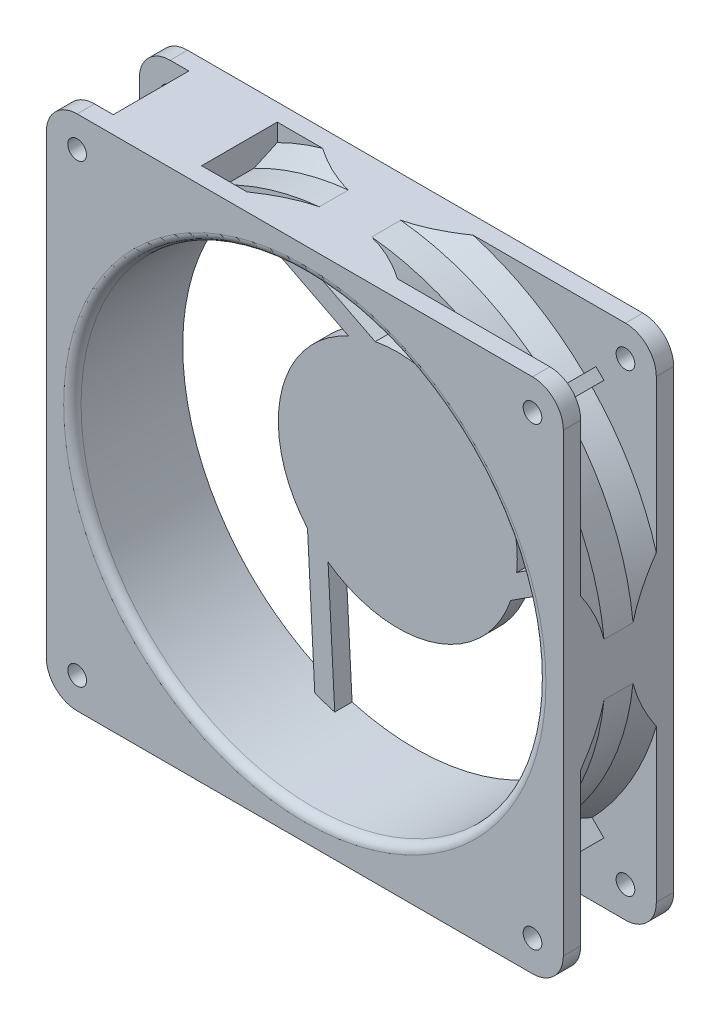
ISO-10303-21;
HEADER;
FILE_DESCRIPTION(('STEP AP214'),'2;1');
FILE_NAME('part.step','',(''),(''),'','','');
FILE_SCHEMA(('AUTOMOTIVE_DESIGN { 1 0 10303 214 1 1 1 1 }'));
ENDSEC;
DATA;
#1=APPLICATION_CONTEXT('core data for automotive mechanical design processes');
#2=APPLICATION_PROTOCOL_DEFINITION('international standard','automotive_design',2000,#1);
#3=PRODUCT_CONTEXT('',#1,'mechanical');
#4=PRODUCT('Part','Part','',(#3));
#5=PRODUCT_RELATED_PRODUCT_CATEGORY('part','',(#4));
#6=PRODUCT_DEFINITION_FORMATION('','',#4);
#7=PRODUCT_DEFINITION_CONTEXT('part definition',#1,'design');
#8=PRODUCT_DEFINITION('design','',#6,#7);
#9=PRODUCT_DEFINITION_SHAPE('','',#8);
#10=(LENGTH_UNIT() NAMED_UNIT(*) SI_UNIT(.MILLI.,.METRE.));
#11=(NAMED_UNIT(*) PLANE_ANGLE_UNIT() SI_UNIT($,.RADIAN.));
#12=(NAMED_UNIT(*) SI_UNIT($,.STERADIAN.) SOLID_ANGLE_UNIT());
#13=UNCERTAINTY_MEASURE_WITH_UNIT(LENGTH_MEASURE(1.E-05),#10,'distance_accuracy_value','');
#14=(GEOMETRIC_REPRESENTATION_CONTEXT(3) GLOBAL_UNCERTAINTY_ASSIGNED_CONTEXT((#13)) GLOBAL_UNIT_ASSIGNED_CONTEXT((#10,
#11,#12)) REPRESENTATION_CONTEXT('',''));
#15=CARTESIAN_POINT('',(0.,0.,0.));
#16=DIRECTION('',(0.,0.,1.));
#17=DIRECTION('',(1.,0.,0.));
#18=AXIS2_PLACEMENT_3D('',#15,#16,#17);
#19=CARTESIAN_POINT('',(0.,0.,193.691413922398));
#20=DIRECTION('',(0.,0.,-1.));
#21=DIRECTION('',(-1.,0.,0.));
#22=AXIS2_PLACEMENT_3D('',#19,#20,#21);
#23=CYLINDRICAL_SURFACE('',#22,53.5);
#24=CARTESIAN_POINT('',(0.,0.,23.4));
#25=DIRECTION('',(0.,0.,1.));
#26=DIRECTION('',(1.,0.,0.));
#27=AXIS2_PLACEMENT_3D('',#24,#25,#26);
#28=CIRCLE('',#27,53.5);
#29=CARTESIAN_POINT('',(53.5,0.,23.4));
#30=VERTEX_POINT('',#29);
#31=EDGE_CURVE('E36',#30,#30,#28,.T.);
#32=ORIENTED_EDGE('',*,*,#31,.T.);
#33=EDGE_LOOP('',(#32));
#34=FACE_BOUND('',#33,.T.);
#35=CARTESIAN_POINT('',(0.,0.,4.));
#36=DIRECTION('',(0.,0.,1.));
#37=DIRECTION('',(-0.499999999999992,0.866025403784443,0.));
#38=AXIS2_PLACEMENT_3D('',#35,#36,#37);
#39=CIRCLE('',#38,53.5);
#40=CARTESIAN_POINT('',(52.8301567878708,8.43946288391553,4.));
#41=VERTEX_POINT('',#40);
#42=CARTESIAN_POINT('',(51.8534442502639,13.1708131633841,4.));
#43=VERTEX_POINT('',#42);
#44=EDGE_CURVE('E2175',#41,#43,#39,.T.);
#45=ORIENTED_EDGE('',*,*,#44,.F.);
#46=DIRECTION('',(0.,0.,-1.));
#47=VECTOR('',#46,1.);
#48=CARTESIAN_POINT('',(52.8301567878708,8.43946288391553,4.));
#49=LINE('',#48,#47);
#50=CARTESIAN_POINT('',(52.8301567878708,8.43946288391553,0.));
#51=VERTEX_POINT('',#50);
#52=EDGE_CURVE('E2184',#41,#51,#49,.T.);
#53=ORIENTED_EDGE('',*,*,#52,.T.);
#54=CARTESIAN_POINT('',(0.,0.,0.));
#55=DIRECTION('',(0.,0.,1.));
#56=DIRECTION('',(1.,0.,0.));
#57=AXIS2_PLACEMENT_3D('',#54,#55,#56);
#58=CIRCLE('',#57,53.5);
#59=CARTESIAN_POINT('',(-14.5204633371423,-51.4918065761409,0.));
#60=VERTEX_POINT('',#59);
#61=EDGE_CURVE('E1127',#60,#51,#58,.T.);
#62=ORIENTED_EDGE('',*,*,#61,.F.);
#63=DIRECTION('',(0.,0.,-1.));
#64=VECTOR('',#63,1.);
#65=CARTESIAN_POINT('',(-14.5204633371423,-51.4918065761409,4.));
#66=LINE('',#65,#64);
#67=CARTESIAN_POINT('',(-14.5204633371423,-51.4918065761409,4.));
#68=VERTEX_POINT('',#67);
#69=EDGE_CURVE('E550',#68,#60,#66,.T.);
#70=ORIENTED_EDGE('',*,*,#69,.F.);
#71=CARTESIAN_POINT('',(0.,0.,4.));
#72=DIRECTION('',(0.,0.,1.));
#73=DIRECTION('',(1.,0.,0.));
#74=AXIS2_PLACEMENT_3D('',#71,#72,#73);
#75=CIRCLE('',#74,53.5);
#76=CARTESIAN_POINT('',(-19.1062891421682,-49.971989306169,4.));
#77=VERTEX_POINT('',#76);
#78=EDGE_CURVE('E544',#77,#68,#75,.T.);
#79=ORIENTED_EDGE('',*,*,#78,.F.);
#80=DIRECTION('',(0.,0.,-1.));
#81=VECTOR('',#80,1.);
#82=CARTESIAN_POINT('',(-19.1062891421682,-49.971989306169,4.));
#83=LINE('',#82,#81);
#84=CARTESIAN_POINT('',(-19.1062891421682,-49.971989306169,0.));
#85=VERTEX_POINT('',#84);
#86=EDGE_CURVE('E553',#77,#85,#83,.T.);
#87=ORIENTED_EDGE('',*,*,#86,.T.);
#88=CARTESIAN_POINT('',(-37.3329809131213,38.3209934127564,0.));
#89=VERTEX_POINT('',#88);
#90=EDGE_CURVE('E1126',#89,#85,#58,.T.);
#91=ORIENTED_EDGE('',*,*,#90,.F.);
#92=DIRECTION('',(0.,0.,-1.));
#93=VECTOR('',#92,1.);
#94=CARTESIAN_POINT('',(-37.3329809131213,38.3209934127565,4.));
#95=LINE('',#94,#93);
#96=CARTESIAN_POINT('',(-37.3329809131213,38.3209934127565,4.));
#97=VERTEX_POINT('',#96);
#98=EDGE_CURVE('E525',#97,#89,#95,.T.);
#99=ORIENTED_EDGE('',*,*,#98,.F.);
#100=CARTESIAN_POINT('',(0.,0.,4.));
#101=DIRECTION('',(0.,0.,1.));
#102=DIRECTION('',(-0.500000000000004,-0.866025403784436,0.));
#103=AXIS2_PLACEMENT_3D('',#100,#101,#102);
#104=CIRCLE('',#103,53.5);
#105=CARTESIAN_POINT('',(-33.7238676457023,41.5325264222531,4.));
#106=VERTEX_POINT('',#105);
#107=EDGE_CURVE('E520',#106,#97,#104,.T.);
#108=ORIENTED_EDGE('',*,*,#107,.F.);
#109=DIRECTION('',(0.,0.,-1.));
#110=VECTOR('',#109,1.);
#111=CARTESIAN_POINT('',(-33.7238676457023,41.5325264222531,4.));
#112=LINE('',#111,#110);
#113=CARTESIAN_POINT('',(-33.7238676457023,41.5325264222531,0.));
#114=VERTEX_POINT('',#113);
#115=EDGE_CURVE('E527',#106,#114,#112,.T.);
#116=ORIENTED_EDGE('',*,*,#115,.T.);
#117=CARTESIAN_POINT('',(51.8534442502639,13.1708131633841,0.));
#118=VERTEX_POINT('',#117);
#119=EDGE_CURVE('E1131',#118,#114,#58,.T.);
#120=ORIENTED_EDGE('',*,*,#119,.F.);
#121=DIRECTION('',(0.,0.,-1.));
#122=VECTOR('',#121,1.);
#123=CARTESIAN_POINT('',(51.8534442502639,13.1708131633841,4.));
#124=LINE('',#123,#122);
#125=EDGE_CURVE('E2182',#43,#118,#124,.T.);
#126=ORIENTED_EDGE('',*,*,#125,.F.);
#127=EDGE_LOOP('',(#45,#53,#62,#70,#79,#87,#91,#99,#108,#116,#120,#126));
#128=FACE_BOUND('',#127,.T.);
#129=ADVANCED_FACE('F28',(#34,#128),#23,.F.);
#130=CARTESIAN_POINT('',(0.,61.9686299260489,21.4));
#131=DIRECTION('',(0.,0.,-1.));
#132=DIRECTION('',(0.,1.,0.));
#133=AXIS2_PLACEMENT_3D('',#130,#131,#132);
#134=PLANE('',#133);
#135=CARTESIAN_POINT('',(-52.3999999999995,52.4000000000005,21.4));
#136=DIRECTION('',(0.,0.,-1.));
#137=DIRECTION('',(0.,1.,0.));
#138=AXIS2_PLACEMENT_3D('',#135,#136,#137);
#139=CIRCLE('',#138,2.15);
#140=CARTESIAN_POINT('',(-52.3999999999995,54.5500000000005,21.4));
#141=VERTEX_POINT('',#140);
#142=EDGE_CURVE('E927',#141,#141,#139,.F.);
#143=ORIENTED_EDGE('',*,*,#142,.T.);
#144=EDGE_LOOP('',(#143));
#145=FACE_BOUND('',#144,.T.);
#146=CARTESIAN_POINT('',(0.,0.,21.4));
#147=DIRECTION('',(0.,0.,1.));
#148=DIRECTION('',(0.,-1.,0.));
#149=AXIS2_PLACEMENT_3D('',#146,#147,#148);
#150=CIRCLE('',#149,61.9686299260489);
#151=CARTESIAN_POINT('',(-32.695305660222,52.6415053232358,21.4));
#152=VERTEX_POINT('',#151);
#153=CARTESIAN_POINT('',(-42.8949743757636,44.7228383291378,21.4));
#154=VERTEX_POINT('',#153);
#155=EDGE_CURVE('E1043',#152,#154,#150,.T.);
#156=ORIENTED_EDGE('',*,*,#155,.T.);
#157=DIRECTION('',(-0.70710678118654,0.707106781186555,0.));
#158=VECTOR('',#157,1.);
#159=CARTESIAN_POINT('',(-30.0703829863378,31.8982469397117,21.4));
#160=LINE('',#159,#158);
#161=CARTESIAN_POINT('',(-45.611762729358,47.4396266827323,21.4));
#162=VERTEX_POINT('',#161);
#163=EDGE_CURVE('E1360',#154,#162,#160,.T.);
#164=ORIENTED_EDGE('',*,*,#163,.T.);
#165=DIRECTION('',(-0.707106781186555,-0.70710678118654,0.));
#166=VECTOR('',#165,1.);
#167=CARTESIAN_POINT('',(-15.5413797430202,77.5100096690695,21.4));
#168=LINE('',#167,#166);
#169=CARTESIAN_POINT('',(-47.4396266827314,45.611762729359,21.4));
#170=VERTEX_POINT('',#169);
#171=EDGE_CURVE('E1355',#162,#170,#168,.T.);
#172=ORIENTED_EDGE('',*,*,#171,.T.);
#173=DIRECTION('',(0.707106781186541,-0.707106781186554,0.));
#174=VECTOR('',#173,1.);
#175=CARTESIAN_POINT('',(-31.8982469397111,30.0703829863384,21.4));
#176=LINE('',#175,#174);
#177=CARTESIAN_POINT('',(-44.7228383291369,42.8949743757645,21.4));
#178=VERTEX_POINT('',#177);
#179=EDGE_CURVE('E2282',#170,#178,#176,.T.);
#180=ORIENTED_EDGE('',*,*,#179,.T.);
#181=CARTESIAN_POINT('',(-59.5,17.3164977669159,21.4));
#182=VERTEX_POINT('',#181);
#183=EDGE_CURVE('E985',#178,#182,#150,.T.);
#184=ORIENTED_EDGE('',*,*,#183,.T.);
#185=DIRECTION('',(0.,1.,0.));
#186=VECTOR('',#185,1.);
#187=CARTESIAN_POINT('',(-59.5,52.4,21.4));
#188=LINE('',#187,#186);
#189=CARTESIAN_POINT('',(-59.5,52.3999999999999,21.4));
#190=VERTEX_POINT('',#189);
#191=EDGE_CURVE('E1206',#182,#190,#188,.T.);
#192=ORIENTED_EDGE('',*,*,#191,.T.);
#193=CARTESIAN_POINT('',(-52.4,52.4,21.4));
#194=DIRECTION('',(0.,0.,-1.));
#195=DIRECTION('',(0.,1.,0.));
#196=AXIS2_PLACEMENT_3D('',#193,#194,#195);
#197=CIRCLE('',#196,7.10000000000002);
#198=CARTESIAN_POINT('',(-52.4000000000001,59.5,21.4));
#199=VERTEX_POINT('',#198);
#200=EDGE_CURVE('E1209',#190,#199,#197,.T.);
#201=ORIENTED_EDGE('',*,*,#200,.T.);
#202=DIRECTION('',(1.,0.,0.));
#203=VECTOR('',#202,1.);
#204=CARTESIAN_POINT('',(52.4000000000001,59.5000000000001,21.4));
#205=LINE('',#204,#203);
#206=CARTESIAN_POINT('',(-48.1,59.5,21.4));
#207=VERTEX_POINT('',#206);
#208=EDGE_CURVE('E1211',#199,#207,#205,.T.);
#209=ORIENTED_EDGE('',*,*,#208,.T.);
#210=DIRECTION('',(0.,1.,0.));
#211=VECTOR('',#210,1.);
#212=CARTESIAN_POINT('',(-48.1,59.5,21.4));
#213=LINE('',#212,#211);
#214=CARTESIAN_POINT('',(-48.1,54.55,21.4));
#215=VERTEX_POINT('',#214);
#216=EDGE_CURVE('E1481',#215,#207,#213,.T.);
#217=ORIENTED_EDGE('',*,*,#216,.F.);
#218=DIRECTION('',(-1.,0.,0.));
#219=VECTOR('',#218,1.);
#220=CARTESIAN_POINT('',(-48.1,54.55,21.4));
#221=LINE('',#220,#219);
#222=CARTESIAN_POINT('',(-32.695305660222,54.55,21.4));
#223=VERTEX_POINT('',#222);
#224=EDGE_CURVE('E1507',#223,#215,#221,.T.);
#225=ORIENTED_EDGE('',*,*,#224,.F.);
#226=DIRECTION('',(0.,1.,0.));
#227=VECTOR('',#226,1.);
#228=CARTESIAN_POINT('',(-32.695305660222,54.55,21.4));
#229=LINE('',#228,#227);
#230=EDGE_CURVE('E1521',#152,#223,#229,.T.);
#231=ORIENTED_EDGE('',*,*,#230,.F.);
#232=EDGE_LOOP('',(#156,#164,#172,#180,#184,#192,#201,#209,#217,#225,#231));
#233=FACE_BOUND('',#232,.T.);
#234=ADVANCED_FACE('F789',(#145,#233),#134,.T.);
#235=CARTESIAN_POINT('',(0.,81.2047906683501,4.00000000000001));
#236=DIRECTION('',(0.,0.,1.));
#237=DIRECTION('',(0.,-1.,0.));
#238=AXIS2_PLACEMENT_3D('',#235,#236,#237);
#239=PLANE('',#238);
#240=CARTESIAN_POINT('',(-52.3999999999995,52.4000000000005,4.00000000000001));
#241=DIRECTION('',(0.,0.,1.));
#242=DIRECTION('',(0.,-1.,0.));
#243=AXIS2_PLACEMENT_3D('',#240,#241,#242);
#244=CIRCLE('',#243,2.15);
#245=CARTESIAN_POINT('',(-52.3999999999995,50.2500000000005,4.00000000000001));
#246=VERTEX_POINT('',#245);
#247=EDGE_CURVE('E924',#246,#246,#244,.F.);
#248=ORIENTED_EDGE('',*,*,#247,.T.);
#249=EDGE_LOOP('',(#248));
#250=FACE_BOUND('',#249,.T.);
#251=DIRECTION('',(0.707106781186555,0.70710678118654,0.));
#252=VECTOR('',#251,1.);
#253=CARTESIAN_POINT('',(-5.92329937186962,87.1280900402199,4.00000000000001));
#254=LINE('',#253,#252);
#255=CARTESIAN_POINT('',(-47.4396266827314,45.611762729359,4.));
#256=VERTEX_POINT('',#255);
#257=CARTESIAN_POINT('',(-45.611762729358,47.4396266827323,4.));
#258=VERTEX_POINT('',#257);
#259=EDGE_CURVE('E769',#256,#258,#254,.T.);
#260=ORIENTED_EDGE('',*,*,#259,.T.);
#261=DIRECTION('',(0.70710678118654,-0.707106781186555,0.));
#262=VECTOR('',#261,1.);
#263=CARTESIAN_POINT('',(-39.6884633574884,41.5163273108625,4.00000000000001));
#264=LINE('',#263,#262);
#265=CARTESIAN_POINT('',(-42.8949743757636,44.7228383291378,4.00000000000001));
#266=VERTEX_POINT('',#265);
#267=EDGE_CURVE('E616',#258,#266,#264,.T.);
#268=ORIENTED_EDGE('',*,*,#267,.T.);
#269=CARTESIAN_POINT('',(0.,0.,4.));
#270=DIRECTION('',(0.,0.,1.));
#271=DIRECTION('',(0.,-1.,0.));
#272=AXIS2_PLACEMENT_3D('',#269,#270,#271);
#273=CIRCLE('',#272,61.9686299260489);
#274=CARTESIAN_POINT('',(-32.695305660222,52.6415053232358,4.00000000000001));
#275=VERTEX_POINT('',#274);
#276=EDGE_CURVE('E963',#275,#266,#273,.T.);
#277=ORIENTED_EDGE('',*,*,#276,.F.);
#278=DIRECTION('',(0.,1.,0.));
#279=VECTOR('',#278,1.);
#280=CARTESIAN_POINT('',(-32.695305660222,81.2047906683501,4.00000000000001));
#281=LINE('',#280,#279);
#282=CARTESIAN_POINT('',(-32.695305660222,54.55,4.));
#283=VERTEX_POINT('',#282);
#284=EDGE_CURVE('E1419',#275,#283,#281,.T.);
#285=ORIENTED_EDGE('',*,*,#284,.T.);
#286=DIRECTION('',(-1.,0.,0.));
#287=VECTOR('',#286,1.);
#288=CARTESIAN_POINT('',(0.,54.55,4.00000000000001));
#289=LINE('',#288,#287);
#290=CARTESIAN_POINT('',(-48.1,54.55,4.));
#291=VERTEX_POINT('',#290);
#292=EDGE_CURVE('E896',#283,#291,#289,.T.);
#293=ORIENTED_EDGE('',*,*,#292,.T.);
#294=DIRECTION('',(0.,1.,0.));
#295=VECTOR('',#294,1.);
#296=CARTESIAN_POINT('',(-48.1,81.2047906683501,4.00000000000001));
#297=LINE('',#296,#295);
#298=CARTESIAN_POINT('',(-48.1,59.5,4.00000000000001));
#299=VERTEX_POINT('',#298);
#300=EDGE_CURVE('E893',#291,#299,#297,.T.);
#301=ORIENTED_EDGE('',*,*,#300,.T.);
#302=DIRECTION('',(-1.,0.,0.));
#303=VECTOR('',#302,1.);
#304=CARTESIAN_POINT('',(52.4000000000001,59.5000000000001,4.));
#305=LINE('',#304,#303);
#306=CARTESIAN_POINT('',(-52.4000000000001,59.5,4.));
#307=VERTEX_POINT('',#306);
#308=EDGE_CURVE('E1011',#299,#307,#305,.T.);
#309=ORIENTED_EDGE('',*,*,#308,.T.);
#310=CARTESIAN_POINT('',(-52.4,52.4,4.));
#311=DIRECTION('',(0.,0.,1.));
#312=DIRECTION('',(0.,-1.,0.));
#313=AXIS2_PLACEMENT_3D('',#310,#311,#312);
#314=CIRCLE('',#313,7.10000000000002);
#315=CARTESIAN_POINT('',(-59.5,52.3999999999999,4.));
#316=VERTEX_POINT('',#315);
#317=EDGE_CURVE('E1010',#307,#316,#314,.T.);
#318=ORIENTED_EDGE('',*,*,#317,.T.);
#319=DIRECTION('',(0.,-1.,0.));
#320=VECTOR('',#319,1.);
#321=CARTESIAN_POINT('',(-59.5,52.4,4.));
#322=LINE('',#321,#320);
#323=CARTESIAN_POINT('',(-59.5,17.316497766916,4.00000000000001));
#324=VERTEX_POINT('',#323);
#325=EDGE_CURVE('E1014',#316,#324,#322,.T.);
#326=ORIENTED_EDGE('',*,*,#325,.T.);
#327=CARTESIAN_POINT('',(-44.7228383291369,42.8949743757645,4.00000000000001));
#328=VERTEX_POINT('',#327);
#329=EDGE_CURVE('E960',#328,#324,#273,.T.);
#330=ORIENTED_EDGE('',*,*,#329,.F.);
#331=DIRECTION('',(-0.707106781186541,0.707106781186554,0.));
#332=VECTOR('',#331,1.);
#333=CARTESIAN_POINT('',(-41.5163273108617,39.6884633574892,4.00000000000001));
#334=LINE('',#333,#332);
#335=EDGE_CURVE('E2281',#328,#256,#334,.T.);
#336=ORIENTED_EDGE('',*,*,#335,.T.);
#337=EDGE_LOOP('',(#260,#268,#277,#285,#293,#301,#309,#318,#326,#330,#336));
#338=FACE_BOUND('',#337,.T.);
#339=ADVANCED_FACE('F794',(#250,#338),#239,.T.);
#340=CARTESIAN_POINT('',(0.,0.,21.4));
#341=DIRECTION('',(0.,0.,1.));
#342=DIRECTION('',(0.,-1.,0.));
#343=AXIS2_PLACEMENT_3D('',#340,#341,#342);
#344=CONICAL_SURFACE('',#343,61.9686299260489,0.383972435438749);
#345=CARTESIAN_POINT('',(0.,0.,16.041884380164));
#346=DIRECTION('',(0.,0.,1.));
#347=DIRECTION('',(0.,-1.,0.));
#348=AXIS2_PLACEMENT_3D('',#345,#346,#347);
#349=CIRCLE('',#348,59.8038106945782);
#350=CARTESIAN_POINT('',(-32.695305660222,50.07507125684,16.041884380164));
#351=VERTEX_POINT('',#350);
#352=CARTESIAN_POINT('',(-41.3638708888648,43.1917348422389,16.041884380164));
#353=VERTEX_POINT('',#352);
#354=EDGE_CURVE('E1428',#351,#353,#349,.T.);
#355=ORIENTED_EDGE('',*,*,#354,.T.);
#356=CARTESIAN_POINT('',(-41.363813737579,43.1916776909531,16.041684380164));
#357=CARTESIAN_POINT('',(-41.6190184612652,43.4468824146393,16.934769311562));
#358=CARTESIAN_POINT('',(-41.8742223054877,43.7020862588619,17.8278547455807));
#359=CARTESIAN_POINT('',(-42.3846282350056,44.2124921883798,19.6140266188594));
#360=CARTESIAN_POINT('',(-42.6398303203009,44.4676942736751,20.5071130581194));
#361=CARTESIAN_POINT('',(-42.8950315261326,44.7228954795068,21.4002));
#362=B_SPLINE_CURVE_WITH_KNOTS('',3,(#356,#357,#358,#359,#360,#361),.UNSPECIFIED.,.F.,.F.,(4,2,
4),(0.,2.88976406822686,5.77952813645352),.UNSPECIFIED.);
#363=EDGE_CURVE('E610',#353,#154,#362,.T.);
#364=ORIENTED_EDGE('',*,*,#363,.T.);
#365=ORIENTED_EDGE('',*,*,#155,.F.);
#366=CARTESIAN_POINT('',(-32.695305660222,61.8798418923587,41.2447066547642));
#367=CARTESIAN_POINT('',(-32.695305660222,60.95605067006,39.2231889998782));
#368=CARTESIAN_POINT('',(-32.695305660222,60.0285976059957,37.2033380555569));
#369=CARTESIAN_POINT('',(-32.695305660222,58.1651564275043,33.1675666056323));
#370=CARTESIAN_POINT('',(-32.695305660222,57.2291682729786,31.1516461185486));
#371=CARTESIAN_POINT('',(-32.695305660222,55.3476382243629,27.1247454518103));
#372=CARTESIAN_POINT('',(-32.695305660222,54.4020982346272,25.1137643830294));
#373=CARTESIAN_POINT('',(-32.695305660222,52.4997490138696,21.0971289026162));
#374=CARTESIAN_POINT('',(-32.695305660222,51.5429397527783,19.0914745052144));
#375=CARTESIAN_POINT('',(-32.695305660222,49.6160670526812,15.08623623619));
#376=CARTESIAN_POINT('',(-32.695305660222,48.646002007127,13.0866531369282));
#377=CARTESIAN_POINT('',(-32.695305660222,46.6904126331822,9.09507559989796));
#378=CARTESIAN_POINT('',(-32.695305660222,45.7048884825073,7.10308107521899));
#379=CARTESIAN_POINT('',(-32.695305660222,44.2126722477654,4.12182326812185));
#380=CARTESIAN_POINT('',(-32.695305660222,43.7128956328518,3.1290962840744));
#381=CARTESIAN_POINT('',(-32.695305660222,42.7082700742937,1.14621367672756));
#382=CARTESIAN_POINT('',(-32.695305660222,42.2034211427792,0.156058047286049));
#383=CARTESIAN_POINT('',(-32.695305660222,41.1881272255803,-1.82143094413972));
#384=CARTESIAN_POINT('',(-32.695305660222,40.6776820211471,-2.80876419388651));
#385=CARTESIAN_POINT('',(-32.695305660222,39.6506047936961,-4.7802172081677));
#386=CARTESIAN_POINT('',(-32.695305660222,39.1339727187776,-5.76433694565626));
#387=CARTESIAN_POINT('',(-32.695305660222,38.6139463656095,-6.74666553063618));
#388=B_SPLINE_CURVE_WITH_KNOTS('',3,(#366,#367,#368,#369,#370,#371,#372,#373,#374,#375,#376,
#377,#378,#379,#380,#381,#382,#383,#384,#385,#386,#387),.UNSPECIFIED.,.F.,.F.,(4,2,2,2,2,2,2,2,
2,2,4),(0.,6.66778724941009,13.3356058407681,20.0021203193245,26.6686525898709,33.336000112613,
40.0032710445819,43.3375584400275,46.6718378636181,50.0062480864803,53.3406863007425),.UNSPECIFIED.);
#389=EDGE_CURVE('E674',#152,#351,#388,.T.);
#390=ORIENTED_EDGE('',*,*,#389,.T.);
#391=EDGE_LOOP('',(#355,#364,#365,#390));
#392=FACE_BOUND('',#391,.T.);
#393=ADVANCED_FACE('F626',(#392),#344,.T.);
#394=ORIENTED_EDGE('',*,*,#183,.F.);
#395=CARTESIAN_POINT('',(-44.722895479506,42.8950315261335,21.4002));
#396=CARTESIAN_POINT('',(-44.4676942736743,42.6398303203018,20.5071130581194));
#397=CARTESIAN_POINT('',(-44.212492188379,42.3846282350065,19.6140266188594));
#398=CARTESIAN_POINT('',(-43.7020862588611,41.8742223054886,17.8278547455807));
#399=CARTESIAN_POINT('',(-43.4468824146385,41.619018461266,16.934769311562));
#400=CARTESIAN_POINT('',(-43.1916776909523,41.3638137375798,16.041684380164));
#401=B_SPLINE_CURVE_WITH_KNOTS('',3,(#395,#396,#397,#398,#399,#400),.UNSPECIFIED.,.F.,.F.,(4,2,
4),(0.,2.88976406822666,5.77952813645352),.UNSPECIFIED.);
#402=CARTESIAN_POINT('',(-43.1917348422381,41.3638708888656,16.041884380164));
#403=VERTEX_POINT('',#402);
#404=EDGE_CURVE('E571',#178,#403,#401,.T.);
#405=ORIENTED_EDGE('',*,*,#404,.T.);
#406=CARTESIAN_POINT('',(-59.5,6.02044629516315,16.041884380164));
#407=VERTEX_POINT('',#406);
#408=EDGE_CURVE('E1034',#403,#407,#349,.T.);
#409=ORIENTED_EDGE('',*,*,#408,.T.);
#410=CARTESIAN_POINT('',(-59.5,-30.3972608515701,33.3951728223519));
#411=CARTESIAN_POINT('',(-59.5,-30.0898999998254,33.0490800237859));
#412=CARTESIAN_POINT('',(-59.5,-29.7804798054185,32.7048193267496));
#413=CARTESIAN_POINT('',(-59.5,-29.1572882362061,32.0202405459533));
#414=CARTESIAN_POINT('',(-59.5,-28.8435167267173,31.6799225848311));
#415=CARTESIAN_POINT('',(-59.5,-27.8951364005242,30.6650983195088));
#416=CARTESIAN_POINT('',(-59.5,-27.2536743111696,29.9969616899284));
#417=CARTESIAN_POINT('',(-59.5,-25.9447725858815,28.6746735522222));
#418=CARTESIAN_POINT('',(-59.5,-25.2771515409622,28.0207012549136));
#419=CARTESIAN_POINT('',(-59.5,-23.9193201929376,26.7367132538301));
#420=CARTESIAN_POINT('',(-59.5,-23.2291123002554,26.1066950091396));
#421=CARTESIAN_POINT('',(-59.5,-21.7968609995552,24.8515338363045));
#422=CARTESIAN_POINT('',(-59.5,-21.0538446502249,24.2274962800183));
#423=CARTESIAN_POINT('',(-59.5,-19.5380174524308,23.0162502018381));
#424=CARTESIAN_POINT('',(-59.5,-18.7652015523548,22.4290479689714));
#425=CARTESIAN_POINT('',(-59.5,-17.1901164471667,21.3015678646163));
#426=CARTESIAN_POINT('',(-59.5,-16.3879638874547,20.7611279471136));
#427=CARTESIAN_POINT('',(-59.5,-14.7497647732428,19.7347491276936));
#428=CARTESIAN_POINT('',(-59.5,-13.9137356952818,19.2487825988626));
#429=CARTESIAN_POINT('',(-59.5,-12.375093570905,18.4323198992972));
#430=CARTESIAN_POINT('',(-59.5,-11.6787314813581,18.0900722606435));
#431=CARTESIAN_POINT('',(-59.5,-10.2635309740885,17.4549159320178));
#432=CARTESIAN_POINT('',(-59.5,-9.5446885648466,17.1620160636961));
#433=CARTESIAN_POINT('',(-59.5,-8.0920478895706,16.6350840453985));
#434=CARTESIAN_POINT('',(-59.5,-7.35841382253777,16.4006026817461));
#435=CARTESIAN_POINT('',(-59.5,-5.87383829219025,15.9945350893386));
#436=CARTESIAN_POINT('',(-59.5,-5.12289797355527,15.8229447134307));
#437=CARTESIAN_POINT('',(-59.5,-3.59789614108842,15.5467554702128));
#438=CARTESIAN_POINT('',(-59.5,-2.82365839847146,15.4431188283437));
#439=CARTESIAN_POINT('',(-59.5,-1.26877180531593,15.3108538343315));
#440=CARTESIAN_POINT('',(-59.5,-0.488123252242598,15.282222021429));
#441=CARTESIAN_POINT('',(-59.5,1.07255260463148,15.3011830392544));
#442=CARTESIAN_POINT('',(-59.5,1.85257953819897,15.3488061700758));
#443=CARTESIAN_POINT('',(-59.5,3.40448864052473,15.5183160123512));
#444=CARTESIAN_POINT('',(-59.5,4.17637006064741,15.6402094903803));
#445=CARTESIAN_POINT('',(-59.5,5.76636323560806,15.9658933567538));
#446=CARTESIAN_POINT('',(-59.5,6.58329636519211,16.1754040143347));
#447=CARTESIAN_POINT('',(-59.5,8.19492157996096,16.6669707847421));
#448=CARTESIAN_POINT('',(-59.5,8.98960991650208,16.9490390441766));
#449=CARTESIAN_POINT('',(-59.5,10.5593773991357,17.578668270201));
#450=CARTESIAN_POINT('',(-59.5,11.3342621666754,17.9267096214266));
#451=CARTESIAN_POINT('',(-59.5,12.8568155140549,18.6774221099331));
#452=CARTESIAN_POINT('',(-59.5,13.6044863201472,19.0800887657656));
#453=CARTESIAN_POINT('',(-59.5,14.9863167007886,19.8813583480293));
#454=CARTESIAN_POINT('',(-59.5,15.6234677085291,20.2748451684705));
#455=CARTESIAN_POINT('',(-59.5,16.8777087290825,21.0927436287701));
#456=CARTESIAN_POINT('',(-59.5,17.4947948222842,21.5171612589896));
#457=CARTESIAN_POINT('',(-59.5,18.7107490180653,22.3931554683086));
#458=CARTESIAN_POINT('',(-59.5,19.3095875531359,22.8447729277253));
#459=CARTESIAN_POINT('',(-59.5,20.4893083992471,23.7708983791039));
#460=CARTESIAN_POINT('',(-59.5,21.0701894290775,24.2454079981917));
#461=CARTESIAN_POINT('',(-59.5,22.1991032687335,25.2005400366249));
#462=CARTESIAN_POINT('',(-59.5,22.7476004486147,25.6806152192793));
#463=CARTESIAN_POINT('',(-59.5,23.8299499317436,26.6570341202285));
#464=CARTESIAN_POINT('',(-59.5,24.3638013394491,27.153378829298));
#465=CARTESIAN_POINT('',(-59.5,25.415668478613,28.1581133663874));
#466=CARTESIAN_POINT('',(-59.5,25.9337420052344,28.6664428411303));
#467=CARTESIAN_POINT('',(-59.5,26.9572902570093,29.6954112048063));
#468=CARTESIAN_POINT('',(-59.5,27.4627678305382,30.2160472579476));
#469=CARTESIAN_POINT('',(-59.5,27.9625027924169,30.7420728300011));
#470=B_SPLINE_CURVE_WITH_KNOTS('',3,(#410,#411,#412,#413,#414,#415,#416,#417,#418,#419,#420,
#421,#422,#423,#424,#425,#426,#427,#428,#429,#430,#431,#432,#433,#434,#435,#436,#437,#438,#439,
#440,#441,#442,#443,#444,#445,#446,#447,#448,#449,#450,#451,#452,#453,#454,#455,#456,#457,#458,
#459,#460,#461,#462,#463,#464,#465,#466,#467,#468,#469),.UNSPECIFIED.,.F.,.F.,(4,2,2,2,2,2,2,2,
2,2,2,2,2,2,2,2,2,2,2,2,2,2,2,2,2,2,2,2,2,4),(0.,1.3886017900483,2.7772466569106,
5.55549794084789,8.3586707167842,11.1615453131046,14.0714784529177,16.9819070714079,
19.8818084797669,22.7802324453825,25.1063610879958,27.4329051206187,29.7409648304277,
32.0488723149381,34.3887918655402,36.7286034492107,39.0693449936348,41.4102998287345,
43.9366069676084,46.4633373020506,49.0092267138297,51.5549073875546,53.8005086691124,
56.0465460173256,58.296047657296,60.5457094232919,62.732101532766,64.9186270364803,
67.0958334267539,69.272542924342),.UNSPECIFIED.);
#471=EDGE_CURVE('E651',#407,#182,#470,.T.);
#472=ORIENTED_EDGE('',*,*,#471,.T.);
#473=EDGE_LOOP('',(#394,#405,#409,#472));
#474=FACE_BOUND('',#473,.T.);
#475=ADVANCED_FACE('F1412',(#474),#344,.T.);
#476=CARTESIAN_POINT('',(0.,0.,9.35811561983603));
#477=DIRECTION('',(0.,0.,-1.));
#478=DIRECTION('',(0.,1.,0.));
#479=AXIS2_PLACEMENT_3D('',#476,#477,#478);
#480=CONICAL_SURFACE('',#479,59.8038106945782,0.383972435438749);
#481=ORIENTED_EDGE('',*,*,#276,.T.);
#482=CARTESIAN_POINT('',(-42.8950315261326,44.7228954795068,3.99980000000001));
#483=CARTESIAN_POINT('',(-42.6398303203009,44.4676942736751,4.89288694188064));
#484=CARTESIAN_POINT('',(-42.3846282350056,44.2124921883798,5.78597338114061));
#485=CARTESIAN_POINT('',(-41.8742223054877,43.7020862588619,7.57214525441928));
#486=CARTESIAN_POINT('',(-41.6190184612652,43.4468824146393,8.46523068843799));
#487=CARTESIAN_POINT('',(-41.363813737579,43.1916776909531,9.35831561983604));
#488=B_SPLINE_CURVE_WITH_KNOTS('',3,(#482,#483,#484,#485,#486,#487),.UNSPECIFIED.,.F.,.F.,(4,2,
4),(0.,2.88976406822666,5.77952813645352),.UNSPECIFIED.);
#489=CARTESIAN_POINT('',(-41.3638708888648,43.1917348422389,9.35811561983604));
#490=VERTEX_POINT('',#489);
#491=EDGE_CURVE('E604',#266,#490,#488,.T.);
#492=ORIENTED_EDGE('',*,*,#491,.T.);
#493=CARTESIAN_POINT('',(0.,0.,9.35811561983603));
#494=DIRECTION('',(0.,0.,1.));
#495=DIRECTION('',(0.,-1.,0.));
#496=AXIS2_PLACEMENT_3D('',#493,#494,#495);
#497=CIRCLE('',#496,59.8038106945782);
#498=CARTESIAN_POINT('',(-32.695305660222,50.07507125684,9.35811561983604));
#499=VERTEX_POINT('',#498);
#500=EDGE_CURVE('E1372',#499,#490,#497,.T.);
#501=ORIENTED_EDGE('',*,*,#500,.F.);
#502=CARTESIAN_POINT('',(-32.695305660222,39.7378276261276,30.0110618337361));
#503=CARTESIAN_POINT('',(-32.695305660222,40.2530594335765,29.0262618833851));
#504=CARTESIAN_POINT('',(-32.695305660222,40.7651434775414,28.03981983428));
#505=CARTESIAN_POINT('',(-32.695305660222,41.7835600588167,26.0639793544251));
#506=CARTESIAN_POINT('',(-32.695305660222,42.2898926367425,25.0745809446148));
#507=CARTESIAN_POINT('',(-32.695305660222,43.2973407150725,23.0931747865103));
#508=CARTESIAN_POINT('',(-32.695305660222,43.7984563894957,22.1011671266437));
#509=CARTESIAN_POINT('',(-32.695305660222,44.7959456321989,20.1147693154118));
#510=CARTESIAN_POINT('',(-32.695305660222,45.2923191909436,19.1203791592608));
#511=CARTESIAN_POINT('',(-32.695305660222,46.7747837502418,16.1343316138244));
#512=CARTESIAN_POINT('',(-32.695305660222,47.754392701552,14.139454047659));
#513=CARTESIAN_POINT('',(-32.695305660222,49.699056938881,10.1426055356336));
#514=CARTESIAN_POINT('',(-32.695305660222,50.6641120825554,8.14063452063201));
#515=CARTESIAN_POINT('',(-32.695305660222,52.5817058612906,4.13097110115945));
#516=CARTESIAN_POINT('',(-32.695305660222,53.5342458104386,2.12327932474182));
#517=CARTESIAN_POINT('',(-32.695305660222,55.4286431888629,-1.89712883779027));
#518=CARTESIAN_POINT('',(-32.695305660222,56.3705006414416,-3.9098452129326));
#519=CARTESIAN_POINT('',(-32.695305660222,58.2451236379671,-7.93992885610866));
#520=CARTESIAN_POINT('',(-32.695305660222,59.1778875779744,-9.95729686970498));
#521=CARTESIAN_POINT('',(-32.695305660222,61.035282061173,-13.9957639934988));
#522=CARTESIAN_POINT('',(-32.695305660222,61.9599126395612,-16.0168630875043));
#523=CARTESIAN_POINT('',(-32.695305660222,62.8810426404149,-18.0395504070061));
#524=B_SPLINE_CURVE_WITH_KNOTS('',3,(#502,#503,#504,#505,#506,#507,#508,#509,#510,#511,#512,
#513,#514,#515,#516,#517,#518,#519,#520,#521,#522,#523),.UNSPECIFIED.,.F.,.F.,(4,2,2,2,2,2,2,2,
2,2,4),(0.,3.33430259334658,6.66858162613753,10.002749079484,13.3369232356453,20.004117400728,
26.6713767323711,33.3379303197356,40.004469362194,46.6721637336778,53.3398292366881),.UNSPECIFIED.);
#525=EDGE_CURVE('E1475',#499,#275,#524,.T.);
#526=ORIENTED_EDGE('',*,*,#525,.T.);
#527=EDGE_LOOP('',(#481,#492,#501,#526));
#528=FACE_BOUND('',#527,.T.);
#529=ADVANCED_FACE('F1403',(#528),#480,.T.);
#530=CARTESIAN_POINT('',(-43.1917348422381,41.3638708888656,9.35811561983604));
#531=VERTEX_POINT('',#530);
#532=CARTESIAN_POINT('',(-59.5,6.02044629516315,9.35811561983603));
#533=VERTEX_POINT('',#532);
#534=EDGE_CURVE('E967',#531,#533,#497,.T.);
#535=ORIENTED_EDGE('',*,*,#534,.F.);
#536=CARTESIAN_POINT('',(-43.1916776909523,41.3638137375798,9.35831561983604));
#537=CARTESIAN_POINT('',(-43.4468824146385,41.619018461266,8.465230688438));
#538=CARTESIAN_POINT('',(-43.7020862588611,41.8742223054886,7.57214525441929));
#539=CARTESIAN_POINT('',(-44.212492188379,42.3846282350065,5.78597338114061));
#540=CARTESIAN_POINT('',(-44.4676942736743,42.6398303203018,4.89288694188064));
#541=CARTESIAN_POINT('',(-44.722895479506,42.8950315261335,3.99980000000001));
#542=B_SPLINE_CURVE_WITH_KNOTS('',3,(#536,#537,#538,#539,#540,#541),.UNSPECIFIED.,.F.,.F.,(4,2,
4),(0.,2.88976406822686,5.77952813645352),.UNSPECIFIED.);
#543=EDGE_CURVE('E563',#531,#328,#542,.T.);
#544=ORIENTED_EDGE('',*,*,#543,.T.);
#545=ORIENTED_EDGE('',*,*,#329,.T.);
#546=CARTESIAN_POINT('',(-59.5,-30.3972608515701,-7.99517282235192));
#547=CARTESIAN_POINT('',(-59.5,-30.0898999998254,-7.64908002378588));
#548=CARTESIAN_POINT('',(-59.5,-29.7804798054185,-7.30481932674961));
#549=CARTESIAN_POINT('',(-59.5,-29.1572882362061,-6.62024054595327));
#550=CARTESIAN_POINT('',(-59.5,-28.8435167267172,-6.27992258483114));
#551=CARTESIAN_POINT('',(-59.5,-27.8951364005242,-5.26509831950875));
#552=CARTESIAN_POINT('',(-59.5,-27.2536743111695,-4.59696168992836));
#553=CARTESIAN_POINT('',(-59.5,-25.9447725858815,-3.27467355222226));
#554=CARTESIAN_POINT('',(-59.5,-25.2771515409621,-2.62070125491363));
#555=CARTESIAN_POINT('',(-59.5,-23.9193201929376,-1.33671325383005));
#556=CARTESIAN_POINT('',(-59.5,-23.2291123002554,-0.706695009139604));
#557=CARTESIAN_POINT('',(-59.5,-21.7968609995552,0.548466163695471));
#558=CARTESIAN_POINT('',(-59.5,-21.0538446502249,1.17250371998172));
#559=CARTESIAN_POINT('',(-59.5,-19.5380174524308,2.38374979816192));
#560=CARTESIAN_POINT('',(-59.5,-18.7652015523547,2.97095203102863));
#561=CARTESIAN_POINT('',(-59.5,-17.1901164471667,4.09843213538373));
#562=CARTESIAN_POINT('',(-59.5,-16.3879638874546,4.63887205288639));
#563=CARTESIAN_POINT('',(-59.5,-14.7497647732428,5.66525087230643));
#564=CARTESIAN_POINT('',(-59.5,-13.9137356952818,6.15121740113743));
#565=CARTESIAN_POINT('',(-59.5,-12.375093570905,6.96768010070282));
#566=CARTESIAN_POINT('',(-59.5,-11.6787314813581,7.30992773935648));
#567=CARTESIAN_POINT('',(-59.5,-10.2635309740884,7.94508406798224));
#568=CARTESIAN_POINT('',(-59.5,-9.54468856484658,8.23798393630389));
#569=CARTESIAN_POINT('',(-59.5,-8.09204788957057,8.7649159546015));
#570=CARTESIAN_POINT('',(-59.5,-7.35841382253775,8.99939731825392));
#571=CARTESIAN_POINT('',(-59.5,-5.87383829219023,9.40546491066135));
#572=CARTESIAN_POINT('',(-59.5,-5.12289797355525,9.57705528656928));
#573=CARTESIAN_POINT('',(-59.5,-3.5978961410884,9.85324452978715));
#574=CARTESIAN_POINT('',(-59.5,-2.82365839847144,9.95688117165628));
#575=CARTESIAN_POINT('',(-59.5,-1.26877180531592,10.0891461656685));
#576=CARTESIAN_POINT('',(-59.5,-0.488123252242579,10.117777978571));
#577=CARTESIAN_POINT('',(-59.5,1.0725526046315,10.0988169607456));
#578=CARTESIAN_POINT('',(-59.5,1.85257953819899,10.0511938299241));
#579=CARTESIAN_POINT('',(-59.5,3.40448864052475,9.88168398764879));
#580=CARTESIAN_POINT('',(-59.5,4.17637006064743,9.75979050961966));
#581=CARTESIAN_POINT('',(-59.5,5.76636323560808,9.43410664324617));
#582=CARTESIAN_POINT('',(-59.5,6.58329636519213,9.22459598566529));
#583=CARTESIAN_POINT('',(-59.5,8.19492157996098,8.73302921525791));
#584=CARTESIAN_POINT('',(-59.5,8.9896099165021,8.4509609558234));
#585=CARTESIAN_POINT('',(-59.5,10.5593773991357,7.821331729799));
#586=CARTESIAN_POINT('',(-59.5,11.3342621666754,7.47329037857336));
#587=CARTESIAN_POINT('',(-59.5,12.856815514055,6.72257789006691));
#588=CARTESIAN_POINT('',(-59.5,13.6044863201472,6.3199112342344));
#589=CARTESIAN_POINT('',(-59.5,14.9863167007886,5.51864165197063));
#590=CARTESIAN_POINT('',(-59.5,15.6234677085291,5.12515483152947));
#591=CARTESIAN_POINT('',(-59.5,16.8777087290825,4.30725637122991));
#592=CARTESIAN_POINT('',(-59.5,17.4947948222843,3.88283874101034));
#593=CARTESIAN_POINT('',(-59.5,18.7107490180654,3.00684453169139));
#594=CARTESIAN_POINT('',(-59.5,19.309587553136,2.55522707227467));
#595=CARTESIAN_POINT('',(-59.5,20.4893083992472,1.62910162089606));
#596=CARTESIAN_POINT('',(-59.5,21.0701894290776,1.15459200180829));
#597=CARTESIAN_POINT('',(-59.5,22.1991032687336,0.199459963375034));
#598=CARTESIAN_POINT('',(-59.5,22.7476004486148,-0.28061521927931));
#599=CARTESIAN_POINT('',(-59.5,23.8299499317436,-1.25703412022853));
#600=CARTESIAN_POINT('',(-59.5,24.3638013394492,-1.75337882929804));
#601=CARTESIAN_POINT('',(-59.5,25.4156684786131,-2.75811336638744));
#602=CARTESIAN_POINT('',(-59.5,25.9337420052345,-3.26644284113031));
#603=CARTESIAN_POINT('',(-59.5,26.9572902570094,-4.29541120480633));
#604=CARTESIAN_POINT('',(-59.5,27.4627678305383,-4.81604725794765));
#605=CARTESIAN_POINT('',(-59.5,27.962502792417,-5.34207283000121));
#606=B_SPLINE_CURVE_WITH_KNOTS('',3,(#546,#547,#548,#549,#550,#551,#552,#553,#554,#555,#556,
#557,#558,#559,#560,#561,#562,#563,#564,#565,#566,#567,#568,#569,#570,#571,#572,#573,#574,#575,
#576,#577,#578,#579,#580,#581,#582,#583,#584,#585,#586,#587,#588,#589,#590,#591,#592,#593,#594,
#595,#596,#597,#598,#599,#600,#601,#602,#603,#604,#605),.UNSPECIFIED.,.F.,.F.,(4,2,2,2,2,2,2,2,
2,2,2,2,2,2,2,2,2,2,2,2,2,2,2,2,2,2,2,2,2,4),(0.,1.3886017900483,2.7772466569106,
5.55549794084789,8.3586707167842,11.1615453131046,14.0714784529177,16.9819070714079,
19.8818084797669,22.7802324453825,25.1063610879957,27.4329051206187,29.7409648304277,
32.0488723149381,34.3887918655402,36.7286034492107,39.0693449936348,41.4102998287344,
43.9366069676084,46.4633373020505,49.0092267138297,51.5549073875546,53.8005086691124,
56.0465460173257,58.296047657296,60.5457094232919,62.732101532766,64.9186270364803,
67.0958334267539,69.272542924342),.UNSPECIFIED.);
#607=EDGE_CURVE('E816',#324,#533,#606,.F.);
#608=ORIENTED_EDGE('',*,*,#607,.T.);
#609=EDGE_LOOP('',(#535,#544,#545,#608));
#610=FACE_BOUND('',#609,.T.);
#611=ADVANCED_FACE('F1395',(#610),#480,.T.);
#612=CARTESIAN_POINT('',(0.,0.,25.4));
#613=DIRECTION('',(0.,0.,1.));
#614=DIRECTION('',(0.,-1.,0.));
#615=AXIS2_PLACEMENT_3D('',#612,#613,#614);
#616=CYLINDRICAL_SURFACE('',#615,59.8038106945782);
#617=ORIENTED_EDGE('',*,*,#500,.T.);
#618=DIRECTION('',(0.,0.,1.));
#619=VECTOR('',#618,1.);
#620=CARTESIAN_POINT('',(-41.3638708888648,43.1917348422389,25.4));
#621=LINE('',#620,#619);
#622=EDGE_CURVE('E766',#490,#353,#621,.T.);
#623=ORIENTED_EDGE('',*,*,#622,.T.);
#624=ORIENTED_EDGE('',*,*,#354,.F.);
#625=DIRECTION('',(0.,0.,1.));
#626=VECTOR('',#625,1.);
#627=CARTESIAN_POINT('',(-32.695305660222,50.07507125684,25.4));
#628=LINE('',#627,#626);
#629=EDGE_CURVE('E884',#351,#499,#628,.F.);
#630=ORIENTED_EDGE('',*,*,#629,.T.);
#631=EDGE_LOOP('',(#617,#623,#624,#630));
#632=FACE_BOUND('',#631,.T.);
#633=ADVANCED_FACE('F1405',(#632),#616,.T.);
#634=ORIENTED_EDGE('',*,*,#408,.F.);
#635=DIRECTION('',(0.,0.,1.));
#636=VECTOR('',#635,1.);
#637=CARTESIAN_POINT('',(-43.1917348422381,41.3638708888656,25.4));
#638=LINE('',#637,#636);
#639=EDGE_CURVE('E763',#403,#531,#638,.F.);
#640=ORIENTED_EDGE('',*,*,#639,.T.);
#641=ORIENTED_EDGE('',*,*,#534,.T.);
#642=DIRECTION('',(0.,0.,1.));
#643=VECTOR('',#642,1.);
#644=CARTESIAN_POINT('',(-59.5,6.02044629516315,25.4));
#645=LINE('',#644,#643);
#646=EDGE_CURVE('E1102',#533,#407,#645,.T.);
#647=ORIENTED_EDGE('',*,*,#646,.T.);
#648=EDGE_LOOP('',(#634,#640,#641,#647));
#649=FACE_BOUND('',#648,.T.);
#650=ADVANCED_FACE('F1410',(#649),#616,.T.);
#651=CARTESIAN_POINT('',(-52.4000000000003,-52.3999999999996,21.4));
#652=DIRECTION('',(0.,0.,-1.));
#653=DIRECTION('',(0.,1.,0.));
#654=AXIS2_PLACEMENT_3D('',#651,#652,#653);
#655=CIRCLE('',#654,2.15);
#656=CARTESIAN_POINT('',(-52.4000000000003,-50.2499999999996,21.4));
#657=VERTEX_POINT('',#656);
#658=EDGE_CURVE('E922',#657,#657,#655,.F.);
#659=ORIENTED_EDGE('',*,*,#658,.T.);
#660=EDGE_LOOP('',(#659));
#661=FACE_BOUND('',#660,.T.);
#662=CARTESIAN_POINT('',(-59.5,-17.3164977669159,21.4));
#663=VERTEX_POINT('',#662);
#664=CARTESIAN_POINT('',(-44.7228383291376,-42.8949743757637,21.4));
#665=VERTEX_POINT('',#664);
#666=EDGE_CURVE('E983',#663,#665,#150,.T.);
#667=ORIENTED_EDGE('',*,*,#666,.T.);
#668=DIRECTION('',(-0.707106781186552,-0.707106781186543,0.));
#669=VECTOR('',#668,1.);
#670=CARTESIAN_POINT('',(30.0703829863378,31.8982469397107,21.4));
#671=LINE('',#670,#669);
#672=CARTESIAN_POINT('',(-47.4396266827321,-45.6117627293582,21.4));
#673=VERTEX_POINT('',#672);
#674=EDGE_CURVE('E734',#665,#673,#671,.T.);
#675=ORIENTED_EDGE('',*,*,#674,.T.);
#676=DIRECTION('',(0.707106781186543,-0.707106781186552,0.));
#677=VECTOR('',#676,1.);
#678=CARTESIAN_POINT('',(-77.5100096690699,-15.5413797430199,21.4));
#679=LINE('',#678,#677);
#680=CARTESIAN_POINT('',(-45.6117627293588,-47.4396266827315,21.4));
#681=VERTEX_POINT('',#680);
#682=EDGE_CURVE('E1343',#673,#681,#679,.T.);
#683=ORIENTED_EDGE('',*,*,#682,.T.);
#684=DIRECTION('',(0.707106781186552,0.707106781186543,0.));
#685=VECTOR('',#684,1.);
#686=CARTESIAN_POINT('',(31.8982469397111,30.0703829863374,21.4));
#687=LINE('',#686,#685);
#688=CARTESIAN_POINT('',(-42.8949743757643,-44.7228383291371,21.4));
#689=VERTEX_POINT('',#688);
#690=EDGE_CURVE('E1346',#681,#689,#687,.T.);
#691=ORIENTED_EDGE('',*,*,#690,.T.);
#692=CARTESIAN_POINT('',(-17.316497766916,-59.5,21.4));
#693=VERTEX_POINT('',#692);
#694=EDGE_CURVE('E979',#689,#693,#150,.T.);
#695=ORIENTED_EDGE('',*,*,#694,.T.);
#696=DIRECTION('',(-1.,0.,0.));
#697=VECTOR('',#696,1.);
#698=CARTESIAN_POINT('',(-52.4,-59.5,21.4));
#699=LINE('',#698,#697);
#700=CARTESIAN_POINT('',(-52.4,-59.5,21.4));
#701=VERTEX_POINT('',#700);
#702=EDGE_CURVE('E1200',#693,#701,#699,.T.);
#703=ORIENTED_EDGE('',*,*,#702,.T.);
#704=CARTESIAN_POINT('',(-52.4,-52.4,21.4));
#705=DIRECTION('',(0.,0.,-1.));
#706=DIRECTION('',(0.,1.,0.));
#707=AXIS2_PLACEMENT_3D('',#704,#705,#706);
#708=CIRCLE('',#707,7.10000000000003);
#709=CARTESIAN_POINT('',(-59.5,-52.4,21.4));
#710=VERTEX_POINT('',#709);
#711=EDGE_CURVE('E1205',#701,#710,#708,.T.);
#712=ORIENTED_EDGE('',*,*,#711,.T.);
#713=EDGE_CURVE('E1059',#710,#663,#188,.T.);
#714=ORIENTED_EDGE('',*,*,#713,.T.);
#715=EDGE_LOOP('',(#667,#675,#683,#691,#695,#703,#712,#714));
#716=FACE_BOUND('',#715,.T.);
#717=ADVANCED_FACE('F628',(#661,#716),#134,.T.);
#718=CARTESIAN_POINT('',(-52.4000000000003,-52.3999999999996,3.99999999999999));
#719=DIRECTION('',(0.,0.,1.));
#720=DIRECTION('',(0.,-1.,0.));
#721=AXIS2_PLACEMENT_3D('',#718,#719,#720);
#722=CIRCLE('',#721,2.15);
#723=CARTESIAN_POINT('',(-52.4000000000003,-54.5499999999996,3.99999999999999));
#724=VERTEX_POINT('',#723);
#725=EDGE_CURVE('E919',#724,#724,#722,.F.);
#726=ORIENTED_EDGE('',*,*,#725,.T.);
#727=EDGE_LOOP('',(#726));
#728=FACE_BOUND('',#727,.T.);
#729=DIRECTION('',(-0.707106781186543,0.707106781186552,0.));
#730=VECTOR('',#729,1.);
#731=CARTESIAN_POINT('',(-87.1280900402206,-5.92329937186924,4.));
#732=LINE('',#731,#730);
#733=CARTESIAN_POINT('',(-45.6117627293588,-47.4396266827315,4.));
#734=VERTEX_POINT('',#733);
#735=CARTESIAN_POINT('',(-47.4396266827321,-45.6117627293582,4.));
#736=VERTEX_POINT('',#735);
#737=EDGE_CURVE('E755',#734,#736,#732,.T.);
#738=ORIENTED_EDGE('',*,*,#737,.T.);
#739=DIRECTION('',(0.707106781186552,0.707106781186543,0.));
#740=VECTOR('',#739,1.);
#741=CARTESIAN_POINT('',(39.6884633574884,41.5163273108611,4.00000000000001));
#742=LINE('',#741,#740);
#743=CARTESIAN_POINT('',(-44.7228383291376,-42.8949743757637,4.));
#744=VERTEX_POINT('',#743);
#745=EDGE_CURVE('E735',#736,#744,#742,.T.);
#746=ORIENTED_EDGE('',*,*,#745,.T.);
#747=CARTESIAN_POINT('',(-59.5,-17.3164977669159,4.));
#748=VERTEX_POINT('',#747);
#749=EDGE_CURVE('E956',#748,#744,#273,.T.);
#750=ORIENTED_EDGE('',*,*,#749,.F.);
#751=CARTESIAN_POINT('',(-59.5,-52.4,3.99999999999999));
#752=VERTEX_POINT('',#751);
#753=EDGE_CURVE('E1220',#748,#752,#322,.T.);
#754=ORIENTED_EDGE('',*,*,#753,.T.);
#755=CARTESIAN_POINT('',(-52.4,-52.4,3.99999999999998));
#756=DIRECTION('',(0.,0.,1.));
#757=DIRECTION('',(0.,-1.,0.));
#758=AXIS2_PLACEMENT_3D('',#755,#756,#757);
#759=CIRCLE('',#758,7.10000000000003);
#760=CARTESIAN_POINT('',(-52.4,-59.5,3.99999999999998));
#761=VERTEX_POINT('',#760);
#762=EDGE_CURVE('E1218',#752,#761,#759,.T.);
#763=ORIENTED_EDGE('',*,*,#762,.T.);
#764=DIRECTION('',(1.,0.,0.));
#765=VECTOR('',#764,1.);
#766=CARTESIAN_POINT('',(-52.4,-59.5,3.99999999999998));
#767=LINE('',#766,#765);
#768=CARTESIAN_POINT('',(-17.316497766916,-59.5,4.));
#769=VERTEX_POINT('',#768);
#770=EDGE_CURVE('E954',#761,#769,#767,.T.);
#771=ORIENTED_EDGE('',*,*,#770,.T.);
#772=CARTESIAN_POINT('',(-42.8949743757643,-44.7228383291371,4.));
#773=VERTEX_POINT('',#772);
#774=EDGE_CURVE('E944',#773,#769,#273,.T.);
#775=ORIENTED_EDGE('',*,*,#774,.F.);
#776=DIRECTION('',(-0.707106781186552,-0.707106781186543,0.));
#777=VECTOR('',#776,1.);
#778=CARTESIAN_POINT('',(41.5163273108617,39.6884633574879,4.00000000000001));
#779=LINE('',#778,#777);
#780=EDGE_CURVE('E952',#773,#734,#779,.T.);
#781=ORIENTED_EDGE('',*,*,#780,.T.);
#782=EDGE_LOOP('',(#738,#746,#750,#754,#763,#771,#775,#781));
#783=FACE_BOUND('',#782,.T.);
#784=ADVANCED_FACE('F951',(#728,#783),#239,.T.);
#785=CARTESIAN_POINT('',(-59.5,-6.02044629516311,9.35811561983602));
#786=VERTEX_POINT('',#785);
#787=CARTESIAN_POINT('',(-43.1917348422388,-41.3638708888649,9.35811561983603));
#788=VERTEX_POINT('',#787);
#789=EDGE_CURVE('E1370',#786,#788,#497,.T.);
#790=ORIENTED_EDGE('',*,*,#789,.T.);
#791=DIRECTION('',(0.,0.,1.));
#792=VECTOR('',#791,1.);
#793=CARTESIAN_POINT('',(-43.1917348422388,-41.3638708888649,25.4));
#794=LINE('',#793,#792);
#795=CARTESIAN_POINT('',(-43.1917348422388,-41.3638708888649,16.041884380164));
#796=VERTEX_POINT('',#795);
#797=EDGE_CURVE('E1365',#788,#796,#794,.T.);
#798=ORIENTED_EDGE('',*,*,#797,.T.);
#799=CARTESIAN_POINT('',(-59.5,-6.02044629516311,16.041884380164));
#800=VERTEX_POINT('',#799);
#801=EDGE_CURVE('E1041',#800,#796,#349,.T.);
#802=ORIENTED_EDGE('',*,*,#801,.F.);
#803=DIRECTION('',(0.,0.,1.));
#804=VECTOR('',#803,1.);
#805=CARTESIAN_POINT('',(-59.5,-6.02044629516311,25.4));
#806=LINE('',#805,#804);
#807=EDGE_CURVE('E1072',#800,#786,#806,.F.);
#808=ORIENTED_EDGE('',*,*,#807,.T.);
#809=EDGE_LOOP('',(#790,#798,#802,#808));
#810=FACE_BOUND('',#809,.T.);
#811=ADVANCED_FACE('F629',(#810),#616,.T.);
#812=CARTESIAN_POINT('',(-41.3638708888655,-43.1917348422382,16.041884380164));
#813=VERTEX_POINT('',#812);
#814=CARTESIAN_POINT('',(-6.0204462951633,-59.5,16.0418843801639));
#815=VERTEX_POINT('',#814);
#816=EDGE_CURVE('E1038',#813,#815,#349,.T.);
#817=ORIENTED_EDGE('',*,*,#816,.F.);
#818=DIRECTION('',(0.,0.,1.));
#819=VECTOR('',#818,1.);
#820=CARTESIAN_POINT('',(-41.3638708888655,-43.1917348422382,25.4));
#821=LINE('',#820,#819);
#822=CARTESIAN_POINT('',(-41.3638708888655,-43.1917348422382,9.35811561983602));
#823=VERTEX_POINT('',#822);
#824=EDGE_CURVE('E1357',#813,#823,#821,.F.);
#825=ORIENTED_EDGE('',*,*,#824,.T.);
#826=CARTESIAN_POINT('',(-6.0204462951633,-59.5,9.35811561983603));
#827=VERTEX_POINT('',#826);
#828=EDGE_CURVE('E946',#823,#827,#497,.T.);
#829=ORIENTED_EDGE('',*,*,#828,.T.);
#830=DIRECTION('',(0.,0.,1.));
#831=VECTOR('',#830,1.);
#832=CARTESIAN_POINT('',(-6.0204462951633,-59.5,25.4));
#833=LINE('',#832,#831);
#834=EDGE_CURVE('E1092',#827,#815,#833,.T.);
#835=ORIENTED_EDGE('',*,*,#834,.T.);
#836=EDGE_LOOP('',(#817,#825,#829,#835));
#837=FACE_BOUND('',#836,.T.);
#838=ADVANCED_FACE('F1583',(#837),#616,.T.);
#839=ORIENTED_EDGE('',*,*,#801,.T.);
#840=CARTESIAN_POINT('',(-43.191677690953,-41.3638137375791,16.041684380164));
#841=CARTESIAN_POINT('',(-43.4468824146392,-41.6190184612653,16.934769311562));
#842=CARTESIAN_POINT('',(-43.7020862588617,-41.8742223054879,17.8278547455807));
#843=CARTESIAN_POINT('',(-44.2124921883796,-42.3846282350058,19.6140266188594));
#844=CARTESIAN_POINT('',(-44.467694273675,-42.6398303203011,20.5071130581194));
#845=CARTESIAN_POINT('',(-44.7228954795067,-42.8950315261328,21.4002));
#846=B_SPLINE_CURVE_WITH_KNOTS('',3,(#840,#841,#842,#843,#844,#845),.UNSPECIFIED.,.F.,.F.,(4,2,
4),(0.,2.88976406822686,5.77952813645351),.UNSPECIFIED.);
#847=EDGE_CURVE('E726',#796,#665,#846,.T.);
#848=ORIENTED_EDGE('',*,*,#847,.T.);
#849=ORIENTED_EDGE('',*,*,#666,.F.);
#850=EDGE_CURVE('E1064',#663,#800,#470,.T.);
#851=ORIENTED_EDGE('',*,*,#850,.T.);
#852=EDGE_LOOP('',(#839,#848,#849,#851));
#853=FACE_BOUND('',#852,.T.);
#854=ADVANCED_FACE('F1063',(#853),#344,.T.);
#855=ORIENTED_EDGE('',*,*,#694,.F.);
#856=CARTESIAN_POINT('',(-42.8950315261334,-44.7228954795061,21.4002));
#857=CARTESIAN_POINT('',(-42.6398303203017,-44.4676942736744,20.5071130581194));
#858=CARTESIAN_POINT('',(-42.3846282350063,-44.2124921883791,19.6140266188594));
#859=CARTESIAN_POINT('',(-41.8742223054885,-43.7020862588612,17.8278547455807));
#860=CARTESIAN_POINT('',(-41.6190184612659,-43.4468824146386,16.934769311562));
#861=CARTESIAN_POINT('',(-41.3638137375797,-43.1916776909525,16.041684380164));
#862=B_SPLINE_CURVE_WITH_KNOTS('',3,(#856,#857,#858,#859,#860,#861),.UNSPECIFIED.,.F.,.F.,(4,2,
4),(0.,2.88976406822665,5.77952813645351),.UNSPECIFIED.);
#863=EDGE_CURVE('E719',#689,#813,#862,.T.);
#864=ORIENTED_EDGE('',*,*,#863,.T.);
#865=ORIENTED_EDGE('',*,*,#816,.T.);
#866=CARTESIAN_POINT('',(-30.3972608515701,-59.5,33.3951728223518));
#867=CARTESIAN_POINT('',(-30.0898999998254,-59.5,33.0490800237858));
#868=CARTESIAN_POINT('',(-29.7804798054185,-59.5,32.7048193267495));
#869=CARTESIAN_POINT('',(-29.1572882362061,-59.5,32.0202405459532));
#870=CARTESIAN_POINT('',(-28.8435167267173,-59.5,31.6799225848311));
#871=CARTESIAN_POINT('',(-27.8951364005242,-59.5,30.6650983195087));
#872=CARTESIAN_POINT('',(-27.2536743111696,-59.5,29.9969616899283));
#873=CARTESIAN_POINT('',(-25.9447725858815,-59.5,28.6746735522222));
#874=CARTESIAN_POINT('',(-25.2771515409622,-59.5,28.0207012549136));
#875=CARTESIAN_POINT('',(-23.9193201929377,-59.5,26.73671325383));
#876=CARTESIAN_POINT('',(-23.2291123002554,-59.5,26.1066950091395));
#877=CARTESIAN_POINT('',(-21.7968609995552,-59.5,24.8515338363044));
#878=CARTESIAN_POINT('',(-21.0538446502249,-59.5,24.2274962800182));
#879=CARTESIAN_POINT('',(-19.5380174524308,-59.5,23.016250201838));
#880=CARTESIAN_POINT('',(-18.7652015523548,-59.5,22.4290479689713));
#881=CARTESIAN_POINT('',(-17.1901164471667,-59.5,21.3015678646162));
#882=CARTESIAN_POINT('',(-16.3879638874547,-59.5,20.7611279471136));
#883=CARTESIAN_POINT('',(-14.7497647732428,-59.5,19.7347491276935));
#884=CARTESIAN_POINT('',(-13.9137356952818,-59.5,19.2487825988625));
#885=CARTESIAN_POINT('',(-12.375093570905,-59.5,18.4323198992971));
#886=CARTESIAN_POINT('',(-11.6787314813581,-59.5,18.0900722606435));
#887=CARTESIAN_POINT('',(-10.2635309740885,-59.5,17.4549159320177));
#888=CARTESIAN_POINT('',(-9.54468856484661,-59.5,17.162016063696));
#889=CARTESIAN_POINT('',(-8.09204788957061,-59.5,16.6350840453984));
#890=CARTESIAN_POINT('',(-7.35841382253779,-59.5,16.400602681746));
#891=CARTESIAN_POINT('',(-5.87383829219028,-59.5,15.9945350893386));
#892=CARTESIAN_POINT('',(-5.1228979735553,-59.5,15.8229447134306));
#893=CARTESIAN_POINT('',(-3.59789614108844,-59.5,15.5467554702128));
#894=CARTESIAN_POINT('',(-2.82365839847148,-59.5,15.4431188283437));
#895=CARTESIAN_POINT('',(-1.26877180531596,-59.5,15.3108538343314));
#896=CARTESIAN_POINT('',(-0.488123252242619,-59.5,15.2822220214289));
#897=CARTESIAN_POINT('',(1.07255260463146,-59.5,15.3011830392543));
#898=CARTESIAN_POINT('',(1.85257953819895,-59.5,15.3488061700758));
#899=CARTESIAN_POINT('',(3.40448864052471,-59.5,15.5183160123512));
#900=CARTESIAN_POINT('',(4.17637006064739,-59.5,15.6402094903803));
#901=CARTESIAN_POINT('',(5.76636323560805,-59.5,15.9658933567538));
#902=CARTESIAN_POINT('',(6.5832963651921,-59.5,16.1754040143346));
#903=CARTESIAN_POINT('',(8.19492157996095,-59.5,16.666970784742));
#904=CARTESIAN_POINT('',(8.98960991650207,-59.5,16.9490390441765));
#905=CARTESIAN_POINT('',(10.5593773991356,-59.5,17.5786682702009));
#906=CARTESIAN_POINT('',(11.3342621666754,-59.5,17.9267096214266));
#907=CARTESIAN_POINT('',(12.8568155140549,-59.5,18.677422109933));
#908=CARTESIAN_POINT('',(13.6044863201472,-59.5,19.0800887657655));
#909=CARTESIAN_POINT('',(14.9863167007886,-59.5,19.8813583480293));
#910=CARTESIAN_POINT('',(15.6234677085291,-59.5,20.2748451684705));
#911=CARTESIAN_POINT('',(16.8777087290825,-59.5,21.09274362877));
#912=CARTESIAN_POINT('',(17.4947948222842,-59.5,21.5171612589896));
#913=CARTESIAN_POINT('',(18.7107490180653,-59.5,22.3931554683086));
#914=CARTESIAN_POINT('',(19.3095875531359,-59.5,22.8447729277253));
#915=CARTESIAN_POINT('',(20.4893083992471,-59.5,23.7708983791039));
#916=CARTESIAN_POINT('',(21.0701894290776,-59.5,24.2454079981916));
#917=CARTESIAN_POINT('',(22.1991032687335,-59.5,25.2005400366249));
#918=CARTESIAN_POINT('',(22.7476004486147,-59.5,25.6806152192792));
#919=CARTESIAN_POINT('',(23.8299499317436,-59.5,26.6570341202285));
#920=CARTESIAN_POINT('',(24.3638013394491,-59.5,27.153378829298));
#921=CARTESIAN_POINT('',(25.4156684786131,-59.5,28.1581133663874));
#922=CARTESIAN_POINT('',(25.9337420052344,-59.5,28.6664428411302));
#923=CARTESIAN_POINT('',(26.9572902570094,-59.5,29.6954112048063));
#924=CARTESIAN_POINT('',(27.4627678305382,-59.5,30.2160472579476));
#925=CARTESIAN_POINT('',(27.9625027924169,-59.5,30.7420728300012));
#926=B_SPLINE_CURVE_WITH_KNOTS('',3,(#866,#867,#868,#869,#870,#871,#872,#873,#874,#875,#876,
#877,#878,#879,#880,#881,#882,#883,#884,#885,#886,#887,#888,#889,#890,#891,#892,#893,#894,#895,
#896,#897,#898,#899,#900,#901,#902,#903,#904,#905,#906,#907,#908,#909,#910,#911,#912,#913,#914,
#915,#916,#917,#918,#919,#920,#921,#922,#923,#924,#925),.UNSPECIFIED.,.F.,.F.,(4,2,2,2,2,2,2,2,
2,2,2,2,2,2,2,2,2,2,2,2,2,2,2,2,2,2,2,2,2,4),(0.,1.38860179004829,2.7772466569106,
5.55549794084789,8.35867071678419,11.1615453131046,14.0714784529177,16.9819070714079,
19.8818084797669,22.7802324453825,25.1063610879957,27.4329051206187,29.7409648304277,
32.0488723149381,34.3887918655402,36.7286034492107,39.0693449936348,41.4102998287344,
43.9366069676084,46.4633373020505,49.0092267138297,51.5549073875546,53.8005086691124,
56.0465460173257,58.296047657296,60.5457094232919,62.732101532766,64.9186270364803,
67.0958334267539,69.272542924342),.UNSPECIFIED.);
#927=EDGE_CURVE('E658',#815,#693,#926,.F.);
#928=ORIENTED_EDGE('',*,*,#927,.T.);
#929=EDGE_LOOP('',(#855,#864,#865,#928));
#930=FACE_BOUND('',#929,.T.);
#931=ADVANCED_FACE('F1402',(#930),#344,.T.);
#932=ORIENTED_EDGE('',*,*,#749,.T.);
#933=CARTESIAN_POINT('',(-44.7228954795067,-42.8950315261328,3.99980000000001));
#934=CARTESIAN_POINT('',(-44.467694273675,-42.6398303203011,4.89288694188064));
#935=CARTESIAN_POINT('',(-44.2124921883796,-42.3846282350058,5.7859733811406));
#936=CARTESIAN_POINT('',(-43.7020862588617,-41.8742223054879,7.57214525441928));
#937=CARTESIAN_POINT('',(-43.4468824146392,-41.6190184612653,8.46523068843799));
#938=CARTESIAN_POINT('',(-43.191677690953,-41.3638137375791,9.35831561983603));
#939=B_SPLINE_CURVE_WITH_KNOTS('',3,(#933,#934,#935,#936,#937,#938),.UNSPECIFIED.,.F.,.F.,(4,2,
4),(0.,2.88976406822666,5.77952813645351),.UNSPECIFIED.);
#940=EDGE_CURVE('E748',#744,#788,#939,.T.);
#941=ORIENTED_EDGE('',*,*,#940,.T.);
#942=ORIENTED_EDGE('',*,*,#789,.F.);
#943=EDGE_CURVE('E817',#786,#748,#606,.F.);
#944=ORIENTED_EDGE('',*,*,#943,.T.);
#945=EDGE_LOOP('',(#932,#941,#942,#944));
#946=FACE_BOUND('',#945,.T.);
#947=ADVANCED_FACE('F577',(#946),#480,.T.);
#948=ORIENTED_EDGE('',*,*,#828,.F.);
#949=CARTESIAN_POINT('',(-41.3638137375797,-43.1916776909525,9.35831561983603));
#950=CARTESIAN_POINT('',(-41.6190184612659,-43.4468824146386,8.46523068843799));
#951=CARTESIAN_POINT('',(-41.8742223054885,-43.7020862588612,7.57214525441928));
#952=CARTESIAN_POINT('',(-42.3846282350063,-44.2124921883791,5.7859733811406));
#953=CARTESIAN_POINT('',(-42.6398303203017,-44.4676942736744,4.89288694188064));
#954=CARTESIAN_POINT('',(-42.8950315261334,-44.7228954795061,3.99980000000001));
#955=B_SPLINE_CURVE_WITH_KNOTS('',3,(#949,#950,#951,#952,#953,#954),.UNSPECIFIED.,.F.,.F.,(4,2,
4),(0.,2.88976406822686,5.77952813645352),.UNSPECIFIED.);
#956=EDGE_CURVE('E756',#823,#773,#955,.T.);
#957=ORIENTED_EDGE('',*,*,#956,.T.);
#958=ORIENTED_EDGE('',*,*,#774,.T.);
#959=CARTESIAN_POINT('',(-30.3972608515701,-59.5,-7.99517282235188));
#960=CARTESIAN_POINT('',(-30.0898999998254,-59.5,-7.64908002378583));
#961=CARTESIAN_POINT('',(-29.7804798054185,-59.5,-7.30481932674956));
#962=CARTESIAN_POINT('',(-29.1572882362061,-59.5,-6.62024054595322));
#963=CARTESIAN_POINT('',(-28.8435167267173,-59.5,-6.27992258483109));
#964=CARTESIAN_POINT('',(-27.8951364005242,-59.5,-5.26509831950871));
#965=CARTESIAN_POINT('',(-27.2536743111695,-59.5,-4.59696168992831));
#966=CARTESIAN_POINT('',(-25.9447725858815,-59.5,-3.2746735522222));
#967=CARTESIAN_POINT('',(-25.2771515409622,-59.5,-2.62070125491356));
#968=CARTESIAN_POINT('',(-23.9193201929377,-59.5,-1.33671325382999));
#969=CARTESIAN_POINT('',(-23.2291123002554,-59.5,-0.706695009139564));
#970=CARTESIAN_POINT('',(-21.7968609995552,-59.5,0.548466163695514));
#971=CARTESIAN_POINT('',(-21.0538446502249,-59.5,1.17250371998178));
#972=CARTESIAN_POINT('',(-19.5380174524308,-59.5,2.38374979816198));
#973=CARTESIAN_POINT('',(-18.7652015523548,-59.5,2.97095203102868));
#974=CARTESIAN_POINT('',(-17.1901164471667,-59.5,4.09843213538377));
#975=CARTESIAN_POINT('',(-16.3879638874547,-59.5,4.63887205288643));
#976=CARTESIAN_POINT('',(-14.7497647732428,-59.5,5.66525087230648));
#977=CARTESIAN_POINT('',(-13.9137356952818,-59.5,6.15121740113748));
#978=CARTESIAN_POINT('',(-12.375093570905,-59.5,6.96768010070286));
#979=CARTESIAN_POINT('',(-11.6787314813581,-59.5,7.30992773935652));
#980=CARTESIAN_POINT('',(-10.2635309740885,-59.5,7.94508406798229));
#981=CARTESIAN_POINT('',(-9.5446885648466,-59.5,8.23798393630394));
#982=CARTESIAN_POINT('',(-8.0920478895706,-59.5,8.76491595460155));
#983=CARTESIAN_POINT('',(-7.35841382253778,-59.5,8.99939731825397));
#984=CARTESIAN_POINT('',(-5.87383829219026,-59.5,9.4054649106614));
#985=CARTESIAN_POINT('',(-5.12289797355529,-59.5,9.57705528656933));
#986=CARTESIAN_POINT('',(-3.59789614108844,-59.5,9.85324452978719));
#987=CARTESIAN_POINT('',(-2.82365839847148,-59.5,9.95688117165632));
#988=CARTESIAN_POINT('',(-1.26877180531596,-59.5,10.0891461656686));
#989=CARTESIAN_POINT('',(-0.48812325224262,-59.5,10.1177779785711));
#990=CARTESIAN_POINT('',(1.07255260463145,-59.5,10.0988169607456));
#991=CARTESIAN_POINT('',(1.85257953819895,-59.5,10.0511938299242));
#992=CARTESIAN_POINT('',(3.40448864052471,-59.5,9.88168398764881));
#993=CARTESIAN_POINT('',(4.17637006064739,-59.5,9.75979050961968));
#994=CARTESIAN_POINT('',(5.76636323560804,-59.5,9.4341066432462));
#995=CARTESIAN_POINT('',(6.58329636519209,-59.5,9.22459598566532));
#996=CARTESIAN_POINT('',(8.19492157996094,-59.5,8.73302921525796));
#997=CARTESIAN_POINT('',(8.98960991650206,-59.5,8.45096095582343));
#998=CARTESIAN_POINT('',(10.5593773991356,-59.5,7.82133172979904));
#999=CARTESIAN_POINT('',(11.3342621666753,-59.5,7.47329037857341));
#1000=CARTESIAN_POINT('',(12.8568155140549,-59.5,6.72257789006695));
#1001=CARTESIAN_POINT('',(13.6044863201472,-59.5,6.31991123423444));
#1002=CARTESIAN_POINT('',(14.9863167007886,-59.5,5.51864165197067));
#1003=CARTESIAN_POINT('',(15.6234677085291,-59.5,5.12515483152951));
#1004=CARTESIAN_POINT('',(16.8777087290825,-59.5,4.30725637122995));
#1005=CARTESIAN_POINT('',(17.4947948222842,-59.5,3.88283874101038));
#1006=CARTESIAN_POINT('',(18.7107490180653,-59.5,3.00684453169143));
#1007=CARTESIAN_POINT('',(19.3095875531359,-59.5,2.55522707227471));
#1008=CARTESIAN_POINT('',(20.4893083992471,-59.5,1.6291016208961));
#1009=CARTESIAN_POINT('',(21.0701894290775,-59.5,1.15459200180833));
#1010=CARTESIAN_POINT('',(22.1991032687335,-59.5,0.199459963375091));
#1011=CARTESIAN_POINT('',(22.7476004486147,-59.5,-0.280615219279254));
#1012=CARTESIAN_POINT('',(23.8299499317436,-59.5,-1.25703412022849));
#1013=CARTESIAN_POINT('',(24.3638013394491,-59.5,-1.75337882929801));
#1014=CARTESIAN_POINT('',(25.415668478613,-59.5,-2.75811336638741));
#1015=CARTESIAN_POINT('',(25.9337420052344,-59.5,-3.26644284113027));
#1016=CARTESIAN_POINT('',(26.9572902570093,-59.5,-4.29541120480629));
#1017=CARTESIAN_POINT('',(27.4627678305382,-59.5,-4.8160472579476));
#1018=CARTESIAN_POINT('',(27.9625027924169,-59.5,-5.34207283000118));
#1019=B_SPLINE_CURVE_WITH_KNOTS('',3,(#959,#960,#961,#962,#963,#964,#965,#966,#967,#968,#969,
#970,#971,#972,#973,#974,#975,#976,#977,#978,#979,#980,#981,#982,#983,#984,#985,#986,#987,#988,
#989,#990,#991,#992,#993,#994,#995,#996,#997,#998,#999,#1000,#1001,#1002,#1003,#1004,#1005,
#1006,#1007,#1008,#1009,#1010,#1011,#1012,#1013,#1014,#1015,#1016,#1017,#1018),.UNSPECIFIED.,
.F.,.F.,(4,2,2,2,2,2,2,2,2,2,2,2,2,2,2,2,2,2,2,2,2,2,2,2,2,2,2,2,2,4),(0.,1.3886017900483,
2.7772466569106,5.5554979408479,8.3586707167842,11.1615453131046,14.0714784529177,
16.9819070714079,19.8818084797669,22.7802324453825,25.1063610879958,27.4329051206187,
29.7409648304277,32.0488723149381,34.3887918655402,36.7286034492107,39.0693449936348,
41.4102998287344,43.9366069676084,46.4633373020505,49.0092267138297,51.5549073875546,
53.8005086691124,56.0465460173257,58.296047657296,60.5457094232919,62.732101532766,
64.9186270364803,67.0958334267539,69.272542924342),.UNSPECIFIED.);
#1020=EDGE_CURVE('E815',#769,#827,#1019,.T.);
#1021=ORIENTED_EDGE('',*,*,#1020,.T.);
#1022=EDGE_LOOP('',(#948,#957,#958,#1021));
#1023=FACE_BOUND('',#1022,.T.);
#1024=ADVANCED_FACE('F942',(#1023),#480,.T.);
#1025=CARTESIAN_POINT('',(52.3999999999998,-52.4000000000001,3.99999999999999));
#1026=DIRECTION('',(0.,0.,1.));
#1027=DIRECTION('',(0.,-1.,0.));
#1028=AXIS2_PLACEMENT_3D('',#1025,#1026,#1027);
#1029=CIRCLE('',#1028,2.15);
#1030=CARTESIAN_POINT('',(52.3999999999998,-54.5500000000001,3.99999999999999));
#1031=VERTEX_POINT('',#1030);
#1032=EDGE_CURVE('E917',#1031,#1031,#1029,.F.);
#1033=ORIENTED_EDGE('',*,*,#1032,.T.);
#1034=EDGE_LOOP('',(#1033));
#1035=FACE_BOUND('',#1034,.T.);
#1036=DIRECTION('',(-0.70710678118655,-0.707106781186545,0.));
#1037=VECTOR('',#1036,1.);
#1038=CARTESIAN_POINT('',(87.1280900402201,-5.92329937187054,4.));
#1039=LINE('',#1038,#1037);
#1040=CARTESIAN_POINT('',(47.4396266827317,-45.6117627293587,4.));
#1041=VERTEX_POINT('',#1040);
#1042=CARTESIAN_POINT('',(45.6117627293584,-47.439626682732,4.));
#1043=VERTEX_POINT('',#1042);
#1044=EDGE_CURVE('E1335',#1041,#1043,#1039,.T.);
#1045=ORIENTED_EDGE('',*,*,#1044,.T.);
#1046=DIRECTION('',(-0.707106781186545,0.70710678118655,0.));
#1047=VECTOR('',#1046,1.);
#1048=CARTESIAN_POINT('',(-41.5163273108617,39.6884633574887,4.00000000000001));
#1049=LINE('',#1048,#1047);
#1050=CARTESIAN_POINT('',(42.8949743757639,-44.7228383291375,3.99999999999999));
#1051=VERTEX_POINT('',#1050);
#1052=EDGE_CURVE('E1268',#1043,#1051,#1049,.T.);
#1053=ORIENTED_EDGE('',*,*,#1052,.T.);
#1054=CARTESIAN_POINT('',(17.316497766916,-59.5,4.));
#1055=VERTEX_POINT('',#1054);
#1056=EDGE_CURVE('E969',#1055,#1051,#273,.T.);
#1057=ORIENTED_EDGE('',*,*,#1056,.F.);
#1058=CARTESIAN_POINT('',(52.4000000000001,-59.5,3.99999999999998));
#1059=VERTEX_POINT('',#1058);
#1060=EDGE_CURVE('E1025',#1055,#1059,#767,.T.);
#1061=ORIENTED_EDGE('',*,*,#1060,.T.);
#1062=CARTESIAN_POINT('',(52.4,-52.4,3.99999999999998));
#1063=DIRECTION('',(0.,0.,1.));
#1064=DIRECTION('',(0.,-1.,0.));
#1065=AXIS2_PLACEMENT_3D('',#1062,#1063,#1064);
#1066=CIRCLE('',#1065,7.10000000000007);
#1067=CARTESIAN_POINT('',(59.5,-52.4,3.99999999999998));
#1068=VERTEX_POINT('',#1067);
#1069=EDGE_CURVE('E1184',#1059,#1068,#1066,.T.);
#1070=ORIENTED_EDGE('',*,*,#1069,.T.);
#1071=DIRECTION('',(0.,1.,0.));
#1072=VECTOR('',#1071,1.);
#1073=CARTESIAN_POINT('',(59.5,-52.3999999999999,3.99999999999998));
#1074=LINE('',#1073,#1072);
#1075=CARTESIAN_POINT('',(59.5,-17.316497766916,4.));
#1076=VERTEX_POINT('',#1075);
#1077=EDGE_CURVE('E1027',#1068,#1076,#1074,.T.);
#1078=ORIENTED_EDGE('',*,*,#1077,.T.);
#1079=CARTESIAN_POINT('',(44.7228383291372,-42.8949743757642,4.));
#1080=VERTEX_POINT('',#1079);
#1081=EDGE_CURVE('E959',#1080,#1076,#273,.T.);
#1082=ORIENTED_EDGE('',*,*,#1081,.F.);
#1083=DIRECTION('',(0.707106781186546,-0.707106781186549,0.));
#1084=VECTOR('',#1083,1.);
#1085=CARTESIAN_POINT('',(-39.6884633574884,41.5163273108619,4.00000000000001));
#1086=LINE('',#1085,#1084);
#1087=EDGE_CURVE('E1251',#1080,#1041,#1086,.T.);
#1088=ORIENTED_EDGE('',*,*,#1087,.T.);
#1089=EDGE_LOOP('',(#1045,#1053,#1057,#1061,#1070,#1078,#1082,#1088));
#1090=FACE_BOUND('',#1089,.T.);
#1091=ADVANCED_FACE('F1249',(#1035,#1090),#239,.T.);
#1092=CARTESIAN_POINT('',(52.3999999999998,-52.4000000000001,21.4));
#1093=DIRECTION('',(0.,0.,-1.));
#1094=DIRECTION('',(0.,1.,0.));
#1095=AXIS2_PLACEMENT_3D('',#1092,#1093,#1094);
#1096=CIRCLE('',#1095,2.15);
#1097=CARTESIAN_POINT('',(52.3999999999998,-50.2500000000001,21.4));
#1098=VERTEX_POINT('',#1097);
#1099=EDGE_CURVE('E914',#1098,#1098,#1096,.F.);
#1100=ORIENTED_EDGE('',*,*,#1099,.T.);
#1101=EDGE_LOOP('',(#1100));
#1102=FACE_BOUND('',#1101,.T.);
#1103=CARTESIAN_POINT('',(17.316497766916,-59.5,21.4));
#1104=VERTEX_POINT('',#1103);
#1105=CARTESIAN_POINT('',(42.8949743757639,-44.7228383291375,21.4));
#1106=VERTEX_POINT('',#1105);
#1107=EDGE_CURVE('E1036',#1104,#1106,#150,.T.);
#1108=ORIENTED_EDGE('',*,*,#1107,.T.);
#1109=DIRECTION('',(0.707106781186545,-0.70710678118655,0.));
#1110=VECTOR('',#1109,1.);
#1111=CARTESIAN_POINT('',(-31.8982469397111,30.0703829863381,21.4));
#1112=LINE('',#1111,#1110);
#1113=CARTESIAN_POINT('',(45.6117627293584,-47.439626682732,21.4));
#1114=VERTEX_POINT('',#1113);
#1115=EDGE_CURVE('E1266',#1106,#1114,#1112,.T.);
#1116=ORIENTED_EDGE('',*,*,#1115,.T.);
#1117=DIRECTION('',(0.70710678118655,0.707106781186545,0.));
#1118=VECTOR('',#1117,1.);
#1119=CARTESIAN_POINT('',(77.5100096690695,-15.5413797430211,21.4));
#1120=LINE('',#1119,#1118);
#1121=CARTESIAN_POINT('',(47.4396266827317,-45.6117627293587,21.4));
#1122=VERTEX_POINT('',#1121);
#1123=EDGE_CURVE('E933',#1114,#1122,#1120,.T.);
#1124=ORIENTED_EDGE('',*,*,#1123,.T.);
#1125=DIRECTION('',(-0.707106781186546,0.707106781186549,0.));
#1126=VECTOR('',#1125,1.);
#1127=CARTESIAN_POINT('',(-30.0703829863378,31.8982469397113,21.4));
#1128=LINE('',#1127,#1126);
#1129=CARTESIAN_POINT('',(44.7228383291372,-42.8949743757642,21.4));
#1130=VERTEX_POINT('',#1129);
#1131=EDGE_CURVE('E1257',#1122,#1130,#1128,.T.);
#1132=ORIENTED_EDGE('',*,*,#1131,.T.);
#1133=CARTESIAN_POINT('',(59.5,-17.316497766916,21.4));
#1134=VERTEX_POINT('',#1133);
#1135=EDGE_CURVE('E984',#1130,#1134,#150,.T.);
#1136=ORIENTED_EDGE('',*,*,#1135,.T.);
#1137=DIRECTION('',(0.,-1.,0.));
#1138=VECTOR('',#1137,1.);
#1139=CARTESIAN_POINT('',(59.5,-52.3999999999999,21.4));
#1140=LINE('',#1139,#1138);
#1141=CARTESIAN_POINT('',(59.5,-52.4,21.4));
#1142=VERTEX_POINT('',#1141);
#1143=EDGE_CURVE('E1191',#1134,#1142,#1140,.T.);
#1144=ORIENTED_EDGE('',*,*,#1143,.T.);
#1145=CARTESIAN_POINT('',(52.4,-52.4,21.4));
#1146=DIRECTION('',(0.,0.,-1.));
#1147=DIRECTION('',(0.,1.,0.));
#1148=AXIS2_PLACEMENT_3D('',#1145,#1146,#1147);
#1149=CIRCLE('',#1148,7.10000000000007);
#1150=CARTESIAN_POINT('',(52.4000000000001,-59.5,21.4));
#1151=VERTEX_POINT('',#1150);
#1152=EDGE_CURVE('E861',#1142,#1151,#1149,.T.);
#1153=ORIENTED_EDGE('',*,*,#1152,.T.);
#1154=EDGE_CURVE('E1190',#1151,#1104,#699,.T.);
#1155=ORIENTED_EDGE('',*,*,#1154,.T.);
#1156=EDGE_LOOP('',(#1108,#1116,#1124,#1132,#1136,#1144,#1153,#1155));
#1157=FACE_BOUND('',#1156,.T.);
#1158=ADVANCED_FACE('F796',(#1102,#1157),#134,.T.);
#1159=ORIENTED_EDGE('',*,*,#1056,.T.);
#1160=CARTESIAN_POINT('',(42.895031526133,-44.7228954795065,3.99980000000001));
#1161=CARTESIAN_POINT('',(42.6398303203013,-44.4676942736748,4.89288694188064));
#1162=CARTESIAN_POINT('',(42.3846282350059,-44.2124921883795,5.7859733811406));
#1163=CARTESIAN_POINT('',(41.874222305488,-43.7020862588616,7.57214525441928));
#1164=CARTESIAN_POINT('',(41.6190184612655,-43.446882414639,8.46523068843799));
#1165=CARTESIAN_POINT('',(41.3638137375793,-43.1916776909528,9.35831561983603));
#1166=B_SPLINE_CURVE_WITH_KNOTS('',3,(#1160,#1161,#1162,#1163,#1164,#1165),.UNSPECIFIED.,.F.,
.F.,(4,2,4),(0.,2.88976406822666,5.77952813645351),.UNSPECIFIED.);
#1167=CARTESIAN_POINT('',(41.3638708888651,-43.1917348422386,9.35811561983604));
#1168=VERTEX_POINT('',#1167);
#1169=EDGE_CURVE('E1265',#1051,#1168,#1166,.T.);
#1170=ORIENTED_EDGE('',*,*,#1169,.T.);
#1171=CARTESIAN_POINT('',(6.02044629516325,-59.5,9.35811561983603));
#1172=VERTEX_POINT('',#1171);
#1173=EDGE_CURVE('E957',#1172,#1168,#497,.T.);
#1174=ORIENTED_EDGE('',*,*,#1173,.F.);
#1175=EDGE_CURVE('E810',#1172,#1055,#1019,.T.);
#1176=ORIENTED_EDGE('',*,*,#1175,.T.);
#1177=EDGE_LOOP('',(#1159,#1170,#1174,#1176));
#1178=FACE_BOUND('',#1177,.T.);
#1179=ADVANCED_FACE('F1385',(#1178),#480,.T.);
#1180=CARTESIAN_POINT('',(43.1917348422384,-41.3638708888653,9.35811561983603));
#1181=VERTEX_POINT('',#1180);
#1182=CARTESIAN_POINT('',(59.5,-6.02044629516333,9.35811561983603));
#1183=VERTEX_POINT('',#1182);
#1184=EDGE_CURVE('E965',#1181,#1183,#497,.T.);
#1185=ORIENTED_EDGE('',*,*,#1184,.F.);
#1186=CARTESIAN_POINT('',(43.1916776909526,-41.3638137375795,9.35831561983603));
#1187=CARTESIAN_POINT('',(43.4468824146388,-41.6190184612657,8.46523068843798));
#1188=CARTESIAN_POINT('',(43.7020862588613,-41.8742223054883,7.57214525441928));
#1189=CARTESIAN_POINT('',(44.2124921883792,-42.3846282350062,5.7859733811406));
#1190=CARTESIAN_POINT('',(44.4676942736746,-42.6398303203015,4.89288694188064));
#1191=CARTESIAN_POINT('',(44.7228954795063,-42.8950315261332,3.99980000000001));
#1192=B_SPLINE_CURVE_WITH_KNOTS('',3,(#1186,#1187,#1188,#1189,#1190,#1191),.UNSPECIFIED.,.F.,
.F.,(4,2,4),(0.,2.88976406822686,5.77952813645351),.UNSPECIFIED.);
#1193=EDGE_CURVE('E1255',#1181,#1080,#1192,.T.);
#1194=ORIENTED_EDGE('',*,*,#1193,.T.);
#1195=ORIENTED_EDGE('',*,*,#1081,.T.);
#1196=CARTESIAN_POINT('',(59.5,-30.3972608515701,-7.99517282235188));
#1197=CARTESIAN_POINT('',(59.5,-30.0898999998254,-7.64908002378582));
#1198=CARTESIAN_POINT('',(59.5,-29.7804798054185,-7.30481932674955));
#1199=CARTESIAN_POINT('',(59.5,-29.1572882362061,-6.62024054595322));
#1200=CARTESIAN_POINT('',(59.5,-28.8435167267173,-6.27992258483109));
#1201=CARTESIAN_POINT('',(59.5,-27.8951364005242,-5.26509831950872));
#1202=CARTESIAN_POINT('',(59.5,-27.2536743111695,-4.59696168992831));
#1203=CARTESIAN_POINT('',(59.5,-25.9447725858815,-3.2746735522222));
#1204=CARTESIAN_POINT('',(59.5,-25.2771515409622,-2.62070125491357));
#1205=CARTESIAN_POINT('',(59.5,-23.9193201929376,-1.33671325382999));
#1206=CARTESIAN_POINT('',(59.5,-23.2291123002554,-0.706695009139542));
#1207=CARTESIAN_POINT('',(59.5,-21.7968609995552,0.548466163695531));
#1208=CARTESIAN_POINT('',(59.5,-21.0538446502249,1.17250371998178));
#1209=CARTESIAN_POINT('',(59.5,-19.5380174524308,2.38374979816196));
#1210=CARTESIAN_POINT('',(59.5,-18.7652015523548,2.97095203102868));
#1211=CARTESIAN_POINT('',(59.5,-17.1901164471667,4.09843213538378));
#1212=CARTESIAN_POINT('',(59.5,-16.3879638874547,4.63887205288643));
#1213=CARTESIAN_POINT('',(59.5,-14.7497647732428,5.66525087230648));
#1214=CARTESIAN_POINT('',(59.5,-13.9137356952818,6.15121740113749));
#1215=CARTESIAN_POINT('',(59.5,-12.375093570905,6.96768010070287));
#1216=CARTESIAN_POINT('',(59.5,-11.6787314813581,7.30992773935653));
#1217=CARTESIAN_POINT('',(59.5,-10.2635309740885,7.94508406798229));
#1218=CARTESIAN_POINT('',(59.5,-9.5446885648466,8.23798393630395));
#1219=CARTESIAN_POINT('',(59.5,-8.0920478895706,8.76491595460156));
#1220=CARTESIAN_POINT('',(59.5,-7.35841382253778,8.99939731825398));
#1221=CARTESIAN_POINT('',(59.5,-5.87383829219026,9.40546491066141));
#1222=CARTESIAN_POINT('',(59.5,-5.12289797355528,9.57705528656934));
#1223=CARTESIAN_POINT('',(59.5,-3.59789614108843,9.85324452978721));
#1224=CARTESIAN_POINT('',(59.5,-2.82365839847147,9.95688117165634));
#1225=CARTESIAN_POINT('',(59.5,-1.26877180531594,10.0891461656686));
#1226=CARTESIAN_POINT('',(59.5,-0.488123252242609,10.1177779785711));
#1227=CARTESIAN_POINT('',(59.5,1.07255260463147,10.0988169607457));
#1228=CARTESIAN_POINT('',(59.5,1.85257953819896,10.0511938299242));
#1229=CARTESIAN_POINT('',(59.5,3.40448864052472,9.88168398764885));
#1230=CARTESIAN_POINT('',(59.5,4.1763700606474,9.75979050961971));
#1231=CARTESIAN_POINT('',(59.5,5.76636323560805,9.43410664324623));
#1232=CARTESIAN_POINT('',(59.5,6.5832963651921,9.22459598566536));
#1233=CARTESIAN_POINT('',(59.5,8.19492157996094,8.73302921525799));
#1234=CARTESIAN_POINT('',(59.5,8.98960991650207,8.45096095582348));
#1235=CARTESIAN_POINT('',(59.5,10.5593773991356,7.82133172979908));
#1236=CARTESIAN_POINT('',(59.5,11.3342621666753,7.47329037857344));
#1237=CARTESIAN_POINT('',(59.5,12.8568155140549,6.72257789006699));
#1238=CARTESIAN_POINT('',(59.5,13.6044863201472,6.31991123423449));
#1239=CARTESIAN_POINT('',(59.5,14.9863167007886,5.51864165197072));
#1240=CARTESIAN_POINT('',(59.5,15.6234677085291,5.12515483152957));
#1241=CARTESIAN_POINT('',(59.5,16.8777087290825,4.30725637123));
#1242=CARTESIAN_POINT('',(59.5,17.4947948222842,3.88283874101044));
#1243=CARTESIAN_POINT('',(59.5,18.7107490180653,3.00684453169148));
#1244=CARTESIAN_POINT('',(59.5,19.3095875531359,2.55522707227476));
#1245=CARTESIAN_POINT('',(59.5,20.4893083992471,1.62910162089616));
#1246=CARTESIAN_POINT('',(59.5,21.0701894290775,1.15459200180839));
#1247=CARTESIAN_POINT('',(59.5,22.1991032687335,0.199459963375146));
#1248=CARTESIAN_POINT('',(59.5,22.7476004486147,-0.280615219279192));
#1249=CARTESIAN_POINT('',(59.5,23.8299499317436,-1.25703412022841));
#1250=CARTESIAN_POINT('',(59.5,24.3638013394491,-1.75337882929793));
#1251=CARTESIAN_POINT('',(59.5,25.415668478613,-2.75811336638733));
#1252=CARTESIAN_POINT('',(59.5,25.9337420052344,-3.26644284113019));
#1253=CARTESIAN_POINT('',(59.5,26.9572902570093,-4.29541120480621));
#1254=CARTESIAN_POINT('',(59.5,27.4627678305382,-4.81604725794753));
#1255=CARTESIAN_POINT('',(59.5,27.9625027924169,-5.3420728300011));
#1256=B_SPLINE_CURVE_WITH_KNOTS('',3,(#1196,#1197,#1198,#1199,#1200,#1201,#1202,#1203,#1204,
#1205,#1206,#1207,#1208,#1209,#1210,#1211,#1212,#1213,#1214,#1215,#1216,#1217,#1218,#1219,#1220,
#1221,#1222,#1223,#1224,#1225,#1226,#1227,#1228,#1229,#1230,#1231,#1232,#1233,#1234,#1235,#1236,
#1237,#1238,#1239,#1240,#1241,#1242,#1243,#1244,#1245,#1246,#1247,#1248,#1249,#1250,#1251,#1252,
#1253,#1254,#1255),.UNSPECIFIED.,.F.,.F.,(4,2,2,2,2,2,2,2,2,2,2,2,2,2,2,2,2,2,2,2,2,2,2,2,2,2,2,
2,2,4),(0.,1.3886017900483,2.7772466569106,5.5554979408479,8.35867071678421,11.1615453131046,
14.0714784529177,16.9819070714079,19.8818084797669,22.7802324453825,25.1063610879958,
27.4329051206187,29.7409648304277,32.0488723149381,34.3887918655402,36.7286034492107,
39.0693449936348,41.4102998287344,43.9366069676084,46.4633373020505,49.0092267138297,
51.5549073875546,53.8005086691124,56.0465460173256,58.296047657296,60.5457094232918,
62.7321015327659,64.9186270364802,67.0958334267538,69.2725429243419),.UNSPECIFIED.);
#1257=EDGE_CURVE('E862',#1076,#1183,#1256,.T.);
#1258=ORIENTED_EDGE('',*,*,#1257,.T.);
#1259=EDGE_LOOP('',(#1185,#1194,#1195,#1258));
#1260=FACE_BOUND('',#1259,.T.);
#1261=ADVANCED_FACE('F624',(#1260),#480,.T.);
#1262=CARTESIAN_POINT('',(6.02044629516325,-59.5,16.0418843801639));
#1263=VERTEX_POINT('',#1262);
#1264=CARTESIAN_POINT('',(41.3638708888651,-43.1917348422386,16.041884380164));
#1265=VERTEX_POINT('',#1264);
#1266=EDGE_CURVE('E1031',#1263,#1265,#349,.T.);
#1267=ORIENTED_EDGE('',*,*,#1266,.T.);
#1268=CARTESIAN_POINT('',(41.3638137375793,-43.1916776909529,16.041684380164));
#1269=CARTESIAN_POINT('',(41.6190184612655,-43.446882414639,16.934769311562));
#1270=CARTESIAN_POINT('',(41.874222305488,-43.7020862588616,17.8278547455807));
#1271=CARTESIAN_POINT('',(42.3846282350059,-44.2124921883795,19.6140266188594));
#1272=CARTESIAN_POINT('',(42.6398303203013,-44.4676942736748,20.5071130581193));
#1273=CARTESIAN_POINT('',(42.895031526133,-44.7228954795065,21.4002));
#1274=B_SPLINE_CURVE_WITH_KNOTS('',3,(#1268,#1269,#1270,#1271,#1272,#1273),.UNSPECIFIED.,.F.,
.F.,(4,2,4),(0.,2.88976406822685,5.7795281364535),.UNSPECIFIED.);
#1275=EDGE_CURVE('E710',#1265,#1106,#1274,.T.);
#1276=ORIENTED_EDGE('',*,*,#1275,.T.);
#1277=ORIENTED_EDGE('',*,*,#1107,.F.);
#1278=EDGE_CURVE('E1074',#1104,#1263,#926,.F.);
#1279=ORIENTED_EDGE('',*,*,#1278,.T.);
#1280=EDGE_LOOP('',(#1267,#1276,#1277,#1279));
#1281=FACE_BOUND('',#1280,.T.);
#1282=ADVANCED_FACE('F618',(#1281),#344,.T.);
#1283=ORIENTED_EDGE('',*,*,#1135,.F.);
#1284=CARTESIAN_POINT('',(44.7228954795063,-42.8950315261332,21.4002));
#1285=CARTESIAN_POINT('',(44.4676942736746,-42.6398303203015,20.5071130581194));
#1286=CARTESIAN_POINT('',(44.2124921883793,-42.3846282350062,19.6140266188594));
#1287=CARTESIAN_POINT('',(43.7020862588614,-41.8742223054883,17.8278547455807));
#1288=CARTESIAN_POINT('',(43.4468824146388,-41.6190184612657,16.934769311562));
#1289=CARTESIAN_POINT('',(43.1916776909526,-41.3638137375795,16.041684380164));
#1290=B_SPLINE_CURVE_WITH_KNOTS('',3,(#1284,#1285,#1286,#1287,#1288,#1289),.UNSPECIFIED.,.F.,
.F.,(4,2,4),(0.,2.88976406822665,5.77952813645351),.UNSPECIFIED.);
#1291=CARTESIAN_POINT('',(43.1917348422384,-41.3638708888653,16.041884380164));
#1292=VERTEX_POINT('',#1291);
#1293=EDGE_CURVE('E701',#1130,#1292,#1290,.T.);
#1294=ORIENTED_EDGE('',*,*,#1293,.T.);
#1295=CARTESIAN_POINT('',(59.5,-6.02044629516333,16.041884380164));
#1296=VERTEX_POINT('',#1295);
#1297=EDGE_CURVE('E1033',#1292,#1296,#349,.T.);
#1298=ORIENTED_EDGE('',*,*,#1297,.T.);
#1299=CARTESIAN_POINT('',(59.5,-30.3972608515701,33.3951728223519));
#1300=CARTESIAN_POINT('',(59.5,-30.0898999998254,33.0490800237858));
#1301=CARTESIAN_POINT('',(59.5,-29.7804798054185,32.7048193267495));
#1302=CARTESIAN_POINT('',(59.5,-29.1572882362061,32.0202405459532));
#1303=CARTESIAN_POINT('',(59.5,-28.8435167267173,31.6799225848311));
#1304=CARTESIAN_POINT('',(59.5,-27.8951364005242,30.6650983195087));
#1305=CARTESIAN_POINT('',(59.5,-27.2536743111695,29.9969616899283));
#1306=CARTESIAN_POINT('',(59.5,-25.9447725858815,28.6746735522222));
#1307=CARTESIAN_POINT('',(59.5,-25.2771515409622,28.0207012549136));
#1308=CARTESIAN_POINT('',(59.5,-23.9193201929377,26.73671325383));
#1309=CARTESIAN_POINT('',(59.5,-23.2291123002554,26.1066950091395));
#1310=CARTESIAN_POINT('',(59.5,-21.7968609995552,24.8515338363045));
#1311=CARTESIAN_POINT('',(59.5,-21.0538446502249,24.2274962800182));
#1312=CARTESIAN_POINT('',(59.5,-19.5380174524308,23.016250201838));
#1313=CARTESIAN_POINT('',(59.5,-18.7652015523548,22.4290479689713));
#1314=CARTESIAN_POINT('',(59.5,-17.1901164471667,21.3015678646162));
#1315=CARTESIAN_POINT('',(59.5,-16.3879638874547,20.7611279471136));
#1316=CARTESIAN_POINT('',(59.5,-14.7497647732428,19.7347491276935));
#1317=CARTESIAN_POINT('',(59.5,-13.9137356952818,19.2487825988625));
#1318=CARTESIAN_POINT('',(59.5,-12.375093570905,18.4323198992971));
#1319=CARTESIAN_POINT('',(59.5,-11.6787314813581,18.0900722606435));
#1320=CARTESIAN_POINT('',(59.5,-10.2635309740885,17.4549159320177));
#1321=CARTESIAN_POINT('',(59.5,-9.5446885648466,17.162016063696));
#1322=CARTESIAN_POINT('',(59.5,-8.09204788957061,16.6350840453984));
#1323=CARTESIAN_POINT('',(59.5,-7.35841382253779,16.400602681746));
#1324=CARTESIAN_POINT('',(59.5,-5.87383829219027,15.9945350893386));
#1325=CARTESIAN_POINT('',(59.5,-5.12289797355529,15.8229447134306));
#1326=CARTESIAN_POINT('',(59.5,-3.59789614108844,15.5467554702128));
#1327=CARTESIAN_POINT('',(59.5,-2.82365839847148,15.4431188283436));
#1328=CARTESIAN_POINT('',(59.5,-1.26877180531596,15.3108538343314));
#1329=CARTESIAN_POINT('',(59.5,-0.488123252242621,15.2822220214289));
#1330=CARTESIAN_POINT('',(59.5,1.07255260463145,15.3011830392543));
#1331=CARTESIAN_POINT('',(59.5,1.85257953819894,15.3488061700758));
#1332=CARTESIAN_POINT('',(59.5,3.4044886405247,15.5183160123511));
#1333=CARTESIAN_POINT('',(59.5,4.17637006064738,15.6402094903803));
#1334=CARTESIAN_POINT('',(59.5,5.76636323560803,15.9658933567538));
#1335=CARTESIAN_POINT('',(59.5,6.58329636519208,16.1754040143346));
#1336=CARTESIAN_POINT('',(59.5,8.19492157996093,16.666970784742));
#1337=CARTESIAN_POINT('',(59.5,8.98960991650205,16.9490390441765));
#1338=CARTESIAN_POINT('',(59.5,10.5593773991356,17.5786682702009));
#1339=CARTESIAN_POINT('',(59.5,11.3342621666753,17.9267096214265));
#1340=CARTESIAN_POINT('',(59.5,12.8568155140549,18.677422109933));
#1341=CARTESIAN_POINT('',(59.5,13.6044863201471,19.0800887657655));
#1342=CARTESIAN_POINT('',(59.5,14.9863167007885,19.8813583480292));
#1343=CARTESIAN_POINT('',(59.5,15.623467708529,20.2748451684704));
#1344=CARTESIAN_POINT('',(59.5,16.8777087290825,21.09274362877));
#1345=CARTESIAN_POINT('',(59.5,17.4947948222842,21.5171612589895));
#1346=CARTESIAN_POINT('',(59.5,18.7107490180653,22.3931554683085));
#1347=CARTESIAN_POINT('',(59.5,19.3095875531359,22.8447729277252));
#1348=CARTESIAN_POINT('',(59.5,20.4893083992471,23.7708983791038));
#1349=CARTESIAN_POINT('',(59.5,21.0701894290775,24.2454079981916));
#1350=CARTESIAN_POINT('',(59.5,22.1991032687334,25.2005400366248));
#1351=CARTESIAN_POINT('',(59.5,22.7476004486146,25.6806152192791));
#1352=CARTESIAN_POINT('',(59.5,23.8299499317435,26.6570341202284));
#1353=CARTESIAN_POINT('',(59.5,24.363801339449,27.1533788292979));
#1354=CARTESIAN_POINT('',(59.5,25.415668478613,28.1581133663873));
#1355=CARTESIAN_POINT('',(59.5,25.9337420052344,28.6664428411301));
#1356=CARTESIAN_POINT('',(59.5,26.9572902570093,29.6954112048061));
#1357=CARTESIAN_POINT('',(59.5,27.4627678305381,30.2160472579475));
#1358=CARTESIAN_POINT('',(59.5,27.9625027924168,30.742072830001));
#1359=B_SPLINE_CURVE_WITH_KNOTS('',3,(#1299,#1300,#1301,#1302,#1303,#1304,#1305,#1306,#1307,
#1308,#1309,#1310,#1311,#1312,#1313,#1314,#1315,#1316,#1317,#1318,#1319,#1320,#1321,#1322,#1323,
#1324,#1325,#1326,#1327,#1328,#1329,#1330,#1331,#1332,#1333,#1334,#1335,#1336,#1337,#1338,#1339,
#1340,#1341,#1342,#1343,#1344,#1345,#1346,#1347,#1348,#1349,#1350,#1351,#1352,#1353,#1354,#1355,
#1356,#1357,#1358),.UNSPECIFIED.,.F.,.F.,(4,2,2,2,2,2,2,2,2,2,2,2,2,2,2,2,2,2,2,2,2,2,2,2,2,2,2,
2,2,4),(0.,1.38860179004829,2.7772466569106,5.5554979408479,8.3586707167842,11.1615453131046,
14.0714784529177,16.9819070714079,19.8818084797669,22.7802324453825,25.1063610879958,
27.4329051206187,29.7409648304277,32.0488723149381,34.3887918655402,36.7286034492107,
39.0693449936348,41.4102998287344,43.9366069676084,46.4633373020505,49.0092267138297,
51.5549073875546,53.8005086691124,56.0465460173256,58.2960476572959,60.5457094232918,
62.7321015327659,64.9186270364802,67.0958334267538,69.2725429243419),.UNSPECIFIED.);
#1360=EDGE_CURVE('E870',#1296,#1134,#1359,.F.);
#1361=ORIENTED_EDGE('',*,*,#1360,.T.);
#1362=EDGE_LOOP('',(#1283,#1294,#1298,#1361));
#1363=FACE_BOUND('',#1362,.T.);
#1364=ADVANCED_FACE('F623',(#1363),#344,.T.);
#1365=ORIENTED_EDGE('',*,*,#1173,.T.);
#1366=DIRECTION('',(0.,0.,1.));
#1367=VECTOR('',#1366,1.);
#1368=CARTESIAN_POINT('',(41.3638708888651,-43.1917348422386,25.4));
#1369=LINE('',#1368,#1367);
#1370=EDGE_CURVE('E931',#1168,#1265,#1369,.T.);
#1371=ORIENTED_EDGE('',*,*,#1370,.T.);
#1372=ORIENTED_EDGE('',*,*,#1266,.F.);
#1373=DIRECTION('',(0.,0.,1.));
#1374=VECTOR('',#1373,1.);
#1375=CARTESIAN_POINT('',(6.02044629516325,-59.5,25.4));
#1376=LINE('',#1375,#1374);
#1377=EDGE_CURVE('E1097',#1263,#1172,#1376,.F.);
#1378=ORIENTED_EDGE('',*,*,#1377,.T.);
#1379=EDGE_LOOP('',(#1365,#1371,#1372,#1378));
#1380=FACE_BOUND('',#1379,.T.);
#1381=ADVANCED_FACE('F1383',(#1380),#616,.T.);
#1382=ORIENTED_EDGE('',*,*,#1297,.F.);
#1383=DIRECTION('',(0.,0.,1.));
#1384=VECTOR('',#1383,1.);
#1385=CARTESIAN_POINT('',(43.1917348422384,-41.3638708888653,25.4));
#1386=LINE('',#1385,#1384);
#1387=EDGE_CURVE('E913',#1292,#1181,#1386,.F.);
#1388=ORIENTED_EDGE('',*,*,#1387,.T.);
#1389=ORIENTED_EDGE('',*,*,#1184,.T.);
#1390=DIRECTION('',(0.,0.,1.));
#1391=VECTOR('',#1390,1.);
#1392=CARTESIAN_POINT('',(59.5,-6.02044629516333,25.4));
#1393=LINE('',#1392,#1391);
#1394=EDGE_CURVE('E876',#1183,#1296,#1393,.T.);
#1395=ORIENTED_EDGE('',*,*,#1394,.T.);
#1396=EDGE_LOOP('',(#1382,#1388,#1389,#1395));
#1397=FACE_BOUND('',#1396,.T.);
#1398=ADVANCED_FACE('F801',(#1397),#616,.T.);
#1399=CARTESIAN_POINT('',(52.4,-52.4,0.));
#1400=DIRECTION('',(0.,0.,1.));
#1401=DIRECTION('',(1.,0.,0.));
#1402=AXIS2_PLACEMENT_3D('',#1399,#1400,#1401);
#1403=PLANE('',#1402);
#1404=DIRECTION('',(0.0523359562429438,-0.998629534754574,0.));
#1405=VECTOR('',#1404,1.);
#1406=CARTESIAN_POINT('',(-20.7813064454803,-18.0107551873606,0.));
#1407=LINE('',#1406,#1405);
#1408=CARTESIAN_POINT('',(-20.7813064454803,-18.0107551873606,0.));
#1409=VERTEX_POINT('',#1408);
#1410=EDGE_CURVE('E536',#1409,#85,#1407,.T.);
#1411=ORIENTED_EDGE('',*,*,#1410,.F.);
#1412=CARTESIAN_POINT('',(0.,0.,0.));
#1413=DIRECTION('',(0.,0.,1.));
#1414=DIRECTION('',(1.,0.,0.));
#1415=AXIS2_PLACEMENT_3D('',#1412,#1413,#1414);
#1416=CIRCLE('',#1415,27.5);
#1417=CARTESIAN_POINT('',(-11.3151693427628,25.064256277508,0.));
#1418=VERTEX_POINT('',#1417);
#1419=EDGE_CURVE('E2167',#1418,#1409,#1416,.T.);
#1420=ORIENTED_EDGE('',*,*,#1419,.F.);
#1421=DIRECTION('',(0.891006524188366,-0.453990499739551,0.));
#1422=VECTOR('',#1421,1.);
#1423=CARTESIAN_POINT('',(-11.3151693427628,25.064256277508,0.));
#1424=LINE('',#1423,#1422);
#1425=EDGE_CURVE('E51',#89,#1418,#1424,.T.);
#1426=ORIENTED_EDGE('',*,*,#1425,.F.);
#1427=ORIENTED_EDGE('',*,*,#90,.T.);
#1428=EDGE_LOOP('',(#1411,#1420,#1426,#1427));
#1429=FACE_BOUND('',#1428,.T.);
#1430=DIRECTION('',(-0.891006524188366,0.453990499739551,0.));
#1431=VECTOR('',#1430,1.);
#1432=CARTESIAN_POINT('',(-5.20711831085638,27.0025168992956,0.));
#1433=LINE('',#1432,#1431);
#1434=CARTESIAN_POINT('',(-5.20711831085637,27.0025168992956,0.));
#1435=VERTEX_POINT('',#1434);
#1436=EDGE_CURVE('E2189',#1435,#114,#1433,.T.);
#1437=ORIENTED_EDGE('',*,*,#1436,.F.);
#1438=CARTESIAN_POINT('',(27.3638673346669,-2.73290403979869,0.));
#1439=VERTEX_POINT('',#1438);
#1440=EDGE_CURVE('E2168',#1439,#1435,#1416,.T.);
#1441=ORIENTED_EDGE('',*,*,#1440,.F.);
#1442=DIRECTION('',(-0.838670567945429,-0.544639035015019,0.));
#1443=VECTOR('',#1442,1.);
#1444=CARTESIAN_POINT('',(27.3638673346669,-2.73290403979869,0.));
#1445=LINE('',#1444,#1443);
#1446=EDGE_CURVE('E43',#118,#1439,#1445,.T.);
#1447=ORIENTED_EDGE('',*,*,#1446,.F.);
#1448=ORIENTED_EDGE('',*,*,#119,.T.);
#1449=EDGE_LOOP('',(#1437,#1441,#1447,#1448));
#1450=FACE_BOUND('',#1449,.T.);
#1451=ORIENTED_EDGE('',*,*,#61,.T.);
#1452=DIRECTION('',(0.838670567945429,0.544639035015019,0.));
#1453=VECTOR('',#1452,1.);
#1454=CARTESIAN_POINT('',(25.9884247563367,-8.99176171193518,0.));
#1455=LINE('',#1454,#1453);
#1456=CARTESIAN_POINT('',(25.9884247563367,-8.99176171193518,0.));
#1457=VERTEX_POINT('',#1456);
#1458=EDGE_CURVE('E511',#1457,#51,#1455,.T.);
#1459=ORIENTED_EDGE('',*,*,#1458,.F.);
#1460=CARTESIAN_POINT('',(-16.048697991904,-22.3313522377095,0.));
#1461=VERTEX_POINT('',#1460);
#1462=EDGE_CURVE('E2162',#1461,#1457,#1416,.T.);
#1463=ORIENTED_EDGE('',*,*,#1462,.F.);
#1464=DIRECTION('',(-0.0523359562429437,0.998629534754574,0.));
#1465=VECTOR('',#1464,1.);
#1466=CARTESIAN_POINT('',(-16.048697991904,-22.3313522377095,0.));
#1467=LINE('',#1466,#1465);
#1468=EDGE_CURVE('E539',#60,#1461,#1467,.T.);
#1469=ORIENTED_EDGE('',*,*,#1468,.F.);
#1470=EDGE_LOOP('',(#1451,#1459,#1463,#1469));
#1471=FACE_BOUND('',#1470,.T.);
#1472=CARTESIAN_POINT('',(-52.3999999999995,52.4000000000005,0.));
#1473=DIRECTION('',(0.,0.,1.));
#1474=DIRECTION('',(0.,1.,0.));
#1475=AXIS2_PLACEMENT_3D('',#1472,#1473,#1474);
#1476=CIRCLE('',#1475,2.15);
#1477=CARTESIAN_POINT('',(-52.3999999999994,54.5500000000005,0.));
#1478=VERTEX_POINT('',#1477);
#1479=EDGE_CURVE('E1332',#1478,#1478,#1476,.T.);
#1480=ORIENTED_EDGE('',*,*,#1479,.T.);
#1481=EDGE_LOOP('',(#1480));
#1482=FACE_BOUND('',#1481,.T.);
#1483=CARTESIAN_POINT('',(52.3999999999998,-52.4000000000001,0.));
#1484=DIRECTION('',(0.,0.,1.));
#1485=DIRECTION('',(0.,-1.,0.));
#1486=AXIS2_PLACEMENT_3D('',#1483,#1484,#1485);
#1487=CIRCLE('',#1486,2.15);
#1488=CARTESIAN_POINT('',(52.3999999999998,-54.5500000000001,0.));
#1489=VERTEX_POINT('',#1488);
#1490=EDGE_CURVE('E1318',#1489,#1489,#1487,.T.);
#1491=ORIENTED_EDGE('',*,*,#1490,.T.);
#1492=EDGE_LOOP('',(#1491));
#1493=FACE_BOUND('',#1492,.T.);
#1494=CARTESIAN_POINT('',(52.3999999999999,52.4,0.));
#1495=DIRECTION('',(0.,0.,1.));
#1496=DIRECTION('',(1.,0.,0.));
#1497=AXIS2_PLACEMENT_3D('',#1494,#1495,#1496);
#1498=CIRCLE('',#1497,2.15);
#1499=CARTESIAN_POINT('',(54.5499999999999,52.4,0.));
#1500=VERTEX_POINT('',#1499);
#1501=EDGE_CURVE('E1537',#1500,#1500,#1498,.T.);
#1502=ORIENTED_EDGE('',*,*,#1501,.T.);
#1503=EDGE_LOOP('',(#1502));
#1504=FACE_BOUND('',#1503,.T.);
#1505=CARTESIAN_POINT('',(-52.4,52.4,0.));
#1506=DIRECTION('',(0.,0.,1.));
#1507=DIRECTION('',(1.,0.,0.));
#1508=AXIS2_PLACEMENT_3D('',#1505,#1506,#1507);
#1509=CIRCLE('',#1508,7.10000000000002);
#1510=CARTESIAN_POINT('',(-52.4000000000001,59.5,0.));
#1511=VERTEX_POINT('',#1510);
#1512=CARTESIAN_POINT('',(-59.5,52.3999999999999,0.));
#1513=VERTEX_POINT('',#1512);
#1514=EDGE_CURVE('E1142',#1511,#1513,#1509,.T.);
#1515=ORIENTED_EDGE('',*,*,#1514,.F.);
#1516=DIRECTION('',(-1.,0.,0.));
#1517=VECTOR('',#1516,1.);
#1518=CARTESIAN_POINT('',(52.4000000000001,59.5000000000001,0.));
#1519=LINE('',#1518,#1517);
#1520=CARTESIAN_POINT('',(52.4000000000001,59.5000000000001,0.));
#1521=VERTEX_POINT('',#1520);
#1522=EDGE_CURVE('E1140',#1521,#1511,#1519,.T.);
#1523=ORIENTED_EDGE('',*,*,#1522,.F.);
#1524=CARTESIAN_POINT('',(52.3999999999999,52.4,0.));
#1525=DIRECTION('',(0.,0.,1.));
#1526=DIRECTION('',(1.,0.,0.));
#1527=AXIS2_PLACEMENT_3D('',#1524,#1525,#1526);
#1528=CIRCLE('',#1527,7.10000000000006);
#1529=CARTESIAN_POINT('',(59.5,52.4,0.));
#1530=VERTEX_POINT('',#1529);
#1531=EDGE_CURVE('E1137',#1530,#1521,#1528,.T.);
#1532=ORIENTED_EDGE('',*,*,#1531,.F.);
#1533=DIRECTION('',(0.,1.,0.));
#1534=VECTOR('',#1533,1.);
#1535=CARTESIAN_POINT('',(59.5,-52.4,0.));
#1536=LINE('',#1535,#1534);
#1537=CARTESIAN_POINT('',(59.5,-52.4,0.));
#1538=VERTEX_POINT('',#1537);
#1539=EDGE_CURVE('E1134',#1538,#1530,#1536,.T.);
#1540=ORIENTED_EDGE('',*,*,#1539,.F.);
#1541=CARTESIAN_POINT('',(52.4,-52.4,0.));
#1542=DIRECTION('',(0.,0.,1.));
#1543=DIRECTION('',(1.,0.,0.));
#1544=AXIS2_PLACEMENT_3D('',#1541,#1542,#1543);
#1545=CIRCLE('',#1544,7.10000000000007);
#1546=CARTESIAN_POINT('',(52.4000000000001,-59.5,0.));
#1547=VERTEX_POINT('',#1546);
#1548=EDGE_CURVE('E1130',#1547,#1538,#1545,.T.);
#1549=ORIENTED_EDGE('',*,*,#1548,.F.);
#1550=DIRECTION('',(1.,0.,0.));
#1551=VECTOR('',#1550,1.);
#1552=CARTESIAN_POINT('',(-52.4,-59.5,0.));
#1553=LINE('',#1552,#1551);
#1554=CARTESIAN_POINT('',(-52.4,-59.5,0.));
#1555=VERTEX_POINT('',#1554);
#1556=EDGE_CURVE('E1151',#1555,#1547,#1553,.T.);
#1557=ORIENTED_EDGE('',*,*,#1556,.F.);
#1558=CARTESIAN_POINT('',(-52.4,-52.4,0.));
#1559=DIRECTION('',(0.,0.,1.));
#1560=DIRECTION('',(1.,0.,0.));
#1561=AXIS2_PLACEMENT_3D('',#1558,#1559,#1560);
#1562=CIRCLE('',#1561,7.10000000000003);
#1563=CARTESIAN_POINT('',(-59.5,-52.4,0.));
#1564=VERTEX_POINT('',#1563);
#1565=EDGE_CURVE('E1148',#1564,#1555,#1562,.T.);
#1566=ORIENTED_EDGE('',*,*,#1565,.F.);
#1567=DIRECTION('',(0.,-1.,0.));
#1568=VECTOR('',#1567,1.);
#1569=CARTESIAN_POINT('',(-59.5,52.3999999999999,0.));
#1570=LINE('',#1569,#1568);
#1571=EDGE_CURVE('E1145',#1513,#1564,#1570,.T.);
#1572=ORIENTED_EDGE('',*,*,#1571,.F.);
#1573=EDGE_LOOP('',(#1515,#1523,#1532,#1540,#1549,#1557,#1566,#1572));
#1574=FACE_BOUND('',#1573,.T.);
#1575=CARTESIAN_POINT('',(-52.4000000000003,-52.3999999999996,0.));
#1576=DIRECTION('',(0.,0.,1.));
#1577=DIRECTION('',(-1.,0.,0.));
#1578=AXIS2_PLACEMENT_3D('',#1575,#1576,#1577);
#1579=CIRCLE('',#1578,2.15);
#1580=CARTESIAN_POINT('',(-54.5500000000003,-52.3999999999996,0.));
#1581=VERTEX_POINT('',#1580);
#1582=EDGE_CURVE('E1325',#1581,#1581,#1579,.T.);
#1583=ORIENTED_EDGE('',*,*,#1582,.T.);
#1584=EDGE_LOOP('',(#1583));
#1585=FACE_BOUND('',#1584,.T.);
#1586=ADVANCED_FACE('F799',(#1429,#1450,#1471,#1482,#1493,#1504,#1574,#1585),#1403,.F.);
#1587=CARTESIAN_POINT('',(0.,0.,25.4));
#1588=DIRECTION('',(0.,0.,1.));
#1589=DIRECTION('',(1.,0.,0.));
#1590=AXIS2_PLACEMENT_3D('',#1587,#1588,#1589);
#1591=PLANE('',#1590);
#1592=CARTESIAN_POINT('',(0.,0.,25.4));
#1593=DIRECTION('',(0.,0.,1.));
#1594=DIRECTION('',(1.,0.,0.));
#1595=AXIS2_PLACEMENT_3D('',#1592,#1593,#1594);
#1596=CIRCLE('',#1595,55.5);
#1597=CARTESIAN_POINT('',(55.5,0.,25.4));
#1598=VERTEX_POINT('',#1597);
#1599=EDGE_CURVE('E11',#1598,#1598,#1596,.F.);
#1600=ORIENTED_EDGE('',*,*,#1599,.T.);
#1601=EDGE_LOOP('',(#1600));
#1602=FACE_BOUND('',#1601,.T.);
#1603=CARTESIAN_POINT('',(-52.3999999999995,52.4000000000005,25.4));
#1604=DIRECTION('',(0.,0.,1.));
#1605=DIRECTION('',(0.,1.,0.));
#1606=AXIS2_PLACEMENT_3D('',#1603,#1604,#1605);
#1607=CIRCLE('',#1606,2.15);
#1608=CARTESIAN_POINT('',(-52.3999999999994,54.5500000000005,25.4));
#1609=VERTEX_POINT('',#1608);
#1610=EDGE_CURVE('E928',#1609,#1609,#1607,.T.);
#1611=ORIENTED_EDGE('',*,*,#1610,.F.);
#1612=EDGE_LOOP('',(#1611));
#1613=FACE_BOUND('',#1612,.T.);
#1614=CARTESIAN_POINT('',(52.3999999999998,-52.4000000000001,25.4));
#1615=DIRECTION('',(0.,0.,1.));
#1616=DIRECTION('',(0.,-1.,0.));
#1617=AXIS2_PLACEMENT_3D('',#1614,#1615,#1616);
#1618=CIRCLE('',#1617,2.15);
#1619=CARTESIAN_POINT('',(52.3999999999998,-54.5500000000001,25.4));
#1620=VERTEX_POINT('',#1619);
#1621=EDGE_CURVE('E918',#1620,#1620,#1618,.T.);
#1622=ORIENTED_EDGE('',*,*,#1621,.F.);
#1623=EDGE_LOOP('',(#1622));
#1624=FACE_BOUND('',#1623,.T.);
#1625=CARTESIAN_POINT('',(52.3999999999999,52.4,25.4));
#1626=DIRECTION('',(0.,0.,1.));
#1627=DIRECTION('',(1.,0.,0.));
#1628=AXIS2_PLACEMENT_3D('',#1625,#1626,#1627);
#1629=CIRCLE('',#1628,2.15);
#1630=CARTESIAN_POINT('',(54.5499999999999,52.4,25.4));
#1631=VERTEX_POINT('',#1630);
#1632=EDGE_CURVE('E904',#1631,#1631,#1629,.T.);
#1633=ORIENTED_EDGE('',*,*,#1632,.F.);
#1634=EDGE_LOOP('',(#1633));
#1635=FACE_BOUND('',#1634,.T.);
#1636=DIRECTION('',(1.,0.,0.));
#1637=VECTOR('',#1636,1.);
#1638=CARTESIAN_POINT('',(-52.4,-59.5,25.4));
#1639=LINE('',#1638,#1637);
#1640=CARTESIAN_POINT('',(-52.4,-59.5,25.4));
#1641=VERTEX_POINT('',#1640);
#1642=CARTESIAN_POINT('',(52.4000000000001,-59.5,25.4));
#1643=VERTEX_POINT('',#1642);
#1644=EDGE_CURVE('E1096',#1641,#1643,#1639,.T.);
#1645=ORIENTED_EDGE('',*,*,#1644,.T.);
#1646=CARTESIAN_POINT('',(52.4,-52.4,25.4));
#1647=DIRECTION('',(0.,0.,1.));
#1648=DIRECTION('',(1.,0.,0.));
#1649=AXIS2_PLACEMENT_3D('',#1646,#1647,#1648);
#1650=CIRCLE('',#1649,7.10000000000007);
#1651=CARTESIAN_POINT('',(59.5,-52.4,25.4));
#1652=VERTEX_POINT('',#1651);
#1653=EDGE_CURVE('E1123',#1643,#1652,#1650,.T.);
#1654=ORIENTED_EDGE('',*,*,#1653,.T.);
#1655=DIRECTION('',(0.,1.,0.));
#1656=VECTOR('',#1655,1.);
#1657=CARTESIAN_POINT('',(59.5,-52.4,25.4));
#1658=LINE('',#1657,#1656);
#1659=CARTESIAN_POINT('',(59.5,52.4,25.4));
#1660=VERTEX_POINT('',#1659);
#1661=EDGE_CURVE('E1120',#1652,#1660,#1658,.T.);
#1662=ORIENTED_EDGE('',*,*,#1661,.T.);
#1663=CARTESIAN_POINT('',(52.3999999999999,52.4,25.4));
#1664=DIRECTION('',(0.,0.,1.));
#1665=DIRECTION('',(1.,0.,0.));
#1666=AXIS2_PLACEMENT_3D('',#1663,#1664,#1665);
#1667=CIRCLE('',#1666,7.10000000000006);
#1668=CARTESIAN_POINT('',(52.4000000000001,59.5000000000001,25.4));
#1669=VERTEX_POINT('',#1668);
#1670=EDGE_CURVE('E1117',#1660,#1669,#1667,.T.);
#1671=ORIENTED_EDGE('',*,*,#1670,.T.);
#1672=DIRECTION('',(-1.,0.,0.));
#1673=VECTOR('',#1672,1.);
#1674=CARTESIAN_POINT('',(52.4000000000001,59.5000000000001,25.4));
#1675=LINE('',#1674,#1673);
#1676=CARTESIAN_POINT('',(-52.4000000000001,59.5,25.4));
#1677=VERTEX_POINT('',#1676);
#1678=EDGE_CURVE('E1114',#1669,#1677,#1675,.T.);
#1679=ORIENTED_EDGE('',*,*,#1678,.T.);
#1680=CARTESIAN_POINT('',(-52.4,52.4,25.4));
#1681=DIRECTION('',(0.,0.,1.));
#1682=DIRECTION('',(1.,0.,0.));
#1683=AXIS2_PLACEMENT_3D('',#1680,#1681,#1682);
#1684=CIRCLE('',#1683,7.10000000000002);
#1685=CARTESIAN_POINT('',(-59.5,52.3999999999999,25.4));
#1686=VERTEX_POINT('',#1685);
#1687=EDGE_CURVE('E1111',#1677,#1686,#1684,.T.);
#1688=ORIENTED_EDGE('',*,*,#1687,.T.);
#1689=DIRECTION('',(0.,-1.,0.));
#1690=VECTOR('',#1689,1.);
#1691=CARTESIAN_POINT('',(-59.5,52.3999999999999,25.4));
#1692=LINE('',#1691,#1690);
#1693=CARTESIAN_POINT('',(-59.5,-52.4,25.4));
#1694=VERTEX_POINT('',#1693);
#1695=EDGE_CURVE('E1108',#1686,#1694,#1692,.T.);
#1696=ORIENTED_EDGE('',*,*,#1695,.T.);
#1697=CARTESIAN_POINT('',(-52.4,-52.4,25.4));
#1698=DIRECTION('',(0.,0.,1.));
#1699=DIRECTION('',(1.,0.,0.));
#1700=AXIS2_PLACEMENT_3D('',#1697,#1698,#1699);
#1701=CIRCLE('',#1700,7.10000000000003);
#1702=EDGE_CURVE('E1100',#1694,#1641,#1701,.T.);
#1703=ORIENTED_EDGE('',*,*,#1702,.T.);
#1704=EDGE_LOOP('',(#1645,#1654,#1662,#1671,#1679,#1688,#1696,#1703));
#1705=FACE_BOUND('',#1704,.T.);
#1706=CARTESIAN_POINT('',(-52.4000000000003,-52.3999999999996,25.4));
#1707=DIRECTION('',(0.,0.,1.));
#1708=DIRECTION('',(-1.,0.,0.));
#1709=AXIS2_PLACEMENT_3D('',#1706,#1707,#1708);
#1710=CIRCLE('',#1709,2.15);
#1711=CARTESIAN_POINT('',(-54.5500000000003,-52.3999999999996,25.4));
#1712=VERTEX_POINT('',#1711);
#1713=EDGE_CURVE('E923',#1712,#1712,#1710,.T.);
#1714=ORIENTED_EDGE('',*,*,#1713,.F.);
#1715=EDGE_LOOP('',(#1714));
#1716=FACE_BOUND('',#1715,.T.);
#1717=ADVANCED_FACE('F798',(#1602,#1613,#1624,#1635,#1705,#1716),#1591,.T.);
#1718=CARTESIAN_POINT('',(52.3999999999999,52.4,21.4));
#1719=DIRECTION('',(0.,0.,-1.));
#1720=DIRECTION('',(0.,1.,0.));
#1721=AXIS2_PLACEMENT_3D('',#1718,#1719,#1720);
#1722=CIRCLE('',#1721,2.15);
#1723=CARTESIAN_POINT('',(52.3999999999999,54.55,21.4));
#1724=VERTEX_POINT('',#1723);
#1725=EDGE_CURVE('E903',#1724,#1724,#1722,.F.);
#1726=ORIENTED_EDGE('',*,*,#1725,.T.);
#1727=EDGE_LOOP('',(#1726));
#1728=FACE_BOUND('',#1727,.T.);
#1729=CARTESIAN_POINT('',(59.5,17.316497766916,21.4));
#1730=VERTEX_POINT('',#1729);
#1731=CARTESIAN_POINT('',(44.7228383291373,42.8949743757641,21.4));
#1732=VERTEX_POINT('',#1731);
#1733=EDGE_CURVE('E1039',#1730,#1732,#150,.T.);
#1734=ORIENTED_EDGE('',*,*,#1733,.T.);
#1735=DIRECTION('',(0.707106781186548,0.707106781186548,0.));
#1736=VECTOR('',#1735,1.);
#1737=CARTESIAN_POINT('',(31.8982469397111,30.0703829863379,21.4));
#1738=LINE('',#1737,#1736);
#1739=CARTESIAN_POINT('',(47.4396266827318,45.6117627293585,21.4));
#1740=VERTEX_POINT('',#1739);
#1741=EDGE_CURVE('E1449',#1732,#1740,#1738,.T.);
#1742=ORIENTED_EDGE('',*,*,#1741,.T.);
#1743=DIRECTION('',(-0.707106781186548,0.707106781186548,0.));
#1744=VECTOR('',#1743,1.);
#1745=CARTESIAN_POINT('',(15.5413797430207,77.5100096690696,21.4));
#1746=LINE('',#1745,#1744);
#1747=CARTESIAN_POINT('',(45.6117627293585,47.4396266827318,21.4));
#1748=VERTEX_POINT('',#1747);
#1749=EDGE_CURVE('E1539',#1740,#1748,#1746,.T.);
#1750=ORIENTED_EDGE('',*,*,#1749,.T.);
#1751=DIRECTION('',(-0.707106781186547,-0.707106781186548,0.));
#1752=VECTOR('',#1751,1.);
#1753=CARTESIAN_POINT('',(30.0703829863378,31.8982469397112,21.4));
#1754=LINE('',#1753,#1752);
#1755=CARTESIAN_POINT('',(42.894974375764,44.7228383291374,21.4));
#1756=VERTEX_POINT('',#1755);
#1757=EDGE_CURVE('E1450',#1748,#1756,#1754,.T.);
#1758=ORIENTED_EDGE('',*,*,#1757,.T.);
#1759=CARTESIAN_POINT('',(17.3164977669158,59.5000000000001,21.4));
#1760=VERTEX_POINT('',#1759);
#1761=EDGE_CURVE('E1042',#1756,#1760,#150,.T.);
#1762=ORIENTED_EDGE('',*,*,#1761,.T.);
#1763=CARTESIAN_POINT('',(52.3999999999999,59.5000000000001,21.4));
#1764=VERTEX_POINT('',#1763);
#1765=EDGE_CURVE('E1212',#1760,#1764,#205,.T.);
#1766=ORIENTED_EDGE('',*,*,#1765,.T.);
#1767=CARTESIAN_POINT('',(52.3999999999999,52.4,21.4));
#1768=DIRECTION('',(0.,0.,-1.));
#1769=DIRECTION('',(0.,1.,0.));
#1770=AXIS2_PLACEMENT_3D('',#1767,#1768,#1769);
#1771=CIRCLE('',#1770,7.10000000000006);
#1772=CARTESIAN_POINT('',(59.5,52.4,21.4));
#1773=VERTEX_POINT('',#1772);
#1774=EDGE_CURVE('E1215',#1764,#1773,#1771,.T.);
#1775=ORIENTED_EDGE('',*,*,#1774,.T.);
#1776=EDGE_CURVE('E1198',#1773,#1730,#1140,.T.);
#1777=ORIENTED_EDGE('',*,*,#1776,.T.);
#1778=EDGE_LOOP('',(#1734,#1742,#1750,#1758,#1762,#1766,#1775,#1777));
#1779=FACE_BOUND('',#1778,.T.);
#1780=ADVANCED_FACE('F1393',(#1728,#1779),#134,.T.);
#1781=CARTESIAN_POINT('',(52.3999999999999,52.4,4.00000000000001));
#1782=DIRECTION('',(0.,0.,1.));
#1783=DIRECTION('',(0.,-1.,0.));
#1784=AXIS2_PLACEMENT_3D('',#1781,#1782,#1783);
#1785=CIRCLE('',#1784,2.15);
#1786=CARTESIAN_POINT('',(52.3999999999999,50.25,4.00000000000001));
#1787=VERTEX_POINT('',#1786);
#1788=EDGE_CURVE('E900',#1787,#1787,#1785,.F.);
#1789=ORIENTED_EDGE('',*,*,#1788,.T.);
#1790=EDGE_LOOP('',(#1789));
#1791=FACE_BOUND('',#1790,.T.);
#1792=DIRECTION('',(0.707106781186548,-0.707106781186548,0.));
#1793=VECTOR('',#1792,1.);
#1794=CARTESIAN_POINT('',(5.9232993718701,87.1280900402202,4.00000000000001));
#1795=LINE('',#1794,#1793);
#1796=CARTESIAN_POINT('',(45.6117627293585,47.4396266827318,4.));
#1797=VERTEX_POINT('',#1796);
#1798=CARTESIAN_POINT('',(47.4396266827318,45.6117627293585,4.));
#1799=VERTEX_POINT('',#1798);
#1800=EDGE_CURVE('E910',#1797,#1799,#1795,.T.);
#1801=ORIENTED_EDGE('',*,*,#1800,.T.);
#1802=DIRECTION('',(-0.707106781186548,-0.707106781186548,0.));
#1803=VECTOR('',#1802,1.);
#1804=CARTESIAN_POINT('',(41.5163273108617,39.6884633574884,4.00000000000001));
#1805=LINE('',#1804,#1803);
#1806=CARTESIAN_POINT('',(44.7228383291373,42.8949743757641,4.00000000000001));
#1807=VERTEX_POINT('',#1806);
#1808=EDGE_CURVE('E1446',#1799,#1807,#1805,.T.);
#1809=ORIENTED_EDGE('',*,*,#1808,.T.);
#1810=CARTESIAN_POINT('',(59.5,17.316497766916,4.00000000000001));
#1811=VERTEX_POINT('',#1810);
#1812=EDGE_CURVE('E971',#1811,#1807,#273,.T.);
#1813=ORIENTED_EDGE('',*,*,#1812,.F.);
#1814=CARTESIAN_POINT('',(59.5,52.4,3.99999999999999));
#1815=VERTEX_POINT('',#1814);
#1816=EDGE_CURVE('E1023',#1811,#1815,#1074,.T.);
#1817=ORIENTED_EDGE('',*,*,#1816,.T.);
#1818=CARTESIAN_POINT('',(52.3999999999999,52.4,4.));
#1819=DIRECTION('',(0.,0.,1.));
#1820=DIRECTION('',(0.,-1.,0.));
#1821=AXIS2_PLACEMENT_3D('',#1818,#1819,#1820);
#1822=CIRCLE('',#1821,7.10000000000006);
#1823=CARTESIAN_POINT('',(52.4000000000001,59.5000000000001,4.));
#1824=VERTEX_POINT('',#1823);
#1825=EDGE_CURVE('E1018',#1815,#1824,#1822,.T.);
#1826=ORIENTED_EDGE('',*,*,#1825,.T.);
#1827=CARTESIAN_POINT('',(17.3164977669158,59.5000000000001,4.00000000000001));
#1828=VERTEX_POINT('',#1827);
#1829=EDGE_CURVE('E1013',#1824,#1828,#305,.T.);
#1830=ORIENTED_EDGE('',*,*,#1829,.T.);
#1831=CARTESIAN_POINT('',(42.894974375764,44.7228383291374,4.00000000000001));
#1832=VERTEX_POINT('',#1831);
#1833=EDGE_CURVE('E972',#1832,#1828,#273,.T.);
#1834=ORIENTED_EDGE('',*,*,#1833,.F.);
#1835=DIRECTION('',(0.707106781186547,0.707106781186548,0.));
#1836=VECTOR('',#1835,1.);
#1837=CARTESIAN_POINT('',(39.6884633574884,41.5163273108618,4.00000000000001));
#1838=LINE('',#1837,#1836);
#1839=EDGE_CURVE('E1452',#1832,#1797,#1838,.T.);
#1840=ORIENTED_EDGE('',*,*,#1839,.T.);
#1841=EDGE_LOOP('',(#1801,#1809,#1813,#1817,#1826,#1830,#1834,#1840));
#1842=FACE_BOUND('',#1841,.T.);
#1843=ADVANCED_FACE('F1401',(#1791,#1842),#239,.T.);
#1844=CARTESIAN_POINT('',(59.5,6.02044629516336,16.041884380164));
#1845=VERTEX_POINT('',#1844);
#1846=CARTESIAN_POINT('',(43.1917348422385,41.3638708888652,16.041884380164));
#1847=VERTEX_POINT('',#1846);
#1848=EDGE_CURVE('E1035',#1845,#1847,#349,.T.);
#1849=ORIENTED_EDGE('',*,*,#1848,.T.);
#1850=CARTESIAN_POINT('',(43.1916776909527,41.3638137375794,16.041684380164));
#1851=CARTESIAN_POINT('',(43.4468824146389,41.6190184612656,16.934769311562));
#1852=CARTESIAN_POINT('',(43.7020862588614,41.8742223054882,17.8278547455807));
#1853=CARTESIAN_POINT('',(44.2124921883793,42.3846282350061,19.6140266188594));
#1854=CARTESIAN_POINT('',(44.4676942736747,42.6398303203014,20.5071130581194));
#1855=CARTESIAN_POINT('',(44.7228954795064,42.8950315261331,21.4002));
#1856=B_SPLINE_CURVE_WITH_KNOTS('',3,(#1850,#1851,#1852,#1853,#1854,#1855),.UNSPECIFIED.,.F.,
.F.,(4,2,4),(0.,2.88976406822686,5.77952813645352),.UNSPECIFIED.);
#1857=EDGE_CURVE('E692',#1847,#1732,#1856,.T.);
#1858=ORIENTED_EDGE('',*,*,#1857,.T.);
#1859=ORIENTED_EDGE('',*,*,#1733,.F.);
#1860=EDGE_CURVE('E634',#1730,#1845,#1359,.F.);
#1861=ORIENTED_EDGE('',*,*,#1860,.T.);
#1862=EDGE_LOOP('',(#1849,#1858,#1859,#1861));
#1863=FACE_BOUND('',#1862,.T.);
#1864=ADVANCED_FACE('F1444',(#1863),#344,.T.);
#1865=ORIENTED_EDGE('',*,*,#1761,.F.);
#1866=CARTESIAN_POINT('',(42.8950315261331,44.7228954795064,21.4002));
#1867=CARTESIAN_POINT('',(42.6398303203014,44.4676942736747,20.5071130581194));
#1868=CARTESIAN_POINT('',(42.384628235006,44.2124921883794,19.6140266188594));
#1869=CARTESIAN_POINT('',(41.8742223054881,43.7020862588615,17.8278547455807));
#1870=CARTESIAN_POINT('',(41.6190184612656,43.4468824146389,16.934769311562));
#1871=CARTESIAN_POINT('',(41.3638137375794,43.1916776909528,16.041684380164));
#1872=B_SPLINE_CURVE_WITH_KNOTS('',3,(#1866,#1867,#1868,#1869,#1870,#1871),.UNSPECIFIED.,.F.,
.F.,(4,2,4),(0.,2.88976406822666,5.77952813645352),.UNSPECIFIED.);
#1873=CARTESIAN_POINT('',(41.3638708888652,43.1917348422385,16.041884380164));
#1874=VERTEX_POINT('',#1873);
#1875=EDGE_CURVE('E683',#1756,#1874,#1872,.T.);
#1876=ORIENTED_EDGE('',*,*,#1875,.T.);
#1877=CARTESIAN_POINT('',(6.02044629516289,59.5,16.041884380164));
#1878=VERTEX_POINT('',#1877);
#1879=EDGE_CURVE('E1427',#1874,#1878,#349,.T.);
#1880=ORIENTED_EDGE('',*,*,#1879,.T.);
#1881=CARTESIAN_POINT('',(-30.3972608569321,59.5,33.3951728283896));
#1882=CARTESIAN_POINT('',(-30.0899000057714,59.5,33.0490800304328));
#1883=CARTESIAN_POINT('',(-29.7804798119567,59.5,32.7048193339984));
#1884=CARTESIAN_POINT('',(-29.1572882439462,59.5,32.0202405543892));
#1885=CARTESIAN_POINT('',(-28.8435167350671,59.5,31.6799225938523));
#1886=CARTESIAN_POINT('',(-27.8951364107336,59.5,30.6650983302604));
#1887=CARTESIAN_POINT('',(-27.2536743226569,59.5,29.9969617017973));
#1888=CARTESIAN_POINT('',(-25.9447726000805,59.5,28.6746735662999));
#1889=CARTESIAN_POINT('',(-25.2771515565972,59.5,28.0207012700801));
#1890=CARTESIAN_POINT('',(-23.9193202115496,59.5,26.7367132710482));
#1891=CARTESIAN_POINT('',(-23.2291123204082,59.5,26.1066950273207));
#1892=CARTESIAN_POINT('',(-21.7968610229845,59.5,24.8515338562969));
#1893=CARTESIAN_POINT('',(-21.053844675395,59.5,24.2274963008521));
#1894=CARTESIAN_POINT('',(-19.5380174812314,59.5,23.0162502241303));
#1895=CARTESIAN_POINT('',(-18.765201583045,59.5,22.4290479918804));
#1896=CARTESIAN_POINT('',(-17.1901164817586,59.5,21.3015678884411));
#1897=CARTESIAN_POINT('',(-16.3879639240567,59.5,20.7611279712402));
#1898=CARTESIAN_POINT('',(-14.7497648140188,59.5,19.7347491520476));
#1899=CARTESIAN_POINT('',(-13.9137357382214,59.5,19.2487826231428));
#1900=CARTESIAN_POINT('',(-12.3750936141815,59.5,18.4323199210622));
#1901=CARTESIAN_POINT('',(-11.6787315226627,59.5,18.0900722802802));
#1902=CARTESIAN_POINT('',(-10.2635310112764,59.5,17.4549159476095));
#1903=CARTESIAN_POINT('',(-9.54468859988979,59.5,17.1620160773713));
#1904=CARTESIAN_POINT('',(-8.09204792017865,59.5,16.6350840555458));
#1905=CARTESIAN_POINT('',(-7.35841385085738,59.5,16.4006026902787));
#1906=CARTESIAN_POINT('',(-5.87383831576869,59.5,15.9945350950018));
#1907=CARTESIAN_POINT('',(-5.1228979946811,59.5,15.8229447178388));
#1908=CARTESIAN_POINT('',(-3.59789616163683,59.5,15.5467554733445));
#1909=CARTESIAN_POINT('',(-2.82365842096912,59.5,15.443118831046));
#1910=CARTESIAN_POINT('',(-1.2687718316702,59.5,15.310853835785));
#1911=CARTESIAN_POINT('',(-0.488123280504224,59.5,15.2822220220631));
#1912=CARTESIAN_POINT('',(1.07255257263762,59.5,15.3011830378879));
#1913=CARTESIAN_POINT('',(1.8525795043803,59.5,15.3488061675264));
#1914=CARTESIAN_POINT('',(3.40448860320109,59.5,15.5183160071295));
#1915=CARTESIAN_POINT('',(4.17637002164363,59.5,15.6402094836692));
#1916=CARTESIAN_POINT('',(5.76636319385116,59.5,15.9658933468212));
#1917=CARTESIAN_POINT('',(6.58329632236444,59.5,16.1754040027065));
#1918=CARTESIAN_POINT('',(8.19492153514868,59.5,16.6669707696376));
#1919=CARTESIAN_POINT('',(8.98960987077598,59.5,16.9490390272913));
#1920=CARTESIAN_POINT('',(10.5593773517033,59.5,17.5786682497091));
#1921=CARTESIAN_POINT('',(11.3342621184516,59.5,17.9267095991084));
#1922=CARTESIAN_POINT('',(12.8568154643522,59.5,18.6774220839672));
#1923=CARTESIAN_POINT('',(13.6044862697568,59.5,19.0800887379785));
#1924=CARTESIAN_POINT('',(14.986316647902,59.5,19.881358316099));
#1925=CARTESIAN_POINT('',(15.6234676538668,59.5,20.274845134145));
#1926=CARTESIAN_POINT('',(16.87770867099,59.5,21.0927435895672));
#1927=CARTESIAN_POINT('',(17.4947947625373,59.5,21.5171612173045));
#1928=CARTESIAN_POINT('',(18.7107489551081,59.5,22.3931554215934));
#1929=CARTESIAN_POINT('',(19.3095874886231,59.5,22.8447728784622));
#1930=CARTESIAN_POINT('',(20.4893083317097,59.5,23.7708983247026));
#1931=CARTESIAN_POINT('',(21.0701893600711,59.5000000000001,24.2454079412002));
#1932=CARTESIAN_POINT('',(22.1991031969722,59.5000000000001,25.2005399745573));
#1933=CARTESIAN_POINT('',(22.7476003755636,59.5000000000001,25.6806151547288));
#1934=CARTESIAN_POINT('',(23.8299498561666,59.5000000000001,26.6570340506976));
#1935=CARTESIAN_POINT('',(24.3638012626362,59.5000000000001,27.1533787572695));
#1936=CARTESIAN_POINT('',(25.4156683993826,59.5000000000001,28.1581132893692));
#1937=CARTESIAN_POINT('',(25.9337419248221,59.5000000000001,28.6664427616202));
#1938=CARTESIAN_POINT('',(26.9572901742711,59.5000000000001,29.6954111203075));
#1939=CARTESIAN_POINT('',(27.462767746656,59.5000000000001,30.216047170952));
#1940=CARTESIAN_POINT('',(27.962502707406,59.5000000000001,30.7420727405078));
#1941=B_SPLINE_CURVE_WITH_KNOTS('',3,(#1881,#1882,#1883,#1884,#1885,#1886,#1887,#1888,#1889,
#1890,#1891,#1892,#1893,#1894,#1895,#1896,#1897,#1898,#1899,#1900,#1901,#1902,#1903,#1904,#1905,
#1906,#1907,#1908,#1909,#1910,#1911,#1912,#1913,#1914,#1915,#1916,#1917,#1918,#1919,#1920,#1921,
#1922,#1923,#1924,#1925,#1926,#1927,#1928,#1929,#1930,#1931,#1932,#1933,#1934,#1935,#1936,#1937,
#1938,#1939,#1940),.UNSPECIFIED.,.F.,.F.,(4,2,2,2,2,2,2,2,2,2,2,2,2,2,2,2,2,2,2,2,2,2,2,2,2,2,2,
2,2,4),(0.,1.38860178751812,2.77724665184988,5.55549793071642,8.35867070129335,11.1615452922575,
14.0714784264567,16.9819070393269,19.8818084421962,22.7802324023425,25.1063610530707,
27.4329050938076,29.7409648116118,32.0488723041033,34.3887918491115,36.728603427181,
39.0693449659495,41.4102997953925,43.9366069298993,46.4633372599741,49.0092266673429,
51.5549073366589,53.8005086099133,56.0465459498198,58.2960475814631,60.5457093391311,
62.7321014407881,64.9186269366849,67.0958333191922,69.2725428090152),.UNSPECIFIED.);
#1942=EDGE_CURVE('E643',#1878,#1760,#1941,.T.);
#1943=ORIENTED_EDGE('',*,*,#1942,.T.);
#1944=EDGE_LOOP('',(#1865,#1876,#1880,#1943));
#1945=FACE_BOUND('',#1944,.T.);
#1946=ADVANCED_FACE('F1550',(#1945),#344,.T.);
#1947=ORIENTED_EDGE('',*,*,#1812,.T.);
#1948=CARTESIAN_POINT('',(44.7228954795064,42.8950315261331,3.99980000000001));
#1949=CARTESIAN_POINT('',(44.4676942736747,42.6398303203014,4.89288694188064));
#1950=CARTESIAN_POINT('',(44.2124921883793,42.3846282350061,5.78597338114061));
#1951=CARTESIAN_POINT('',(43.7020862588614,41.8742223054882,7.57214525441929));
#1952=CARTESIAN_POINT('',(43.4468824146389,41.6190184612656,8.46523068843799));
#1953=CARTESIAN_POINT('',(43.1916776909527,41.3638137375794,9.35831561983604));
#1954=B_SPLINE_CURVE_WITH_KNOTS('',3,(#1948,#1949,#1950,#1951,#1952,#1953),.UNSPECIFIED.,.F.,
.F.,(4,2,4),(0.,2.88976406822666,5.77952813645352),.UNSPECIFIED.);
#1955=CARTESIAN_POINT('',(43.1917348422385,41.3638708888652,9.35811561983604));
#1956=VERTEX_POINT('',#1955);
#1957=EDGE_CURVE('E1447',#1807,#1956,#1954,.T.);
#1958=ORIENTED_EDGE('',*,*,#1957,.T.);
#1959=CARTESIAN_POINT('',(59.5,6.02044629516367,9.3581156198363));
#1960=VERTEX_POINT('',#1959);
#1961=EDGE_CURVE('E968',#1960,#1956,#497,.T.);
#1962=ORIENTED_EDGE('',*,*,#1961,.F.);
#1963=EDGE_CURVE('E855',#1960,#1811,#1256,.T.);
#1964=ORIENTED_EDGE('',*,*,#1963,.T.);
#1965=EDGE_LOOP('',(#1947,#1958,#1962,#1964));
#1966=FACE_BOUND('',#1965,.T.);
#1967=ADVANCED_FACE('F1391',(#1966),#480,.T.);
#1968=CARTESIAN_POINT('',(41.3638708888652,43.1917348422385,9.35811561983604));
#1969=VERTEX_POINT('',#1968);
#1970=CARTESIAN_POINT('',(6.02044629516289,59.5,9.35811561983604));
#1971=VERTEX_POINT('',#1970);
#1972=EDGE_CURVE('E1418',#1969,#1971,#497,.T.);
#1973=ORIENTED_EDGE('',*,*,#1972,.F.);
#1974=CARTESIAN_POINT('',(41.3638137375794,43.1916776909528,9.35831561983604));
#1975=CARTESIAN_POINT('',(41.6190184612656,43.4468824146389,8.46523068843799));
#1976=CARTESIAN_POINT('',(41.8742223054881,43.7020862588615,7.57214525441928));
#1977=CARTESIAN_POINT('',(42.384628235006,44.2124921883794,5.78597338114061));
#1978=CARTESIAN_POINT('',(42.6398303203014,44.4676942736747,4.89288694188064));
#1979=CARTESIAN_POINT('',(42.8950315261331,44.7228954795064,3.99980000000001));
#1980=B_SPLINE_CURVE_WITH_KNOTS('',3,(#1974,#1975,#1976,#1977,#1978,#1979),.UNSPECIFIED.,.F.,
.F.,(4,2,4),(0.,2.88976406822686,5.77952813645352),.UNSPECIFIED.);
#1981=EDGE_CURVE('E1302',#1969,#1832,#1980,.T.);
#1982=ORIENTED_EDGE('',*,*,#1981,.T.);
#1983=ORIENTED_EDGE('',*,*,#1833,.T.);
#1984=CARTESIAN_POINT('',(-30.3972608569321,59.5,-7.99517282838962));
#1985=CARTESIAN_POINT('',(-30.0899000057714,59.5,-7.64908003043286));
#1986=CARTESIAN_POINT('',(-29.7804798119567,59.5,-7.30481933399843));
#1987=CARTESIAN_POINT('',(-29.1572882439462,59.5,-6.62024055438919));
#1988=CARTESIAN_POINT('',(-28.8435167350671,59.5,-6.27992259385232));
#1989=CARTESIAN_POINT('',(-27.8951364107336,59.5,-5.26509833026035));
#1990=CARTESIAN_POINT('',(-27.253674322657,59.5,-4.59696170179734));
#1991=CARTESIAN_POINT('',(-25.9447726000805,59.5,-3.27467356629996));
#1992=CARTESIAN_POINT('',(-25.2771515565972,59.5,-2.62070127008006));
#1993=CARTESIAN_POINT('',(-23.9193202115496,59.5,-1.33671327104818));
#1994=CARTESIAN_POINT('',(-23.2291123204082,59.5,-0.706695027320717));
#1995=CARTESIAN_POINT('',(-21.7968610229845,59.5,0.548466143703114));
#1996=CARTESIAN_POINT('',(-21.053844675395,59.5,1.17250369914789));
#1997=CARTESIAN_POINT('',(-19.5380174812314,59.5,2.38374977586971));
#1998=CARTESIAN_POINT('',(-18.765201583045,59.5,2.97095200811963));
#1999=CARTESIAN_POINT('',(-17.1901164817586,59.5,4.09843211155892));
#2000=CARTESIAN_POINT('',(-16.3879639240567,59.5,4.6388720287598));
#2001=CARTESIAN_POINT('',(-14.7497648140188,59.5,5.66525084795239));
#2002=CARTESIAN_POINT('',(-13.9137357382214,59.5,6.15121737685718));
#2003=CARTESIAN_POINT('',(-12.3750936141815,59.5,6.96768007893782));
#2004=CARTESIAN_POINT('',(-11.6787315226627,59.5,7.30992771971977));
#2005=CARTESIAN_POINT('',(-10.2635310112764,59.5,7.94508405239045));
#2006=CARTESIAN_POINT('',(-9.54468859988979,59.5,8.23798392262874));
#2007=CARTESIAN_POINT('',(-8.09204792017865,59.5,8.76491594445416));
#2008=CARTESIAN_POINT('',(-7.35841385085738,59.5,8.99939730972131));
#2009=CARTESIAN_POINT('',(-5.87383831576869,59.5,9.40546490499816));
#2010=CARTESIAN_POINT('',(-5.1228979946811,59.5,9.57705528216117));
#2011=CARTESIAN_POINT('',(-3.59789616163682,59.5,9.85324452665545));
#2012=CARTESIAN_POINT('',(-2.82365842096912,59.5,9.95688116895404));
#2013=CARTESIAN_POINT('',(-1.26877183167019,59.5,10.089146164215));
#2014=CARTESIAN_POINT('',(-0.488123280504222,59.5,10.1177779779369));
#2015=CARTESIAN_POINT('',(1.07255257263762,59.5,10.0988169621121));
#2016=CARTESIAN_POINT('',(1.85257950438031,59.5,10.0511938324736));
#2017=CARTESIAN_POINT('',(3.40448860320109,59.5,9.88168399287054));
#2018=CARTESIAN_POINT('',(4.17637002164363,59.5,9.75979051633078));
#2019=CARTESIAN_POINT('',(5.76636319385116,59.5,9.4341066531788));
#2020=CARTESIAN_POINT('',(6.58329632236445,59.5,9.22459599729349));
#2021=CARTESIAN_POINT('',(8.19492153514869,59.5,8.73302923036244));
#2022=CARTESIAN_POINT('',(8.989609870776,59.5,8.45096097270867));
#2023=CARTESIAN_POINT('',(10.5593773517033,59.5,7.82133175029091));
#2024=CARTESIAN_POINT('',(11.3342621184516,59.5,7.47329040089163));
#2025=CARTESIAN_POINT('',(12.8568154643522,59.5,6.72257791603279));
#2026=CARTESIAN_POINT('',(13.6044862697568,59.5,6.31991126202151));
#2027=CARTESIAN_POINT('',(14.986316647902,59.5,5.51864168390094));
#2028=CARTESIAN_POINT('',(15.6234676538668,59.5,5.12515486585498));
#2029=CARTESIAN_POINT('',(16.87770867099,59.5,4.3072564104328));
#2030=CARTESIAN_POINT('',(17.4947947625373,59.5,3.88283878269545));
#2031=CARTESIAN_POINT('',(18.7107489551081,59.5,3.00684457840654));
#2032=CARTESIAN_POINT('',(19.3095874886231,59.5,2.55522712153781));
#2033=CARTESIAN_POINT('',(20.4893083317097,59.5,1.62910167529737));
#2034=CARTESIAN_POINT('',(21.0701893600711,59.5000000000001,1.15459205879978));
#2035=CARTESIAN_POINT('',(22.1991031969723,59.5000000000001,0.199460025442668));
#2036=CARTESIAN_POINT('',(22.7476003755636,59.5000000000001,-0.280615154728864));
#2037=CARTESIAN_POINT('',(23.8299498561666,59.5000000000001,-1.25703405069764));
#2038=CARTESIAN_POINT('',(24.3638012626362,59.5000000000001,-1.75337875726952));
#2039=CARTESIAN_POINT('',(25.4156683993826,59.5000000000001,-2.75811328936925));
#2040=CARTESIAN_POINT('',(25.9337419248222,59.5000000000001,-3.26644276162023));
#2041=CARTESIAN_POINT('',(26.9572901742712,59.5000000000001,-4.29541112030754));
#2042=CARTESIAN_POINT('',(27.462767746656,59.5000000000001,-4.81604717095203));
#2043=CARTESIAN_POINT('',(27.962502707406,59.5000000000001,-5.34207274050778));
#2044=B_SPLINE_CURVE_WITH_KNOTS('',3,(#1984,#1985,#1986,#1987,#1988,#1989,#1990,#1991,#1992,
#1993,#1994,#1995,#1996,#1997,#1998,#1999,#2000,#2001,#2002,#2003,#2004,#2005,#2006,#2007,#2008,
#2009,#2010,#2011,#2012,#2013,#2014,#2015,#2016,#2017,#2018,#2019,#2020,#2021,#2022,#2023,#2024,
#2025,#2026,#2027,#2028,#2029,#2030,#2031,#2032,#2033,#2034,#2035,#2036,#2037,#2038,#2039,#2040,
#2041,#2042,#2043),.UNSPECIFIED.,.F.,.F.,(4,2,2,2,2,2,2,2,2,2,2,2,2,2,2,2,2,2,2,2,2,2,2,2,2,2,2,
2,2,4),(0.,1.38860178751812,2.77724665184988,5.55549793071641,8.35867070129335,11.1615452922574,
14.0714784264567,16.9819070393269,19.8818084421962,22.7802324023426,25.1063610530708,
27.4329050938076,29.7409648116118,32.0488723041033,34.3887918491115,36.728603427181,
39.0693449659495,41.4102997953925,43.9366069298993,46.4633372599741,49.0092266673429,
51.5549073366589,53.8005086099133,56.0465459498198,58.2960475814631,60.5457093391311,
62.7321014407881,64.918626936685,67.0958333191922,69.2725428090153),.UNSPECIFIED.);
#2045=EDGE_CURVE('E822',#1828,#1971,#2044,.F.);
#2046=ORIENTED_EDGE('',*,*,#2045,.T.);
#2047=EDGE_LOOP('',(#1973,#1982,#1983,#2046));
#2048=FACE_BOUND('',#2047,.T.);
#2049=ADVANCED_FACE('F1555',(#2048),#480,.T.);
#2050=ORIENTED_EDGE('',*,*,#1961,.T.);
#2051=DIRECTION('',(0.,0.,1.));
#2052=VECTOR('',#2051,1.);
#2053=CARTESIAN_POINT('',(43.1917348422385,41.3638708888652,25.4));
#2054=LINE('',#2053,#2052);
#2055=EDGE_CURVE('E907',#1956,#1847,#2054,.T.);
#2056=ORIENTED_EDGE('',*,*,#2055,.T.);
#2057=ORIENTED_EDGE('',*,*,#1848,.F.);
#2058=DIRECTION('',(0.,0.,1.));
#2059=VECTOR('',#2058,1.);
#2060=CARTESIAN_POINT('',(59.5,6.02044629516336,25.4));
#2061=LINE('',#2060,#2059);
#2062=EDGE_CURVE('E860',#1845,#1960,#2061,.F.);
#2063=ORIENTED_EDGE('',*,*,#2062,.T.);
#2064=EDGE_LOOP('',(#2050,#2056,#2057,#2063));
#2065=FACE_BOUND('',#2064,.T.);
#2066=ADVANCED_FACE('F1557',(#2065),#616,.T.);
#2067=ORIENTED_EDGE('',*,*,#1879,.F.);
#2068=DIRECTION('',(0.,0.,1.));
#2069=VECTOR('',#2068,1.);
#2070=CARTESIAN_POINT('',(41.3638708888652,43.1917348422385,25.4));
#2071=LINE('',#2070,#2069);
#2072=EDGE_CURVE('E899',#1874,#1969,#2071,.F.);
#2073=ORIENTED_EDGE('',*,*,#2072,.T.);
#2074=ORIENTED_EDGE('',*,*,#1972,.T.);
#2075=DIRECTION('',(0.,0.,1.));
#2076=VECTOR('',#2075,1.);
#2077=CARTESIAN_POINT('',(6.02044629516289,59.5,25.4));
#2078=LINE('',#2077,#2076);
#2079=EDGE_CURVE('E1373',#1971,#1878,#2078,.T.);
#2080=ORIENTED_EDGE('',*,*,#2079,.T.);
#2081=EDGE_LOOP('',(#2067,#2073,#2074,#2080));
#2082=FACE_BOUND('',#2081,.T.);
#2083=ADVANCED_FACE('F1551',(#2082),#616,.T.);
#2084=CARTESIAN_POINT('',(-17.3164977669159,59.5,21.4));
#2085=VERTEX_POINT('',#2084);
#2086=CARTESIAN_POINT('',(-27.745305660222,55.4103700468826,21.4));
#2087=VERTEX_POINT('',#2086);
#2088=EDGE_CURVE('E1045',#2085,#2087,#150,.T.);
#2089=ORIENTED_EDGE('',*,*,#2088,.T.);
#2090=DIRECTION('',(0.,-1.,0.));
#2091=VECTOR('',#2090,1.);
#2092=CARTESIAN_POINT('',(-27.745305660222,59.5,21.4));
#2093=LINE('',#2092,#2091);
#2094=CARTESIAN_POINT('',(-27.745305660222,59.5,21.4));
#2095=VERTEX_POINT('',#2094);
#2096=EDGE_CURVE('E1480',#2095,#2087,#2093,.T.);
#2097=ORIENTED_EDGE('',*,*,#2096,.F.);
#2098=EDGE_CURVE('E1214',#2095,#2085,#205,.T.);
#2099=ORIENTED_EDGE('',*,*,#2098,.T.);
#2100=EDGE_LOOP('',(#2089,#2097,#2099));
#2101=FACE_BOUND('',#2100,.T.);
#2102=ADVANCED_FACE('F1567',(#2101),#134,.T.);
#2103=CARTESIAN_POINT('',(-6.02044629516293,59.5,16.041884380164));
#2104=VERTEX_POINT('',#2103);
#2105=CARTESIAN_POINT('',(-27.745305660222,52.9782388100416,16.041884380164));
#2106=VERTEX_POINT('',#2105);
#2107=EDGE_CURVE('E1424',#2104,#2106,#349,.T.);
#2108=ORIENTED_EDGE('',*,*,#2107,.T.);
#2109=CARTESIAN_POINT('',(-27.745305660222,41.7184585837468,-7.97041190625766));
#2110=CARTESIAN_POINT('',(-27.745305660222,42.255510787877,-6.86355643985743));
#2111=CARTESIAN_POINT('',(-27.745305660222,42.7900129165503,-5.7554664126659));
#2112=CARTESIAN_POINT('',(-27.745305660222,43.854372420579,-3.53706255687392));
#2113=CARTESIAN_POINT('',(-27.745305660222,44.3842298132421,-2.42674873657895));
#2114=CARTESIAN_POINT('',(-27.745305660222,45.4397499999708,-0.204153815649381));
#2115=CARTESIAN_POINT('',(-27.745305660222,45.9654128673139,0.908127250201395));
#2116=CARTESIAN_POINT('',(-27.745305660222,47.0129338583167,3.13448025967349));
#2117=CARTESIAN_POINT('',(-27.745305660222,47.5347919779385,4.24855220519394));
#2118=CARTESIAN_POINT('',(-27.745305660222,49.0950893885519,7.59299433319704));
#2119=CARTESIAN_POINT('',(-27.745305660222,50.1283436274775,9.82578463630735));
#2120=CARTESIAN_POINT('',(-27.745305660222,52.1832812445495,14.2966906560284));
#2121=CARTESIAN_POINT('',(-27.745305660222,53.2049645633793,16.5348063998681));
#2122=CARTESIAN_POINT('',(-27.745305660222,55.23846199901,21.0153672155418));
#2123=CARTESIAN_POINT('',(-27.745305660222,56.2502766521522,23.2578120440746));
#2124=CARTESIAN_POINT('',(-27.745305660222,58.2655064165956,27.7464675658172));
#2125=CARTESIAN_POINT('',(-27.745305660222,59.268921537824,29.9926782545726));
#2126=CARTESIAN_POINT('',(-27.745305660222,61.2685990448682,34.4885140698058));
#2127=CARTESIAN_POINT('',(-27.745305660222,62.2648607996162,36.7381394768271));
#2128=CARTESIAN_POINT('',(-27.745305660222,64.2510519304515,41.240178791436));
#2129=CARTESIAN_POINT('',(-27.745305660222,65.2409813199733,43.4925926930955));
#2130=CARTESIAN_POINT('',(-27.745305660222,66.2282010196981,45.7461903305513));
#2131=B_SPLINE_CURVE_WITH_KNOTS('',3,(#2109,#2110,#2111,#2112,#2113,#2114,#2115,#2116,#2117,
#2118,#2119,#2120,#2121,#2122,#2123,#2124,#2125,#2126,#2127,#2128,#2129,#2130),.UNSPECIFIED.,
.F.,.F.,(4,2,2,2,2,2,2,2,2,2,4),(0.,3.69079070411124,7.38156764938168,11.0722799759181,
14.7629962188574,22.1437851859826,29.5246119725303,36.9050353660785,44.285450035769,
51.6665079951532,59.0475502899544),.UNSPECIFIED.);
#2132=EDGE_CURVE('E666',#2106,#2087,#2131,.T.);
#2133=ORIENTED_EDGE('',*,*,#2132,.T.);
#2134=ORIENTED_EDGE('',*,*,#2088,.F.);
#2135=EDGE_CURVE('E1076',#2085,#2104,#1941,.T.);
#2136=ORIENTED_EDGE('',*,*,#2135,.T.);
#2137=EDGE_LOOP('',(#2108,#2133,#2134,#2136));
#2138=FACE_BOUND('',#2137,.T.);
#2139=ADVANCED_FACE('F627',(#2138),#344,.T.);
#2140=CARTESIAN_POINT('',(-17.3164977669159,59.5,4.00000000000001));
#2141=VERTEX_POINT('',#2140);
#2142=CARTESIAN_POINT('',(-27.745305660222,55.4103700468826,4.00000000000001));
#2143=VERTEX_POINT('',#2142);
#2144=EDGE_CURVE('E962',#2141,#2143,#273,.T.);
#2145=ORIENTED_EDGE('',*,*,#2144,.T.);
#2146=CARTESIAN_POINT('',(-27.745305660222,66.2282010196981,-20.3461903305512));
#2147=CARTESIAN_POINT('',(-27.745305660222,65.2409813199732,-18.0925926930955));
#2148=CARTESIAN_POINT('',(-27.745305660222,64.2510519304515,-15.8401787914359));
#2149=CARTESIAN_POINT('',(-27.745305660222,62.2648607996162,-11.3381394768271));
#2150=CARTESIAN_POINT('',(-27.745305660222,61.2685990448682,-9.08851406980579));
#2151=CARTESIAN_POINT('',(-27.745305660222,59.268921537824,-4.5926782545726));
#2152=CARTESIAN_POINT('',(-27.745305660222,58.2655064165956,-2.34646756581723));
#2153=CARTESIAN_POINT('',(-27.745305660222,56.2502766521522,2.14218795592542));
#2154=CARTESIAN_POINT('',(-27.745305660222,55.23846199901,4.3846327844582));
#2155=CARTESIAN_POINT('',(-27.745305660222,53.2049645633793,8.86519360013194));
#2156=CARTESIAN_POINT('',(-27.745305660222,52.1832812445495,11.1033093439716));
#2157=CARTESIAN_POINT('',(-27.745305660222,50.1283436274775,15.5742153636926));
#2158=CARTESIAN_POINT('',(-27.745305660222,49.0950893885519,17.807005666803));
#2159=CARTESIAN_POINT('',(-27.745305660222,47.5347919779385,21.1514477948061));
#2160=CARTESIAN_POINT('',(-27.745305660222,47.0129338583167,22.2655197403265));
#2161=CARTESIAN_POINT('',(-27.745305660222,45.9654128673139,24.4918727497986));
#2162=CARTESIAN_POINT('',(-27.745305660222,45.4397499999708,25.6041538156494));
#2163=CARTESIAN_POINT('',(-27.745305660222,44.384229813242,27.826748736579));
#2164=CARTESIAN_POINT('',(-27.745305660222,43.854372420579,28.9370625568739));
#2165=CARTESIAN_POINT('',(-27.745305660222,42.7900129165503,31.1554664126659));
#2166=CARTESIAN_POINT('',(-27.745305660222,42.255510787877,32.2635564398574));
#2167=CARTESIAN_POINT('',(-27.745305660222,41.7184585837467,33.3704119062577));
#2168=B_SPLINE_CURVE_WITH_KNOTS('',3,(#2146,#2147,#2148,#2149,#2150,#2151,#2152,#2153,#2154,
#2155,#2156,#2157,#2158,#2159,#2160,#2161,#2162,#2163,#2164,#2165,#2166,#2167),.UNSPECIFIED.,
.F.,.F.,(4,2,2,2,2,2,2,2,2,2,4),(0.,7.38104229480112,14.7621002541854,22.1425149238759,
29.5229383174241,36.9037651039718,44.284554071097,47.9752703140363,51.6659826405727,
55.3567595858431,59.0475502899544),.UNSPECIFIED.);
#2169=CARTESIAN_POINT('',(-27.745305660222,52.9782388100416,9.35811561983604));
#2170=VERTEX_POINT('',#2169);
#2171=EDGE_CURVE('E995',#2143,#2170,#2168,.T.);
#2172=ORIENTED_EDGE('',*,*,#2171,.T.);
#2173=CARTESIAN_POINT('',(-6.02044629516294,59.5,9.35811561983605));
#2174=VERTEX_POINT('',#2173);
#2175=EDGE_CURVE('E1371',#2174,#2170,#497,.T.);
#2176=ORIENTED_EDGE('',*,*,#2175,.F.);
#2177=EDGE_CURVE('E823',#2174,#2141,#2044,.F.);
#2178=ORIENTED_EDGE('',*,*,#2177,.T.);
#2179=EDGE_LOOP('',(#2145,#2172,#2176,#2178));
#2180=FACE_BOUND('',#2179,.T.);
#2181=ADVANCED_FACE('F994',(#2180),#480,.T.);
#2182=CARTESIAN_POINT('',(-27.745305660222,59.5,4.));
#2183=VERTEX_POINT('',#2182);
#2184=EDGE_CURVE('E1003',#2141,#2183,#305,.T.);
#2185=ORIENTED_EDGE('',*,*,#2184,.T.);
#2186=DIRECTION('',(0.,-1.,0.));
#2187=VECTOR('',#2186,1.);
#2188=CARTESIAN_POINT('',(-27.745305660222,81.2047906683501,4.00000000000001));
#2189=LINE('',#2188,#2187);
#2190=EDGE_CURVE('E1004',#2183,#2143,#2189,.T.);
#2191=ORIENTED_EDGE('',*,*,#2190,.T.);
#2192=ORIENTED_EDGE('',*,*,#2144,.F.);
#2193=EDGE_LOOP('',(#2185,#2191,#2192));
#2194=FACE_BOUND('',#2193,.T.);
#2195=ADVANCED_FACE('F1002',(#2194),#239,.T.);
#2196=ORIENTED_EDGE('',*,*,#2175,.T.);
#2197=DIRECTION('',(0.,0.,1.));
#2198=VECTOR('',#2197,1.);
#2199=CARTESIAN_POINT('',(-27.745305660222,52.9782388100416,25.4));
#2200=LINE('',#2199,#2198);
#2201=EDGE_CURVE('E878',#2170,#2106,#2200,.T.);
#2202=ORIENTED_EDGE('',*,*,#2201,.T.);
#2203=ORIENTED_EDGE('',*,*,#2107,.F.);
#2204=DIRECTION('',(0.,0.,1.));
#2205=VECTOR('',#2204,1.);
#2206=CARTESIAN_POINT('',(-6.02044629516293,59.5,25.4));
#2207=LINE('',#2206,#2205);
#2208=EDGE_CURVE('E1377',#2104,#2174,#2207,.F.);
#2209=ORIENTED_EDGE('',*,*,#2208,.T.);
#2210=EDGE_LOOP('',(#2196,#2202,#2203,#2209));
#2211=FACE_BOUND('',#2210,.T.);
#2212=ADVANCED_FACE('F807',(#2211),#616,.T.);
#2213=CARTESIAN_POINT('',(-52.4,-59.5,193.691413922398));
#2214=DIRECTION('',(0.,1.,0.));
#2215=DIRECTION('',(-1.,0.,0.));
#2216=AXIS2_PLACEMENT_3D('',#2213,#2214,#2215);
#2217=PLANE('',#2216);
#2218=ORIENTED_EDGE('',*,*,#702,.F.);
#2219=ORIENTED_EDGE('',*,*,#927,.F.);
#2220=ORIENTED_EDGE('',*,*,#834,.F.);
#2221=ORIENTED_EDGE('',*,*,#1020,.F.);
#2222=ORIENTED_EDGE('',*,*,#770,.F.);
#2223=DIRECTION('',(0.,0.,-1.));
#2224=VECTOR('',#2223,1.);
#2225=CARTESIAN_POINT('',(-52.4,-59.5,193.691413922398));
#2226=LINE('',#2225,#2224);
#2227=EDGE_CURVE('E1158',#761,#1555,#2226,.T.);
#2228=ORIENTED_EDGE('',*,*,#2227,.T.);
#2229=ORIENTED_EDGE('',*,*,#1556,.T.);
#2230=DIRECTION('',(0.,0.,-1.));
#2231=VECTOR('',#2230,1.);
#2232=CARTESIAN_POINT('',(52.4000000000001,-59.5,193.691413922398));
#2233=LINE('',#2232,#2231);
#2234=EDGE_CURVE('E1154',#1059,#1547,#2233,.T.);
#2235=ORIENTED_EDGE('',*,*,#2234,.F.);
#2236=ORIENTED_EDGE('',*,*,#1060,.F.);
#2237=ORIENTED_EDGE('',*,*,#1175,.F.);
#2238=ORIENTED_EDGE('',*,*,#1377,.F.);
#2239=ORIENTED_EDGE('',*,*,#1278,.F.);
#2240=ORIENTED_EDGE('',*,*,#1154,.F.);
#2241=EDGE_CURVE('E1155',#1643,#1151,#2233,.T.);
#2242=ORIENTED_EDGE('',*,*,#2241,.F.);
#2243=ORIENTED_EDGE('',*,*,#1644,.F.);
#2244=EDGE_CURVE('E1159',#1641,#701,#2226,.T.);
#2245=ORIENTED_EDGE('',*,*,#2244,.T.);
#2246=EDGE_LOOP('',(#2218,#2219,#2220,#2221,#2222,#2228,#2229,#2235,#2236,#2237,#2238,#2239,
#2240,#2242,#2243,#2245));
#2247=FACE_BOUND('',#2246,.T.);
#2248=ADVANCED_FACE('F802',(#2247),#2217,.F.);
#2249=CARTESIAN_POINT('',(-52.4,-52.4,193.691413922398));
#2250=DIRECTION('',(0.,0.,-1.));
#2251=DIRECTION('',(-1.,0.,0.));
#2252=AXIS2_PLACEMENT_3D('',#2249,#2250,#2251);
#2253=CYLINDRICAL_SURFACE('',#2252,7.10000000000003);
#2254=DIRECTION('',(0.,0.,-1.));
#2255=VECTOR('',#2254,1.);
#2256=CARTESIAN_POINT('',(-59.5,-52.4,193.691413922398));
#2257=LINE('',#2256,#2255);
#2258=EDGE_CURVE('E1163',#1694,#710,#2257,.T.);
#2259=ORIENTED_EDGE('',*,*,#2258,.T.);
#2260=ORIENTED_EDGE('',*,*,#711,.F.);
#2261=ORIENTED_EDGE('',*,*,#2244,.F.);
#2262=ORIENTED_EDGE('',*,*,#1702,.F.);
#2263=EDGE_LOOP('',(#2259,#2260,#2261,#2262));
#2264=FACE_BOUND('',#2263,.T.);
#2265=ADVANCED_FACE('F806',(#2264),#2253,.T.);
#2266=ORIENTED_EDGE('',*,*,#762,.F.);
#2267=EDGE_CURVE('E1162',#752,#1564,#2257,.T.);
#2268=ORIENTED_EDGE('',*,*,#2267,.T.);
#2269=ORIENTED_EDGE('',*,*,#1565,.T.);
#2270=ORIENTED_EDGE('',*,*,#2227,.F.);
#2271=EDGE_LOOP('',(#2266,#2268,#2269,#2270));
#2272=FACE_BOUND('',#2271,.T.);
#2273=ADVANCED_FACE('F833',(#2272),#2253,.T.);
#2274=CARTESIAN_POINT('',(-59.5,52.3999999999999,193.691413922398));
#2275=DIRECTION('',(1.,0.,0.));
#2276=DIRECTION('',(0.,1.,0.));
#2277=AXIS2_PLACEMENT_3D('',#2274,#2275,#2276);
#2278=PLANE('',#2277);
#2279=ORIENTED_EDGE('',*,*,#191,.F.);
#2280=ORIENTED_EDGE('',*,*,#471,.F.);
#2281=ORIENTED_EDGE('',*,*,#646,.F.);
#2282=ORIENTED_EDGE('',*,*,#607,.F.);
#2283=ORIENTED_EDGE('',*,*,#325,.F.);
#2284=DIRECTION('',(0.,0.,-1.));
#2285=VECTOR('',#2284,1.);
#2286=CARTESIAN_POINT('',(-59.5,52.3999999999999,193.691413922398));
#2287=LINE('',#2286,#2285);
#2288=EDGE_CURVE('E1165',#316,#1513,#2287,.T.);
#2289=ORIENTED_EDGE('',*,*,#2288,.T.);
#2290=ORIENTED_EDGE('',*,*,#1571,.T.);
#2291=ORIENTED_EDGE('',*,*,#2267,.F.);
#2292=ORIENTED_EDGE('',*,*,#753,.F.);
#2293=ORIENTED_EDGE('',*,*,#943,.F.);
#2294=ORIENTED_EDGE('',*,*,#807,.F.);
#2295=ORIENTED_EDGE('',*,*,#850,.F.);
#2296=ORIENTED_EDGE('',*,*,#713,.F.);
#2297=ORIENTED_EDGE('',*,*,#2258,.F.);
#2298=ORIENTED_EDGE('',*,*,#1695,.F.);
#2299=EDGE_CURVE('E1166',#1686,#190,#2287,.T.);
#2300=ORIENTED_EDGE('',*,*,#2299,.T.);
#2301=EDGE_LOOP('',(#2279,#2280,#2281,#2282,#2283,#2289,#2290,#2291,#2292,#2293,#2294,#2295,
#2296,#2297,#2298,#2300));
#2302=FACE_BOUND('',#2301,.T.);
#2303=ADVANCED_FACE('F828',(#2302),#2278,.F.);
#2304=CARTESIAN_POINT('',(-52.4,52.4,193.691413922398));
#2305=DIRECTION('',(0.,0.,-1.));
#2306=DIRECTION('',(-1.,0.,0.));
#2307=AXIS2_PLACEMENT_3D('',#2304,#2305,#2306);
#2308=CYLINDRICAL_SURFACE('',#2307,7.10000000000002);
#2309=DIRECTION('',(0.,0.,-1.));
#2310=VECTOR('',#2309,1.);
#2311=CARTESIAN_POINT('',(-52.4000000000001,59.5,193.691413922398));
#2312=LINE('',#2311,#2310);
#2313=EDGE_CURVE('E1170',#1677,#199,#2312,.T.);
#2314=ORIENTED_EDGE('',*,*,#2313,.T.);
#2315=ORIENTED_EDGE('',*,*,#200,.F.);
#2316=ORIENTED_EDGE('',*,*,#2299,.F.);
#2317=ORIENTED_EDGE('',*,*,#1687,.F.);
#2318=EDGE_LOOP('',(#2314,#2315,#2316,#2317));
#2319=FACE_BOUND('',#2318,.T.);
#2320=ADVANCED_FACE('F832',(#2319),#2308,.T.);
#2321=ORIENTED_EDGE('',*,*,#317,.F.);
#2322=EDGE_CURVE('E1169',#307,#1511,#2312,.T.);
#2323=ORIENTED_EDGE('',*,*,#2322,.T.);
#2324=ORIENTED_EDGE('',*,*,#1514,.T.);
#2325=ORIENTED_EDGE('',*,*,#2288,.F.);
#2326=EDGE_LOOP('',(#2321,#2323,#2324,#2325));
#2327=FACE_BOUND('',#2326,.T.);
#2328=ADVANCED_FACE('F837',(#2327),#2308,.T.);
#2329=CARTESIAN_POINT('',(52.4000000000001,59.5000000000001,193.691413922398));
#2330=DIRECTION('',(0.,-1.,0.));
#2331=DIRECTION('',(1.,0.,0.));
#2332=AXIS2_PLACEMENT_3D('',#2329,#2330,#2331);
#2333=PLANE('',#2332);
#2334=ORIENTED_EDGE('',*,*,#1522,.T.);
#2335=ORIENTED_EDGE('',*,*,#2322,.F.);
#2336=ORIENTED_EDGE('',*,*,#308,.F.);
#2337=DIRECTION('',(0.,0.,-1.));
#2338=VECTOR('',#2337,1.);
#2339=CARTESIAN_POINT('',(-48.1,59.5,48.0184065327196));
#2340=LINE('',#2339,#2338);
#2341=EDGE_CURVE('E1502',#207,#299,#2340,.T.);
#2342=ORIENTED_EDGE('',*,*,#2341,.F.);
#2343=ORIENTED_EDGE('',*,*,#208,.F.);
#2344=ORIENTED_EDGE('',*,*,#2313,.F.);
#2345=ORIENTED_EDGE('',*,*,#1678,.F.);
#2346=DIRECTION('',(0.,0.,-1.));
#2347=VECTOR('',#2346,1.);
#2348=CARTESIAN_POINT('',(52.4000000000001,59.5000000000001,193.691413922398));
#2349=LINE('',#2348,#2347);
#2350=EDGE_CURVE('E1174',#1669,#1764,#2349,.T.);
#2351=ORIENTED_EDGE('',*,*,#2350,.T.);
#2352=ORIENTED_EDGE('',*,*,#1765,.F.);
#2353=ORIENTED_EDGE('',*,*,#1942,.F.);
#2354=ORIENTED_EDGE('',*,*,#2079,.F.);
#2355=ORIENTED_EDGE('',*,*,#2045,.F.);
#2356=ORIENTED_EDGE('',*,*,#1829,.F.);
#2357=EDGE_CURVE('E1173',#1824,#1521,#2349,.T.);
#2358=ORIENTED_EDGE('',*,*,#2357,.T.);
#2359=EDGE_LOOP('',(#2334,#2335,#2336,#2342,#2343,#2344,#2345,#2351,#2352,#2353,#2354,#2355,
#2356,#2358));
#2360=FACE_BOUND('',#2359,.T.);
#2361=DIRECTION('',(0.,0.,-1.));
#2362=VECTOR('',#2361,1.);
#2363=CARTESIAN_POINT('',(-27.745305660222,59.5,48.0184065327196));
#2364=LINE('',#2363,#2362);
#2365=EDGE_CURVE('E1009',#2095,#2183,#2364,.T.);
#2366=ORIENTED_EDGE('',*,*,#2365,.T.);
#2367=ORIENTED_EDGE('',*,*,#2184,.F.);
#2368=ORIENTED_EDGE('',*,*,#2177,.F.);
#2369=ORIENTED_EDGE('',*,*,#2208,.F.);
#2370=ORIENTED_EDGE('',*,*,#2135,.F.);
#2371=ORIENTED_EDGE('',*,*,#2098,.F.);
#2372=EDGE_LOOP('',(#2366,#2367,#2368,#2369,#2370,#2371));
#2373=FACE_BOUND('',#2372,.T.);
#2374=ADVANCED_FACE('F839',(#2360,#2373),#2333,.F.);
#2375=CARTESIAN_POINT('',(52.3999999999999,52.4,193.691413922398));
#2376=DIRECTION('',(0.,0.,-1.));
#2377=DIRECTION('',(-1.,0.,0.));
#2378=AXIS2_PLACEMENT_3D('',#2375,#2376,#2377);
#2379=CYLINDRICAL_SURFACE('',#2378,7.10000000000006);
#2380=DIRECTION('',(0.,0.,-1.));
#2381=VECTOR('',#2380,1.);
#2382=CARTESIAN_POINT('',(59.5,52.4,193.691413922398));
#2383=LINE('',#2382,#2381);
#2384=EDGE_CURVE('E1178',#1660,#1773,#2383,.T.);
#2385=ORIENTED_EDGE('',*,*,#2384,.T.);
#2386=ORIENTED_EDGE('',*,*,#1774,.F.);
#2387=ORIENTED_EDGE('',*,*,#2350,.F.);
#2388=ORIENTED_EDGE('',*,*,#1670,.F.);
#2389=EDGE_LOOP('',(#2385,#2386,#2387,#2388));
#2390=FACE_BOUND('',#2389,.T.);
#2391=ADVANCED_FACE('F843',(#2390),#2379,.T.);
#2392=ORIENTED_EDGE('',*,*,#1825,.F.);
#2393=EDGE_CURVE('E1177',#1815,#1530,#2383,.T.);
#2394=ORIENTED_EDGE('',*,*,#2393,.T.);
#2395=ORIENTED_EDGE('',*,*,#1531,.T.);
#2396=ORIENTED_EDGE('',*,*,#2357,.F.);
#2397=EDGE_LOOP('',(#2392,#2394,#2395,#2396));
#2398=FACE_BOUND('',#2397,.T.);
#2399=ADVANCED_FACE('F847',(#2398),#2379,.T.);
#2400=CARTESIAN_POINT('',(59.5,-52.4,193.691413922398));
#2401=DIRECTION('',(-1.,0.,0.));
#2402=DIRECTION('',(0.,-1.,0.));
#2403=AXIS2_PLACEMENT_3D('',#2400,#2401,#2402);
#2404=PLANE('',#2403);
#2405=ORIENTED_EDGE('',*,*,#1143,.F.);
#2406=ORIENTED_EDGE('',*,*,#1360,.F.);
#2407=ORIENTED_EDGE('',*,*,#1394,.F.);
#2408=ORIENTED_EDGE('',*,*,#1257,.F.);
#2409=ORIENTED_EDGE('',*,*,#1077,.F.);
#2410=DIRECTION('',(0.,0.,-1.));
#2411=VECTOR('',#2410,1.);
#2412=CARTESIAN_POINT('',(59.5,-52.4,193.691413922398));
#2413=LINE('',#2412,#2411);
#2414=EDGE_CURVE('E1181',#1068,#1538,#2413,.T.);
#2415=ORIENTED_EDGE('',*,*,#2414,.T.);
#2416=ORIENTED_EDGE('',*,*,#1539,.T.);
#2417=ORIENTED_EDGE('',*,*,#2393,.F.);
#2418=ORIENTED_EDGE('',*,*,#1816,.F.);
#2419=ORIENTED_EDGE('',*,*,#1963,.F.);
#2420=ORIENTED_EDGE('',*,*,#2062,.F.);
#2421=ORIENTED_EDGE('',*,*,#1860,.F.);
#2422=ORIENTED_EDGE('',*,*,#1776,.F.);
#2423=ORIENTED_EDGE('',*,*,#2384,.F.);
#2424=ORIENTED_EDGE('',*,*,#1661,.F.);
#2425=EDGE_CURVE('E1182',#1652,#1142,#2413,.T.);
#2426=ORIENTED_EDGE('',*,*,#2425,.T.);
#2427=EDGE_LOOP('',(#2405,#2406,#2407,#2408,#2409,#2415,#2416,#2417,#2418,#2419,#2420,#2421,
#2422,#2423,#2424,#2426));
#2428=FACE_BOUND('',#2427,.T.);
#2429=ADVANCED_FACE('F849',(#2428),#2404,.F.);
#2430=CARTESIAN_POINT('',(52.4,-52.4,193.691413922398));
#2431=DIRECTION('',(0.,0.,-1.));
#2432=DIRECTION('',(-1.,0.,0.));
#2433=AXIS2_PLACEMENT_3D('',#2430,#2431,#2432);
#2434=CYLINDRICAL_SURFACE('',#2433,7.10000000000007);
#2435=ORIENTED_EDGE('',*,*,#2241,.T.);
#2436=ORIENTED_EDGE('',*,*,#1152,.F.);
#2437=ORIENTED_EDGE('',*,*,#2425,.F.);
#2438=ORIENTED_EDGE('',*,*,#1653,.F.);
#2439=EDGE_LOOP('',(#2435,#2436,#2437,#2438));
#2440=FACE_BOUND('',#2439,.T.);
#2441=ADVANCED_FACE('F30',(#2440),#2434,.T.);
#2442=ORIENTED_EDGE('',*,*,#2414,.F.);
#2443=ORIENTED_EDGE('',*,*,#1069,.F.);
#2444=ORIENTED_EDGE('',*,*,#2234,.T.);
#2445=ORIENTED_EDGE('',*,*,#1548,.T.);
#2446=EDGE_LOOP('',(#2442,#2443,#2444,#2445));
#2447=FACE_BOUND('',#2446,.T.);
#2448=ADVANCED_FACE('F1244',(#2447),#2434,.T.);
#2449=CARTESIAN_POINT('',(-32.695305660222,54.55,48.0184065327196));
#2450=DIRECTION('',(1.,0.,0.));
#2451=DIRECTION('',(0.,1.,0.));
#2452=AXIS2_PLACEMENT_3D('',#2449,#2450,#2451);
#2453=PLANE('',#2452);
#2454=ORIENTED_EDGE('',*,*,#284,.F.);
#2455=ORIENTED_EDGE('',*,*,#525,.F.);
#2456=ORIENTED_EDGE('',*,*,#629,.F.);
#2457=ORIENTED_EDGE('',*,*,#389,.F.);
#2458=ORIENTED_EDGE('',*,*,#230,.T.);
#2459=DIRECTION('',(0.,0.,-1.));
#2460=VECTOR('',#2459,1.);
#2461=CARTESIAN_POINT('',(-32.695305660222,54.55,48.0184065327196));
#2462=LINE('',#2461,#2460);
#2463=EDGE_CURVE('E1509',#223,#283,#2462,.T.);
#2464=ORIENTED_EDGE('',*,*,#2463,.T.);
#2465=EDGE_LOOP('',(#2454,#2455,#2456,#2457,#2458,#2464));
#2466=FACE_BOUND('',#2465,.T.);
#2467=ADVANCED_FACE('F1467',(#2466),#2453,.F.);
#2468=CARTESIAN_POINT('',(-48.1,54.55,48.0184065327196));
#2469=DIRECTION('',(0.,1.,0.));
#2470=DIRECTION('',(0.,0.,1.));
#2471=AXIS2_PLACEMENT_3D('',#2468,#2469,#2470);
#2472=PLANE('',#2471);
#2473=ORIENTED_EDGE('',*,*,#292,.F.);
#2474=ORIENTED_EDGE('',*,*,#2463,.F.);
#2475=ORIENTED_EDGE('',*,*,#224,.T.);
#2476=DIRECTION('',(0.,0.,-1.));
#2477=VECTOR('',#2476,1.);
#2478=CARTESIAN_POINT('',(-48.1,54.55,48.0184065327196));
#2479=LINE('',#2478,#2477);
#2480=EDGE_CURVE('E1500',#215,#291,#2479,.T.);
#2481=ORIENTED_EDGE('',*,*,#2480,.T.);
#2482=EDGE_LOOP('',(#2473,#2474,#2475,#2481));
#2483=FACE_BOUND('',#2482,.T.);
#2484=ADVANCED_FACE('F1471',(#2483),#2472,.F.);
#2485=CARTESIAN_POINT('',(-48.1,59.5,48.0184065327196));
#2486=DIRECTION('',(1.,0.,0.));
#2487=DIRECTION('',(0.,1.,0.));
#2488=AXIS2_PLACEMENT_3D('',#2485,#2486,#2487);
#2489=PLANE('',#2488);
#2490=ORIENTED_EDGE('',*,*,#300,.F.);
#2491=ORIENTED_EDGE('',*,*,#2480,.F.);
#2492=ORIENTED_EDGE('',*,*,#216,.T.);
#2493=ORIENTED_EDGE('',*,*,#2341,.T.);
#2494=EDGE_LOOP('',(#2490,#2491,#2492,#2493));
#2495=FACE_BOUND('',#2494,.T.);
#2496=ADVANCED_FACE('F1490',(#2495),#2489,.F.);
#2497=CARTESIAN_POINT('',(-27.745305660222,59.5,48.0184065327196));
#2498=DIRECTION('',(-1.,0.,0.));
#2499=DIRECTION('',(0.,-1.,0.));
#2500=AXIS2_PLACEMENT_3D('',#2497,#2498,#2499);
#2501=PLANE('',#2500);
#2502=ORIENTED_EDGE('',*,*,#2190,.F.);
#2503=ORIENTED_EDGE('',*,*,#2365,.F.);
#2504=ORIENTED_EDGE('',*,*,#2096,.T.);
#2505=ORIENTED_EDGE('',*,*,#2132,.F.);
#2506=ORIENTED_EDGE('',*,*,#2201,.F.);
#2507=ORIENTED_EDGE('',*,*,#2171,.F.);
#2508=EDGE_LOOP('',(#2502,#2503,#2504,#2505,#2506,#2507));
#2509=FACE_BOUND('',#2508,.T.);
#2510=ADVANCED_FACE('F1465',(#2509),#2501,.F.);
#2511=CARTESIAN_POINT('',(52.3999999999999,52.4,25.4));
#2512=DIRECTION('',(0.,0.,-1.));
#2513=DIRECTION('',(-1.,0.,0.));
#2514=AXIS2_PLACEMENT_3D('',#2511,#2512,#2513);
#2515=CYLINDRICAL_SURFACE('',#2514,2.15);
#2516=ORIENTED_EDGE('',*,*,#1788,.F.);
#2517=EDGE_LOOP('',(#2516));
#2518=FACE_BOUND('',#2517,.T.);
#2519=ORIENTED_EDGE('',*,*,#1501,.F.);
#2520=EDGE_LOOP('',(#2519));
#2521=FACE_BOUND('',#2520,.T.);
#2522=ADVANCED_FACE('F1462',(#2518,#2521),#2515,.F.);
#2523=ORIENTED_EDGE('',*,*,#1725,.F.);
#2524=EDGE_LOOP('',(#2523));
#2525=FACE_BOUND('',#2524,.T.);
#2526=ORIENTED_EDGE('',*,*,#1632,.T.);
#2527=EDGE_LOOP('',(#2526));
#2528=FACE_BOUND('',#2527,.T.);
#2529=ADVANCED_FACE('F1461',(#2525,#2528),#2515,.F.);
#2530=CARTESIAN_POINT('',(47.4396266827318,45.6117627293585,40.2822584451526));
#2531=DIRECTION('',(-0.707106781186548,0.707106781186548,0.));
#2532=DIRECTION('',(-0.707106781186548,-0.707106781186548,0.));
#2533=AXIS2_PLACEMENT_3D('',#2530,#2531,#2532);
#2534=PLANE('',#2533);
#2535=ORIENTED_EDGE('',*,*,#1741,.F.);
#2536=ORIENTED_EDGE('',*,*,#1857,.F.);
#2537=ORIENTED_EDGE('',*,*,#2055,.F.);
#2538=ORIENTED_EDGE('',*,*,#1957,.F.);
#2539=ORIENTED_EDGE('',*,*,#1808,.F.);
#2540=DIRECTION('',(0.,0.,-1.));
#2541=VECTOR('',#2540,1.);
#2542=CARTESIAN_POINT('',(47.4396266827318,45.6117627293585,40.2822584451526));
#2543=LINE('',#2542,#2541);
#2544=EDGE_CURVE('E1311',#1740,#1799,#2543,.T.);
#2545=ORIENTED_EDGE('',*,*,#2544,.F.);
#2546=EDGE_LOOP('',(#2535,#2536,#2537,#2538,#2539,#2545));
#2547=FACE_BOUND('',#2546,.T.);
#2548=ADVANCED_FACE('F1457',(#2547),#2534,.F.);
#2549=CARTESIAN_POINT('',(47.4396266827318,45.6117627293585,40.2822584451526));
#2550=DIRECTION('',(-0.707106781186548,-0.707106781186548,0.));
#2551=DIRECTION('',(0.707106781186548,-0.707106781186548,0.));
#2552=AXIS2_PLACEMENT_3D('',#2549,#2550,#2551);
#2553=PLANE('',#2552);
#2554=ORIENTED_EDGE('',*,*,#1749,.F.);
#2555=ORIENTED_EDGE('',*,*,#2544,.T.);
#2556=ORIENTED_EDGE('',*,*,#1800,.F.);
#2557=DIRECTION('',(0.,0.,-1.));
#2558=VECTOR('',#2557,1.);
#2559=CARTESIAN_POINT('',(45.6117627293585,47.4396266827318,40.2822584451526));
#2560=LINE('',#2559,#2558);
#2561=EDGE_CURVE('E1308',#1748,#1797,#2560,.T.);
#2562=ORIENTED_EDGE('',*,*,#2561,.F.);
#2563=EDGE_LOOP('',(#2554,#2555,#2556,#2562));
#2564=FACE_BOUND('',#2563,.T.);
#2565=ADVANCED_FACE('F1299',(#2564),#2553,.F.);
#2566=CARTESIAN_POINT('',(45.6117627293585,47.4396266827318,40.2822584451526));
#2567=DIRECTION('',(0.707106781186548,-0.707106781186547,0.));
#2568=DIRECTION('',(0.707106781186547,0.707106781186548,0.));
#2569=AXIS2_PLACEMENT_3D('',#2566,#2567,#2568);
#2570=PLANE('',#2569);
#2571=ORIENTED_EDGE('',*,*,#1757,.F.);
#2572=ORIENTED_EDGE('',*,*,#2561,.T.);
#2573=ORIENTED_EDGE('',*,*,#1839,.F.);
#2574=ORIENTED_EDGE('',*,*,#1981,.F.);
#2575=ORIENTED_EDGE('',*,*,#2072,.F.);
#2576=ORIENTED_EDGE('',*,*,#1875,.F.);
#2577=EDGE_LOOP('',(#2571,#2572,#2573,#2574,#2575,#2576));
#2578=FACE_BOUND('',#2577,.T.);
#2579=ADVANCED_FACE('F1294',(#2578),#2570,.F.);
#2580=CARTESIAN_POINT('',(52.3999999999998,-52.4000000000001,25.4));
#2581=DIRECTION('',(0.,0.,-1.));
#2582=DIRECTION('',(-1.,0.,0.));
#2583=AXIS2_PLACEMENT_3D('',#2580,#2581,#2582);
#2584=CYLINDRICAL_SURFACE('',#2583,2.15);
#2585=ORIENTED_EDGE('',*,*,#1099,.F.);
#2586=EDGE_LOOP('',(#2585));
#2587=FACE_BOUND('',#2586,.T.);
#2588=ORIENTED_EDGE('',*,*,#1621,.T.);
#2589=EDGE_LOOP('',(#2588));
#2590=FACE_BOUND('',#2589,.T.);
#2591=ADVANCED_FACE('F1292',(#2587,#2590),#2584,.F.);
#2592=ORIENTED_EDGE('',*,*,#1032,.F.);
#2593=EDGE_LOOP('',(#2592));
#2594=FACE_BOUND('',#2593,.T.);
#2595=ORIENTED_EDGE('',*,*,#1490,.F.);
#2596=EDGE_LOOP('',(#2595));
#2597=FACE_BOUND('',#2596,.T.);
#2598=ADVANCED_FACE('F1290',(#2594,#2597),#2584,.F.);
#2599=CARTESIAN_POINT('',(-52.4000000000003,-52.3999999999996,25.4));
#2600=DIRECTION('',(0.,0.,-1.));
#2601=DIRECTION('',(-1.,0.,0.));
#2602=AXIS2_PLACEMENT_3D('',#2599,#2600,#2601);
#2603=CYLINDRICAL_SURFACE('',#2602,2.15);
#2604=ORIENTED_EDGE('',*,*,#725,.F.);
#2605=EDGE_LOOP('',(#2604));
#2606=FACE_BOUND('',#2605,.T.);
#2607=ORIENTED_EDGE('',*,*,#1582,.F.);
#2608=EDGE_LOOP('',(#2607));
#2609=FACE_BOUND('',#2608,.T.);
#2610=ADVANCED_FACE('F1287',(#2606,#2609),#2603,.F.);
#2611=ORIENTED_EDGE('',*,*,#658,.F.);
#2612=EDGE_LOOP('',(#2611));
#2613=FACE_BOUND('',#2612,.T.);
#2614=ORIENTED_EDGE('',*,*,#1713,.T.);
#2615=EDGE_LOOP('',(#2614));
#2616=FACE_BOUND('',#2615,.T.);
#2617=ADVANCED_FACE('F1285',(#2613,#2616),#2603,.F.);
#2618=CARTESIAN_POINT('',(-52.3999999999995,52.4000000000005,25.4));
#2619=DIRECTION('',(0.,0.,-1.));
#2620=DIRECTION('',(-1.,0.,0.));
#2621=AXIS2_PLACEMENT_3D('',#2618,#2619,#2620);
#2622=CYLINDRICAL_SURFACE('',#2621,2.15);
#2623=ORIENTED_EDGE('',*,*,#247,.F.);
#2624=EDGE_LOOP('',(#2623));
#2625=FACE_BOUND('',#2624,.T.);
#2626=ORIENTED_EDGE('',*,*,#1479,.F.);
#2627=EDGE_LOOP('',(#2626));
#2628=FACE_BOUND('',#2627,.T.);
#2629=ADVANCED_FACE('F1281',(#2625,#2628),#2622,.F.);
#2630=ORIENTED_EDGE('',*,*,#142,.F.);
#2631=EDGE_LOOP('',(#2630));
#2632=FACE_BOUND('',#2631,.T.);
#2633=ORIENTED_EDGE('',*,*,#1610,.T.);
#2634=EDGE_LOOP('',(#2633));
#2635=FACE_BOUND('',#2634,.T.);
#2636=ADVANCED_FACE('F1279',(#2632,#2635),#2622,.F.);
#2637=CARTESIAN_POINT('',(45.6117627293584,-47.439626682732,40.2822584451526));
#2638=DIRECTION('',(0.70710678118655,0.707106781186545,0.));
#2639=DIRECTION('',(-0.707106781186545,0.70710678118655,0.));
#2640=AXIS2_PLACEMENT_3D('',#2637,#2638,#2639);
#2641=PLANE('',#2640);
#2642=ORIENTED_EDGE('',*,*,#1052,.F.);
#2643=DIRECTION('',(0.,0.,-1.));
#2644=VECTOR('',#2643,1.);
#2645=CARTESIAN_POINT('',(45.6117627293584,-47.439626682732,40.2822584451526));
#2646=LINE('',#2645,#2644);
#2647=EDGE_CURVE('E1339',#1114,#1043,#2646,.T.);
#2648=ORIENTED_EDGE('',*,*,#2647,.F.);
#2649=ORIENTED_EDGE('',*,*,#1115,.F.);
#2650=ORIENTED_EDGE('',*,*,#1275,.F.);
#2651=ORIENTED_EDGE('',*,*,#1370,.F.);
#2652=ORIENTED_EDGE('',*,*,#1169,.F.);
#2653=EDGE_LOOP('',(#2642,#2648,#2649,#2650,#2651,#2652));
#2654=FACE_BOUND('',#2653,.T.);
#2655=ADVANCED_FACE('F1274',(#2654),#2641,.F.);
#2656=CARTESIAN_POINT('',(45.6117627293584,-47.439626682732,40.2822584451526));
#2657=DIRECTION('',(-0.707106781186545,0.70710678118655,0.));
#2658=DIRECTION('',(-0.70710678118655,-0.707106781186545,0.));
#2659=AXIS2_PLACEMENT_3D('',#2656,#2657,#2658);
#2660=PLANE('',#2659);
#2661=ORIENTED_EDGE('',*,*,#1044,.F.);
#2662=DIRECTION('',(0.,0.,-1.));
#2663=VECTOR('',#2662,1.);
#2664=CARTESIAN_POINT('',(47.4396266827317,-45.6117627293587,40.2822584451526));
#2665=LINE('',#2664,#2663);
#2666=EDGE_CURVE('E1260',#1122,#1041,#2665,.T.);
#2667=ORIENTED_EDGE('',*,*,#2666,.F.);
#2668=ORIENTED_EDGE('',*,*,#1123,.F.);
#2669=ORIENTED_EDGE('',*,*,#2647,.T.);
#2670=EDGE_LOOP('',(#2661,#2667,#2668,#2669));
#2671=FACE_BOUND('',#2670,.T.);
#2672=ADVANCED_FACE('F1278',(#2671),#2660,.F.);
#2673=CARTESIAN_POINT('',(47.4396266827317,-45.6117627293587,40.2822584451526));
#2674=DIRECTION('',(-0.707106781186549,-0.707106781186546,0.));
#2675=DIRECTION('',(0.707106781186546,-0.707106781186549,0.));
#2676=AXIS2_PLACEMENT_3D('',#2673,#2674,#2675);
#2677=PLANE('',#2676);
#2678=ORIENTED_EDGE('',*,*,#1087,.F.);
#2679=ORIENTED_EDGE('',*,*,#1193,.F.);
#2680=ORIENTED_EDGE('',*,*,#1387,.F.);
#2681=ORIENTED_EDGE('',*,*,#1293,.F.);
#2682=ORIENTED_EDGE('',*,*,#1131,.F.);
#2683=ORIENTED_EDGE('',*,*,#2666,.T.);
#2684=EDGE_LOOP('',(#2678,#2679,#2680,#2681,#2682,#2683));
#2685=FACE_BOUND('',#2684,.T.);
#2686=ADVANCED_FACE('F742',(#2685),#2677,.F.);
#2687=CARTESIAN_POINT('',(-47.4396266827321,-45.6117627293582,40.2822584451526));
#2688=DIRECTION('',(0.707106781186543,-0.707106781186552,0.));
#2689=DIRECTION('',(0.707106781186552,0.707106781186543,0.));
#2690=AXIS2_PLACEMENT_3D('',#2687,#2688,#2689);
#2691=PLANE('',#2690);
#2692=ORIENTED_EDGE('',*,*,#674,.F.);
#2693=ORIENTED_EDGE('',*,*,#847,.F.);
#2694=ORIENTED_EDGE('',*,*,#797,.F.);
#2695=ORIENTED_EDGE('',*,*,#940,.F.);
#2696=ORIENTED_EDGE('',*,*,#745,.F.);
#2697=DIRECTION('',(0.,0.,-1.));
#2698=VECTOR('',#2697,1.);
#2699=CARTESIAN_POINT('',(-47.4396266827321,-45.6117627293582,40.2822584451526));
#2700=LINE('',#2699,#2698);
#2701=EDGE_CURVE('E1352',#673,#736,#2700,.T.);
#2702=ORIENTED_EDGE('',*,*,#2701,.F.);
#2703=EDGE_LOOP('',(#2692,#2693,#2694,#2695,#2696,#2702));
#2704=FACE_BOUND('',#2703,.T.);
#2705=ADVANCED_FACE('F738',(#2704),#2691,.F.);
#2706=CARTESIAN_POINT('',(-47.4396266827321,-45.6117627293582,40.2822584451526));
#2707=DIRECTION('',(0.707106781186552,0.707106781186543,0.));
#2708=DIRECTION('',(-0.707106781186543,0.707106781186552,0.));
#2709=AXIS2_PLACEMENT_3D('',#2706,#2707,#2708);
#2710=PLANE('',#2709);
#2711=ORIENTED_EDGE('',*,*,#682,.F.);
#2712=ORIENTED_EDGE('',*,*,#2701,.T.);
#2713=ORIENTED_EDGE('',*,*,#737,.F.);
#2714=DIRECTION('',(0.,0.,-1.));
#2715=VECTOR('',#2714,1.);
#2716=CARTESIAN_POINT('',(-45.6117627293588,-47.4396266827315,40.2822584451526));
#2717=LINE('',#2716,#2715);
#2718=EDGE_CURVE('E1354',#681,#734,#2717,.T.);
#2719=ORIENTED_EDGE('',*,*,#2718,.F.);
#2720=EDGE_LOOP('',(#2711,#2712,#2713,#2719));
#2721=FACE_BOUND('',#2720,.T.);
#2722=ADVANCED_FACE('F741',(#2721),#2710,.F.);
#2723=CARTESIAN_POINT('',(-45.6117627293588,-47.4396266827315,40.2822584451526));
#2724=DIRECTION('',(-0.707106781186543,0.707106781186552,0.));
#2725=DIRECTION('',(-0.707106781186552,-0.707106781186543,0.));
#2726=AXIS2_PLACEMENT_3D('',#2723,#2724,#2725);
#2727=PLANE('',#2726);
#2728=ORIENTED_EDGE('',*,*,#690,.F.);
#2729=ORIENTED_EDGE('',*,*,#2718,.T.);
#2730=ORIENTED_EDGE('',*,*,#780,.F.);
#2731=ORIENTED_EDGE('',*,*,#956,.F.);
#2732=ORIENTED_EDGE('',*,*,#824,.F.);
#2733=ORIENTED_EDGE('',*,*,#863,.F.);
#2734=EDGE_LOOP('',(#2728,#2729,#2730,#2731,#2732,#2733));
#2735=FACE_BOUND('',#2734,.T.);
#2736=ADVANCED_FACE('F598',(#2735),#2727,.F.);
#2737=CARTESIAN_POINT('',(-45.611762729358,47.4396266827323,40.2822584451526));
#2738=DIRECTION('',(-0.707106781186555,-0.70710678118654,0.));
#2739=DIRECTION('',(0.70710678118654,-0.707106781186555,0.));
#2740=AXIS2_PLACEMENT_3D('',#2737,#2738,#2739);
#2741=PLANE('',#2740);
#2742=ORIENTED_EDGE('',*,*,#163,.F.);
#2743=ORIENTED_EDGE('',*,*,#363,.F.);
#2744=ORIENTED_EDGE('',*,*,#622,.F.);
#2745=ORIENTED_EDGE('',*,*,#491,.F.);
#2746=ORIENTED_EDGE('',*,*,#267,.F.);
#2747=DIRECTION('',(0.,0.,-1.));
#2748=VECTOR('',#2747,1.);
#2749=CARTESIAN_POINT('',(-45.611762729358,47.4396266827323,40.2822584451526));
#2750=LINE('',#2749,#2748);
#2751=EDGE_CURVE('E557',#162,#258,#2750,.T.);
#2752=ORIENTED_EDGE('',*,*,#2751,.F.);
#2753=EDGE_LOOP('',(#2742,#2743,#2744,#2745,#2746,#2752));
#2754=FACE_BOUND('',#2753,.T.);
#2755=ADVANCED_FACE('F593',(#2754),#2741,.F.);
#2756=CARTESIAN_POINT('',(-45.611762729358,47.4396266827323,40.2822584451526));
#2757=DIRECTION('',(0.70710678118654,-0.707106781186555,0.));
#2758=DIRECTION('',(0.707106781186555,0.70710678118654,0.));
#2759=AXIS2_PLACEMENT_3D('',#2756,#2757,#2758);
#2760=PLANE('',#2759);
#2761=ORIENTED_EDGE('',*,*,#171,.F.);
#2762=ORIENTED_EDGE('',*,*,#2751,.T.);
#2763=ORIENTED_EDGE('',*,*,#259,.F.);
#2764=DIRECTION('',(0.,0.,-1.));
#2765=VECTOR('',#2764,1.);
#2766=CARTESIAN_POINT('',(-47.4396266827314,45.611762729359,40.2822584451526));
#2767=LINE('',#2766,#2765);
#2768=EDGE_CURVE('E560',#170,#256,#2767,.T.);
#2769=ORIENTED_EDGE('',*,*,#2768,.F.);
#2770=EDGE_LOOP('',(#2761,#2762,#2763,#2769));
#2771=FACE_BOUND('',#2770,.T.);
#2772=ADVANCED_FACE('F587',(#2771),#2760,.F.);
#2773=CARTESIAN_POINT('',(-47.4396266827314,45.611762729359,40.2822584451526));
#2774=DIRECTION('',(0.707106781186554,0.707106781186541,0.));
#2775=DIRECTION('',(-0.707106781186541,0.707106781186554,0.));
#2776=AXIS2_PLACEMENT_3D('',#2773,#2774,#2775);
#2777=PLANE('',#2776);
#2778=ORIENTED_EDGE('',*,*,#179,.F.);
#2779=ORIENTED_EDGE('',*,*,#2768,.T.);
#2780=ORIENTED_EDGE('',*,*,#335,.F.);
#2781=ORIENTED_EDGE('',*,*,#543,.F.);
#2782=ORIENTED_EDGE('',*,*,#639,.F.);
#2783=ORIENTED_EDGE('',*,*,#404,.F.);
#2784=EDGE_LOOP('',(#2778,#2779,#2780,#2781,#2782,#2783));
#2785=FACE_BOUND('',#2784,.T.);
#2786=ADVANCED_FACE('F581',(#2785),#2777,.F.);
#2787=CARTESIAN_POINT('',(-20.7813064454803,-18.0107551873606,4.));
#2788=DIRECTION('',(0.998629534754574,0.0523359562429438,0.));
#2789=DIRECTION('',(-0.0523359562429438,0.998629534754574,0.));
#2790=AXIS2_PLACEMENT_3D('',#2787,#2788,#2789);
#2791=PLANE('',#2790);
#2792=ORIENTED_EDGE('',*,*,#1410,.T.);
#2793=ORIENTED_EDGE('',*,*,#86,.F.);
#2794=DIRECTION('',(0.0523359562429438,-0.998629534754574,0.));
#2795=VECTOR('',#2794,1.);
#2796=CARTESIAN_POINT('',(-20.7813064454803,-18.0107551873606,4.));
#2797=LINE('',#2796,#2795);
#2798=CARTESIAN_POINT('',(-20.7813064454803,-18.0107551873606,4.));
#2799=VERTEX_POINT('',#2798);
#2800=EDGE_CURVE('E542',#2799,#77,#2797,.T.);
#2801=ORIENTED_EDGE('',*,*,#2800,.F.);
#2802=DIRECTION('',(0.,0.,-1.));
#2803=VECTOR('',#2802,1.);
#2804=CARTESIAN_POINT('',(-20.7813064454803,-18.0107551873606,4.));
#2805=LINE('',#2804,#2803);
#2806=EDGE_CURVE('E508',#2799,#1409,#2805,.T.);
#2807=ORIENTED_EDGE('',*,*,#2806,.T.);
#2808=EDGE_LOOP('',(#2792,#2793,#2801,#2807));
#2809=FACE_BOUND('',#2808,.T.);
#2810=ADVANCED_FACE('F586',(#2809),#2791,.F.);
#2811=CARTESIAN_POINT('',(-16.048697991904,-22.3313522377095,4.));
#2812=DIRECTION('',(-0.998629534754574,-0.0523359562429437,0.));
#2813=DIRECTION('',(0.0523359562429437,-0.998629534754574,0.));
#2814=AXIS2_PLACEMENT_3D('',#2811,#2812,#2813);
#2815=PLANE('',#2814);
#2816=ORIENTED_EDGE('',*,*,#1468,.T.);
#2817=DIRECTION('',(0.,0.,-1.));
#2818=VECTOR('',#2817,1.);
#2819=CARTESIAN_POINT('',(-16.048697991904,-22.3313522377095,4.));
#2820=LINE('',#2819,#2818);
#2821=CARTESIAN_POINT('',(-16.048697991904,-22.3313522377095,4.));
#2822=VERTEX_POINT('',#2821);
#2823=EDGE_CURVE('E548',#2822,#1461,#2820,.T.);
#2824=ORIENTED_EDGE('',*,*,#2823,.F.);
#2825=DIRECTION('',(-0.0523359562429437,0.998629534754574,0.));
#2826=VECTOR('',#2825,1.);
#2827=CARTESIAN_POINT('',(-16.048697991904,-22.3313522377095,4.));
#2828=LINE('',#2827,#2826);
#2829=EDGE_CURVE('E546',#68,#2822,#2828,.T.);
#2830=ORIENTED_EDGE('',*,*,#2829,.F.);
#2831=ORIENTED_EDGE('',*,*,#69,.T.);
#2832=EDGE_LOOP('',(#2816,#2824,#2830,#2831));
#2833=FACE_BOUND('',#2832,.T.);
#2834=ADVANCED_FACE('F2070',(#2833),#2815,.F.);
#2835=CARTESIAN_POINT('',(0.,0.,4.));
#2836=DIRECTION('',(0.,0.,1.));
#2837=DIRECTION('',(1.,0.,0.));
#2838=AXIS2_PLACEMENT_3D('',#2835,#2836,#2837);
#2839=PLANE('',#2838);
#2840=ORIENTED_EDGE('',*,*,#2829,.T.);
#2841=CARTESIAN_POINT('',(0.,0.,4.));
#2842=DIRECTION('',(0.,0.,1.));
#2843=DIRECTION('',(1.,0.,0.));
#2844=AXIS2_PLACEMENT_3D('',#2841,#2842,#2843);
#2845=CIRCLE('',#2844,27.5);
#2846=CARTESIAN_POINT('',(25.9884247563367,-8.99176171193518,4.));
#2847=VERTEX_POINT('',#2846);
#2848=EDGE_CURVE('E512',#2822,#2847,#2845,.T.);
#2849=ORIENTED_EDGE('',*,*,#2848,.T.);
#2850=DIRECTION('',(0.838670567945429,0.544639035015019,0.));
#2851=VECTOR('',#2850,1.);
#2852=CARTESIAN_POINT('',(25.9884247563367,-8.99176171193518,4.));
#2853=LINE('',#2852,#2851);
#2854=EDGE_CURVE('E2173',#2847,#41,#2853,.T.);
#2855=ORIENTED_EDGE('',*,*,#2854,.T.);
#2856=ORIENTED_EDGE('',*,*,#44,.T.);
#2857=DIRECTION('',(-0.838670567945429,-0.544639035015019,0.));
#2858=VECTOR('',#2857,1.);
#2859=CARTESIAN_POINT('',(27.3638673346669,-2.73290403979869,4.));
#2860=LINE('',#2859,#2858);
#2861=CARTESIAN_POINT('',(27.3638673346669,-2.73290403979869,4.));
#2862=VERTEX_POINT('',#2861);
#2863=EDGE_CURVE('E2177',#43,#2862,#2860,.T.);
#2864=ORIENTED_EDGE('',*,*,#2863,.T.);
#2865=CARTESIAN_POINT('',(-5.20711831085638,27.0025168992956,4.));
#2866=VERTEX_POINT('',#2865);
#2867=EDGE_CURVE('E514',#2862,#2866,#2845,.T.);
#2868=ORIENTED_EDGE('',*,*,#2867,.T.);
#2869=DIRECTION('',(-0.891006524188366,0.453990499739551,0.));
#2870=VECTOR('',#2869,1.);
#2871=CARTESIAN_POINT('',(-5.20711831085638,27.0025168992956,4.));
#2872=LINE('',#2871,#2870);
#2873=EDGE_CURVE('E2193',#2866,#106,#2872,.T.);
#2874=ORIENTED_EDGE('',*,*,#2873,.T.);
#2875=ORIENTED_EDGE('',*,*,#107,.T.);
#2876=DIRECTION('',(0.891006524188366,-0.453990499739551,0.));
#2877=VECTOR('',#2876,1.);
#2878=CARTESIAN_POINT('',(-11.3151693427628,25.064256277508,4.));
#2879=LINE('',#2878,#2877);
#2880=CARTESIAN_POINT('',(-11.3151693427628,25.064256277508,4.));
#2881=VERTEX_POINT('',#2880);
#2882=EDGE_CURVE('E516',#97,#2881,#2879,.T.);
#2883=ORIENTED_EDGE('',*,*,#2882,.T.);
#2884=EDGE_CURVE('E502',#2881,#2799,#2845,.T.);
#2885=ORIENTED_EDGE('',*,*,#2884,.T.);
#2886=ORIENTED_EDGE('',*,*,#2800,.T.);
#2887=ORIENTED_EDGE('',*,*,#78,.T.);
#2888=EDGE_LOOP('',(#2840,#2849,#2855,#2856,#2864,#2868,#2874,#2875,#2883,#2885,#2886,#2887));
#2889=FACE_BOUND('',#2888,.T.);
#2890=ADVANCED_FACE('F518',(#2889),#2839,.T.);
#2891=CARTESIAN_POINT('',(-5.20711831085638,27.0025168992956,4.));
#2892=DIRECTION('',(-0.453990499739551,-0.891006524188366,0.));
#2893=DIRECTION('',(0.891006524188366,-0.453990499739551,0.));
#2894=AXIS2_PLACEMENT_3D('',#2891,#2892,#2893);
#2895=PLANE('',#2894);
#2896=ORIENTED_EDGE('',*,*,#1436,.T.);
#2897=ORIENTED_EDGE('',*,*,#115,.F.);
#2898=ORIENTED_EDGE('',*,*,#2873,.F.);
#2899=DIRECTION('',(0.,0.,-1.));
#2900=VECTOR('',#2899,1.);
#2901=CARTESIAN_POINT('',(-5.20711831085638,27.0025168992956,4.));
#2902=LINE('',#2901,#2900);
#2903=EDGE_CURVE('E533',#2866,#1435,#2902,.T.);
#2904=ORIENTED_EDGE('',*,*,#2903,.T.);
#2905=EDGE_LOOP('',(#2896,#2897,#2898,#2904));
#2906=FACE_BOUND('',#2905,.T.);
#2907=ADVANCED_FACE('F2032',(#2906),#2895,.F.);
#2908=CARTESIAN_POINT('',(-11.3151693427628,25.064256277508,4.));
#2909=DIRECTION('',(0.453990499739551,0.891006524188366,0.));
#2910=DIRECTION('',(-0.891006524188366,0.453990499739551,0.));
#2911=AXIS2_PLACEMENT_3D('',#2908,#2909,#2910);
#2912=PLANE('',#2911);
#2913=ORIENTED_EDGE('',*,*,#1425,.T.);
#2914=DIRECTION('',(0.,0.,-1.));
#2915=VECTOR('',#2914,1.);
#2916=CARTESIAN_POINT('',(-11.3151693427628,25.064256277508,4.));
#2917=LINE('',#2916,#2915);
#2918=EDGE_CURVE('E506',#2881,#1418,#2917,.T.);
#2919=ORIENTED_EDGE('',*,*,#2918,.F.);
#2920=ORIENTED_EDGE('',*,*,#2882,.F.);
#2921=ORIENTED_EDGE('',*,*,#98,.T.);
#2922=EDGE_LOOP('',(#2913,#2919,#2920,#2921));
#2923=FACE_BOUND('',#2922,.T.);
#2924=ADVANCED_FACE('F524',(#2923),#2912,.F.);
#2925=CARTESIAN_POINT('',(25.9884247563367,-8.99176171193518,4.));
#2926=DIRECTION('',(-0.544639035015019,0.838670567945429,0.));
#2927=DIRECTION('',(-0.838670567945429,-0.544639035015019,0.));
#2928=AXIS2_PLACEMENT_3D('',#2925,#2926,#2927);
#2929=PLANE('',#2928);
#2930=ORIENTED_EDGE('',*,*,#1458,.T.);
#2931=ORIENTED_EDGE('',*,*,#52,.F.);
#2932=ORIENTED_EDGE('',*,*,#2854,.F.);
#2933=DIRECTION('',(0.,0.,-1.));
#2934=VECTOR('',#2933,1.);
#2935=CARTESIAN_POINT('',(25.9884247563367,-8.99176171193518,4.));
#2936=LINE('',#2935,#2934);
#2937=EDGE_CURVE('E2187',#2847,#1457,#2936,.T.);
#2938=ORIENTED_EDGE('',*,*,#2937,.T.);
#2939=EDGE_LOOP('',(#2930,#2931,#2932,#2938));
#2940=FACE_BOUND('',#2939,.T.);
#2941=ADVANCED_FACE('F2047',(#2940),#2929,.F.);
#2942=CARTESIAN_POINT('',(27.3638673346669,-2.73290403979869,4.));
#2943=DIRECTION('',(0.544639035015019,-0.838670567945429,0.));
#2944=DIRECTION('',(0.838670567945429,0.544639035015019,0.));
#2945=AXIS2_PLACEMENT_3D('',#2942,#2943,#2944);
#2946=PLANE('',#2945);
#2947=ORIENTED_EDGE('',*,*,#1446,.T.);
#2948=DIRECTION('',(0.,0.,-1.));
#2949=VECTOR('',#2948,1.);
#2950=CARTESIAN_POINT('',(27.3638673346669,-2.73290403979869,4.));
#2951=LINE('',#2950,#2949);
#2952=EDGE_CURVE('E2180',#2862,#1439,#2951,.T.);
#2953=ORIENTED_EDGE('',*,*,#2952,.F.);
#2954=ORIENTED_EDGE('',*,*,#2863,.F.);
#2955=ORIENTED_EDGE('',*,*,#125,.T.);
#2956=EDGE_LOOP('',(#2947,#2953,#2954,#2955));
#2957=FACE_BOUND('',#2956,.T.);
#2958=ADVANCED_FACE('F2055',(#2957),#2946,.F.);
#2959=CARTESIAN_POINT('',(0.,0.,4.));
#2960=DIRECTION('',(0.,0.,-1.));
#2961=DIRECTION('',(-1.,0.,0.));
#2962=AXIS2_PLACEMENT_3D('',#2959,#2960,#2961);
#2963=CYLINDRICAL_SURFACE('',#2962,27.5);
#2964=ORIENTED_EDGE('',*,*,#1419,.T.);
#2965=ORIENTED_EDGE('',*,*,#2806,.F.);
#2966=ORIENTED_EDGE('',*,*,#2884,.F.);
#2967=ORIENTED_EDGE('',*,*,#2918,.T.);
#2968=EDGE_LOOP('',(#2964,#2965,#2966,#2967));
#2969=FACE_BOUND('',#2968,.T.);
#2970=ADVANCED_FACE('F504',(#2969),#2963,.T.);
#2971=ORIENTED_EDGE('',*,*,#2848,.F.);
#2972=ORIENTED_EDGE('',*,*,#2823,.T.);
#2973=ORIENTED_EDGE('',*,*,#1462,.T.);
#2974=ORIENTED_EDGE('',*,*,#2937,.F.);
#2975=EDGE_LOOP('',(#2971,#2972,#2973,#2974));
#2976=FACE_BOUND('',#2975,.T.);
#2977=ADVANCED_FACE('F784',(#2976),#2963,.T.);
#2978=ORIENTED_EDGE('',*,*,#1440,.T.);
#2979=ORIENTED_EDGE('',*,*,#2903,.F.);
#2980=ORIENTED_EDGE('',*,*,#2867,.F.);
#2981=ORIENTED_EDGE('',*,*,#2952,.T.);
#2982=EDGE_LOOP('',(#2978,#2979,#2980,#2981));
#2983=FACE_BOUND('',#2982,.T.);
#2984=ADVANCED_FACE('F778',(#2983),#2963,.T.);
#2985=CARTESIAN_POINT('',(0.,0.,23.4));
#2986=DIRECTION('',(0.,0.,1.));
#2987=DIRECTION('',(1.,0.,0.));
#2988=AXIS2_PLACEMENT_3D('',#2985,#2986,#2987);
#2989=TOROIDAL_SURFACE('',#2988,55.5,2.);
#2990=ORIENTED_EDGE('',*,*,#1599,.F.);
#2991=EDGE_LOOP('',(#2990));
#2992=FACE_BOUND('',#2991,.T.);
#2993=ORIENTED_EDGE('',*,*,#31,.F.);
#2994=EDGE_LOOP('',(#2993));
#2995=FACE_BOUND('',#2994,.T.);
#2996=ADVANCED_FACE('F776',(#2992,#2995),#2989,.T.);
#2997=CLOSED_SHELL('',(#129,#234,#339,#393,#475,#529,#611,#633,#650,#717,#784,#811,#838,#854,
#931,#947,#1024,#1091,#1158,#1179,#1261,#1282,#1364,#1381,#1398,#1586,#1717,#1780,#1843,#1864,
#1946,#1967,#2049,#2066,#2083,#2102,#2139,#2181,#2195,#2212,#2248,#2265,#2273,#2303,#2320,#2328,
#2374,#2391,#2399,#2429,#2441,#2448,#2467,#2484,#2496,#2510,#2522,#2529,#2548,#2565,#2579,#2591,
#2598,#2610,#2617,#2629,#2636,#2655,#2672,#2686,#2705,#2722,#2736,#2755,#2772,#2786,#2810,#2834,
#2890,#2907,#2924,#2941,#2958,#2970,#2977,#2984,#2996));
#2998=MANIFOLD_SOLID_BREP('B2',#2997);
#2999=ADVANCED_BREP_SHAPE_REPRESENTATION('',(#18,#2998),#14);
#3000=SHAPE_DEFINITION_REPRESENTATION(#9,#2999);
ENDSEC;
END-ISO-10303-21;
